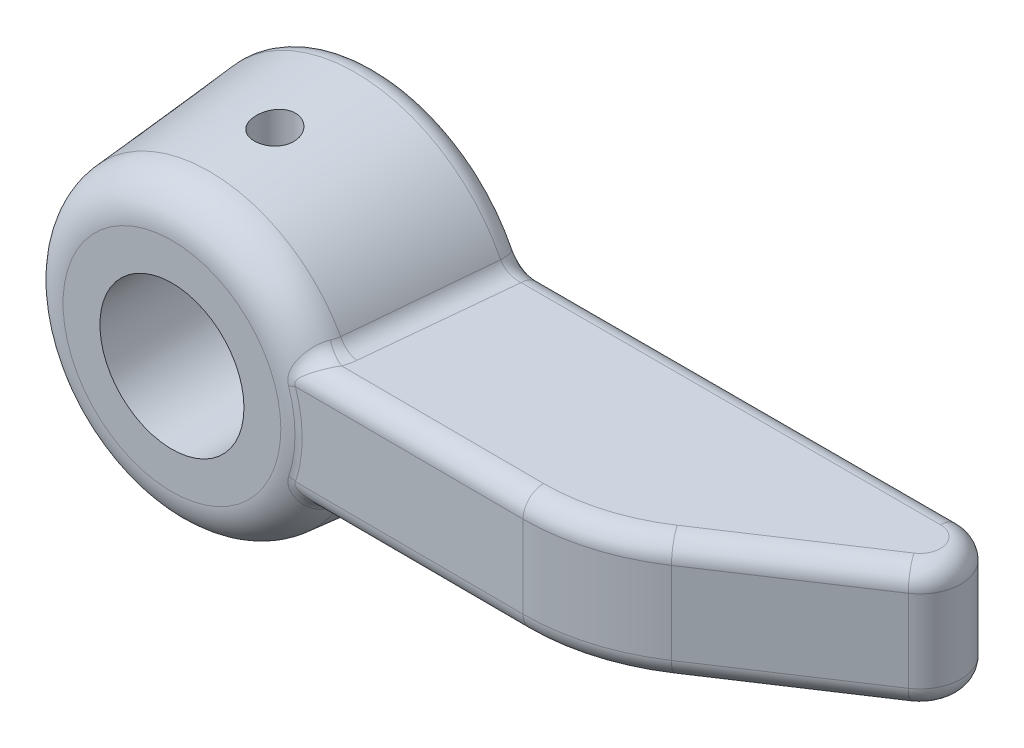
ISO-10303-21;
HEADER;
FILE_DESCRIPTION(('STEP AP214'),'2;1');
FILE_NAME('part.step','',(''),(''),'','','');
FILE_SCHEMA(('AUTOMOTIVE_DESIGN { 1 0 10303 214 1 1 1 1 }'));
ENDSEC;
DATA;
#1=APPLICATION_CONTEXT('core data for automotive mechanical design processes');
#2=APPLICATION_PROTOCOL_DEFINITION('international standard','automotive_design',2000,#1);
#3=PRODUCT_CONTEXT('',#1,'mechanical');
#4=PRODUCT('Part','Part','',(#3));
#5=PRODUCT_RELATED_PRODUCT_CATEGORY('part','',(#4));
#6=PRODUCT_DEFINITION_FORMATION('','',#4);
#7=PRODUCT_DEFINITION_CONTEXT('part definition',#1,'design');
#8=PRODUCT_DEFINITION('design','',#6,#7);
#9=PRODUCT_DEFINITION_SHAPE('','',#8);
#10=(LENGTH_UNIT() NAMED_UNIT(*) SI_UNIT(.MILLI.,.METRE.));
#11=(NAMED_UNIT(*) PLANE_ANGLE_UNIT() SI_UNIT($,.RADIAN.));
#12=(NAMED_UNIT(*) SI_UNIT($,.STERADIAN.) SOLID_ANGLE_UNIT());
#13=UNCERTAINTY_MEASURE_WITH_UNIT(LENGTH_MEASURE(1.E-05),#10,'distance_accuracy_value','');
#14=(GEOMETRIC_REPRESENTATION_CONTEXT(3) GLOBAL_UNCERTAINTY_ASSIGNED_CONTEXT((#13)) GLOBAL_UNIT_ASSIGNED_CONTEXT((#10,
#11,#12)) REPRESENTATION_CONTEXT('',''));
#15=CARTESIAN_POINT('',(0.,0.,0.));
#16=DIRECTION('',(0.,0.,1.));
#17=DIRECTION('',(1.,0.,0.));
#18=AXIS2_PLACEMENT_3D('',#15,#16,#17);
#19=CARTESIAN_POINT('',(0.,-8.00000000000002,5.));
#20=DIRECTION('',(0.,1.,0.));
#21=DIRECTION('',(0.,0.,1.));
#22=AXIS2_PLACEMENT_3D('',#19,#20,#21);
#23=CYLINDRICAL_SURFACE('',#22,1.);
#24=CARTESIAN_POINT('',(0.,-3.5,5.99999999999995));
#25=CARTESIAN_POINT('',(0.0549774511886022,-3.49999934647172,5.99999903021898));
#26=CARTESIAN_POINT('',(0.109964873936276,-3.49869208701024,5.99545110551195));
#27=CARTESIAN_POINT('',(0.218345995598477,-3.4936045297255,5.97741786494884));
#28=CARTESIAN_POINT('',(0.271739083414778,-3.48982329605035,5.96392916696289));
#29=CARTESIAN_POINT('',(0.375352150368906,-3.48020345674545,5.92849598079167));
#30=CARTESIAN_POINT('',(0.425576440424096,-3.474367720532,5.90656328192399));
#31=CARTESIAN_POINT('',(0.521634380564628,-3.46124989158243,5.85491100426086));
#32=CARTESIAN_POINT('',(0.567467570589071,-3.45396764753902,5.82519061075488));
#33=CARTESIAN_POINT('',(0.654647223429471,-3.43852367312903,5.75798249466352));
#34=CARTESIAN_POINT('',(0.69586186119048,-3.4303452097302,5.72032762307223));
#35=CARTESIAN_POINT('',(0.771485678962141,-3.41413367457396,5.63867612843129));
#36=CARTESIAN_POINT('',(0.805893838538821,-3.40610062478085,5.5946785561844));
#37=CARTESIAN_POINT('',(0.86759895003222,-3.39091507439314,5.50050320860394));
#38=CARTESIAN_POINT('',(0.894739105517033,-3.38378351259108,5.45021900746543));
#39=CARTESIAN_POINT('',(0.940125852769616,-3.37145671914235,5.34556399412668));
#40=CARTESIAN_POINT('',(0.958374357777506,-3.36626107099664,5.29119406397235));
#41=CARTESIAN_POINT('',(0.98499216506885,-3.35856804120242,5.18138261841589));
#42=CARTESIAN_POINT('',(0.993602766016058,-3.35600489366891,5.12600431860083));
#43=CARTESIAN_POINT('',(1.00145333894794,-3.35367104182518,5.01453442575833));
#44=CARTESIAN_POINT('',(1.00069534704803,-3.35389973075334,4.9584429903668));
#45=CARTESIAN_POINT('',(0.990020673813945,-3.35706517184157,4.84906569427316));
#46=CARTESIAN_POINT('',(0.980401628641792,-3.35991391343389,4.79574782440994));
#47=CARTESIAN_POINT('',(0.952756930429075,-3.36785674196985,4.69151639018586));
#48=CARTESIAN_POINT('',(0.934730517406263,-3.37295103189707,4.64060304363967));
#49=CARTESIAN_POINT('',(0.890553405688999,-3.38488431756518,4.5418768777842));
#50=CARTESIAN_POINT('',(0.864302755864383,-3.39174458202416,4.49411146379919));
#51=CARTESIAN_POINT('',(0.804491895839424,-3.40642608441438,4.40356171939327));
#52=CARTESIAN_POINT('',(0.77093005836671,-3.41424753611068,4.36077850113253));
#53=CARTESIAN_POINT('',(0.695951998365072,-3.43033125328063,4.27971381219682));
#54=CARTESIAN_POINT('',(0.654287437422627,-3.43859902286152,4.24166276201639));
#55=CARTESIAN_POINT('',(0.565066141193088,-3.45438123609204,4.17303699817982));
#56=CARTESIAN_POINT('',(0.517509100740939,-3.46189564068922,4.14246267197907));
#57=CARTESIAN_POINT('',(0.417461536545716,-3.47538264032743,4.08953563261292));
#58=CARTESIAN_POINT('',(0.364944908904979,-3.48134637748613,4.0672298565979));
#59=CARTESIAN_POINT('',(0.256696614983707,-3.49099625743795,4.03183305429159));
#60=CARTESIAN_POINT('',(0.200965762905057,-3.49468297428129,4.01873970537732));
#61=CARTESIAN_POINT('',(0.0898331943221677,-3.49927437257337,4.00251335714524));
#62=CARTESIAN_POINT('',(0.0344806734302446,-3.50026636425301,3.99906765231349));
#63=CARTESIAN_POINT('',(-0.0760132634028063,-3.49961042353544,4.00136363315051));
#64=CARTESIAN_POINT('',(-0.131154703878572,-3.49796280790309,4.00710421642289));
#65=CARTESIAN_POINT('',(-0.23850931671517,-3.4922696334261,4.02735522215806));
#66=CARTESIAN_POINT('',(-0.290759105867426,-3.48827306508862,4.0416865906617));
#67=CARTESIAN_POINT('',(-0.39210434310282,-3.4783399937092,4.07850025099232));
#68=CARTESIAN_POINT('',(-0.441199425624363,-3.47240326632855,4.10098348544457));
#69=CARTESIAN_POINT('',(-0.536020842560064,-3.45904980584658,4.15401166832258));
#70=CARTESIAN_POINT('',(-0.581651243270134,-3.45160381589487,4.18472059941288));
#71=CARTESIAN_POINT('',(-0.667219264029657,-3.43608973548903,4.25312625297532));
#72=CARTESIAN_POINT('',(-0.707155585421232,-3.42802150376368,4.29082456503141));
#73=CARTESIAN_POINT('',(-0.781553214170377,-3.41184309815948,4.37360467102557));
#74=CARTESIAN_POINT('',(-0.815792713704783,-3.40374018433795,4.41888763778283));
#75=CARTESIAN_POINT('',(-0.87619765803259,-3.38869447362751,4.51473129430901));
#76=CARTESIAN_POINT('',(-0.902363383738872,-3.38175163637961,4.56529180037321));
#77=CARTESIAN_POINT('',(-0.945687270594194,-3.36989325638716,4.67004560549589));
#78=CARTESIAN_POINT('',(-0.962893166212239,-3.36496700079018,4.72421788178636));
#79=CARTESIAN_POINT('',(-0.987897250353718,-3.35771228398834,4.83485496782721));
#80=CARTESIAN_POINT('',(-0.995698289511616,-3.35538303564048,4.89131907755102));
#81=CARTESIAN_POINT('',(-1.00149012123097,-3.35365851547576,5.00264801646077));
#82=CARTESIAN_POINT('',(-0.999840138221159,-3.35415580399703,5.05749275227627));
#83=CARTESIAN_POINT('',(-0.987623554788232,-3.35777298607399,5.16608736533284));
#84=CARTESIAN_POINT('',(-0.977057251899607,-3.36089279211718,5.21983727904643));
#85=CARTESIAN_POINT('',(-0.947529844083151,-3.36933488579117,5.3241891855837));
#86=CARTESIAN_POINT('',(-0.928655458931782,-3.37463438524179,5.3748176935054));
#87=CARTESIAN_POINT('',(-0.883114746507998,-3.38683651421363,5.47222936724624));
#88=CARTESIAN_POINT('',(-0.856447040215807,-3.3937394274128,5.51901185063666));
#89=CARTESIAN_POINT('',(-0.795032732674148,-3.40865834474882,5.60909176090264));
#90=CARTESIAN_POINT('',(-0.760046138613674,-3.41670381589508,5.65222069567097));
#91=CARTESIAN_POINT('',(-0.683429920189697,-3.43284922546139,5.7321119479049));
#92=CARTESIAN_POINT('',(-0.641798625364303,-3.44094917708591,5.76887265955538));
#93=CARTESIAN_POINT('',(-0.551787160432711,-3.45653979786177,5.83591859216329));
#94=CARTESIAN_POINT('',(-0.503261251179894,-3.46400950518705,5.86601349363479));
#95=CARTESIAN_POINT('',(-0.401625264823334,-3.47725697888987,5.91757289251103));
#96=CARTESIAN_POINT('',(-0.348517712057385,-3.48303566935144,5.9390421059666));
#97=CARTESIAN_POINT('',(-0.246458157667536,-3.49163672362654,5.97042377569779));
#98=CARTESIAN_POINT('',(-0.19788150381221,-3.49474842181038,5.98148676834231));
#99=CARTESIAN_POINT('',(-0.0995391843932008,-3.49893021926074,5.99627482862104));
#100=CARTESIAN_POINT('',(-0.0497736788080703,-3.50000059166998,6.00000087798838));
#101=CARTESIAN_POINT('',(0.,-3.5,5.99999999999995));
#102=B_SPLINE_CURVE_WITH_KNOTS('',3,(#24,#25,#26,#27,#28,#29,#30,#31,#32,#33,#34,#35,#36,#37,
#38,#39,#40,#41,#42,#43,#44,#45,#46,#47,#48,#49,#50,#51,#52,#53,#54,#55,#56,#57,#58,#59,#60,#61,
#62,#63,#64,#65,#66,#67,#68,#69,#70,#71,#72,#73,#74,#75,#76,#77,#78,#79,#80,#81,#82,#83,#84,#85,
#86,#87,#88,#89,#90,#91,#92,#93,#94,#95,#96,#97,#98,#99,#100,#101),.UNSPECIFIED.,.T.,.F.,(4,2,2,
2,2,2,2,2,2,2,2,2,2,2,2,2,2,2,2,2,2,2,2,2,2,2,2,2,2,2,2,2,2,2,2,2,2,2,4),(0.,0.16474965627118,
0.329561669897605,0.494144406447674,0.658744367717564,0.827239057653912,0.995758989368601,
1.16766537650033,1.3395347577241,1.50699754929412,1.67442394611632,1.83642392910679,
1.99843855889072,2.16250401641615,2.32660602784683,2.49689250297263,2.66718780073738,
2.83843550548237,3.00964002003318,3.17522728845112,3.34079468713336,3.50302570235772,
3.66527548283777,3.83103762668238,3.99683751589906,4.16806052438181,4.33927757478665,
4.50957286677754,4.67981652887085,4.84363340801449,5.00744482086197,5.16958548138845,
5.33175484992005,5.49933828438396,5.6669639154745,5.83888989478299,6.01072174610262,
6.15989734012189,6.30905297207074),.UNSPECIFIED.);
#103=CARTESIAN_POINT('',(0.,-3.5,5.99999999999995));
#104=VERTEX_POINT('',#103);
#105=EDGE_CURVE('E35',#104,#104,#102,.T.);
#106=ORIENTED_EDGE('',*,*,#105,.T.);
#107=EDGE_LOOP('',(#106));
#108=FACE_BOUND('',#107,.T.);
#109=CARTESIAN_POINT('',(-0.720539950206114,-7.5890937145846,4.30658657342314));
#110=CARTESIAN_POINT('',(-0.759782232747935,-7.58178402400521,4.34736720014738));
#111=CARTESIAN_POINT('',(-0.79555679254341,-7.5741972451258,4.39148691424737));
#112=CARTESIAN_POINT('',(-0.859163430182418,-7.55899810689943,4.48516941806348));
#113=CARTESIAN_POINT('',(-0.886986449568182,-7.55138572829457,4.53473832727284));
#114=CARTESIAN_POINT('',(-0.933867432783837,-7.53663542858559,4.63792187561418));
#115=CARTESIAN_POINT('',(-0.95292716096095,-7.52949741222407,4.69153569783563));
#116=CARTESIAN_POINT('',(-0.981702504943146,-7.51611483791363,4.80130746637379));
#117=CARTESIAN_POINT('',(-0.991420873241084,-7.50987001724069,4.85746465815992));
#118=CARTESIAN_POINT('',(-1.00115802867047,-7.49860981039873,4.97040331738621));
#119=CARTESIAN_POINT('',(-1.00123326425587,-7.49358744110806,5.0271792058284));
#120=CARTESIAN_POINT('',(-0.991764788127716,-7.48488712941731,5.14002953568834));
#121=CARTESIAN_POINT('',(-0.982221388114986,-7.4812091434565,5.19610399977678));
#122=CARTESIAN_POINT('',(-0.953936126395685,-7.47524679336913,5.3051889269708));
#123=CARTESIAN_POINT('',(-0.935313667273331,-7.47294517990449,5.35822943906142));
#124=CARTESIAN_POINT('',(-0.889438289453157,-7.46953506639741,5.46047703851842));
#125=CARTESIAN_POINT('',(-0.862185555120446,-7.46842654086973,5.50968420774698));
#126=CARTESIAN_POINT('',(-0.799935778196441,-7.46716685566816,5.60267936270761));
#127=CARTESIAN_POINT('',(-0.764967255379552,-7.46701222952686,5.64648640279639));
#128=CARTESIAN_POINT('',(-0.688215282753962,-7.46734532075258,5.72765351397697));
#129=CARTESIAN_POINT('',(-0.646431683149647,-7.46783305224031,5.76501344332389));
#130=CARTESIAN_POINT('',(-0.557034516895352,-7.46912336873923,5.8323810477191));
#131=CARTESIAN_POINT('',(-0.509397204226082,-7.46992726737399,5.86235718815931));
#132=CARTESIAN_POINT('',(-0.409775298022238,-7.47153669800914,5.91390909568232));
#133=CARTESIAN_POINT('',(-0.357790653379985,-7.47234223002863,5.93548476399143));
#134=CARTESIAN_POINT('',(-0.250800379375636,-7.47370610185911,5.96967060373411));
#135=CARTESIAN_POINT('',(-0.195787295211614,-7.47426379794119,5.9822574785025));
#136=CARTESIAN_POINT('',(-0.0844263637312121,-7.47497216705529,5.99801530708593));
#137=CARTESIAN_POINT('',(-0.0280785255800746,-7.47512284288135,6.00118632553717));
#138=CARTESIAN_POINT('',(0.0842986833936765,-7.47497663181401,5.99802334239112));
#139=CARTESIAN_POINT('',(0.140328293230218,-7.47468014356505,5.99169780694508));
#140=CARTESIAN_POINT('',(0.250529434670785,-7.47372079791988,5.96973795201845));
#141=CARTESIAN_POINT('',(0.304700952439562,-7.47305793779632,5.95410356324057));
#142=CARTESIAN_POINT('',(0.40965812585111,-7.47155675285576,5.91396793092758));
#143=CARTESIAN_POINT('',(0.460443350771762,-7.47071840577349,5.88946556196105));
#144=CARTESIAN_POINT('',(0.557185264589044,-7.46914334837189,5.83228703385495));
#145=CARTESIAN_POINT('',(0.603141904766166,-7.46840663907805,5.79961079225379));
#146=CARTESIAN_POINT('',(0.688957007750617,-7.46736151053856,5.7269803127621));
#147=CARTESIAN_POINT('',(0.728810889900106,-7.46705341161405,5.6870206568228));
#148=CARTESIAN_POINT('',(0.801242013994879,-7.46720042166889,5.60097705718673));
#149=CARTESIAN_POINT('',(0.833819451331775,-7.46765551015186,5.55489327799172));
#150=CARTESIAN_POINT('',(0.890679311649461,-7.46961800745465,5.45807466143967));
#151=CARTESIAN_POINT('',(0.914986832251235,-7.47112218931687,5.40735449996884));
#152=CARTESIAN_POINT('',(0.954759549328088,-7.47538258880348,5.30260920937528));
#153=CARTESIAN_POINT('',(0.970225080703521,-7.4781387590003,5.248584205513));
#154=CARTESIAN_POINT('',(0.991859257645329,-7.48497105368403,5.13900461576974));
#155=CARTESIAN_POINT('',(0.998063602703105,-7.48904203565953,5.08345674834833));
#156=CARTESIAN_POINT('',(1.00116154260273,-7.49844778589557,4.97221028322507));
#157=CARTESIAN_POINT('',(0.998054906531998,-7.5037825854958,4.91651168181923));
#158=CARTESIAN_POINT('',(0.982636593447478,-7.51554596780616,4.80624969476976));
#159=CARTESIAN_POINT('',(0.970280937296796,-7.5219796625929,4.75169301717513));
#160=CARTESIAN_POINT('',(0.936705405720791,-7.53559842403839,4.64547774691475));
#161=CARTESIAN_POINT('',(0.915484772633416,-7.54278355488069,4.59381940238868));
#162=CARTESIAN_POINT('',(0.864450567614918,-7.55758176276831,4.49413306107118));
#163=CARTESIAN_POINT('',(0.83452834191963,-7.56519920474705,4.44616131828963));
#164=CARTESIAN_POINT('',(0.767026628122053,-7.58027628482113,4.35591477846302));
#165=CARTESIAN_POINT('',(0.72944667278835,-7.5877359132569,4.31364032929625));
#166=CARTESIAN_POINT('',(0.647381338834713,-7.60202016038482,4.23572369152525));
#167=CARTESIAN_POINT('',(0.602854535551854,-7.60884054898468,4.20012430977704));
#168=CARTESIAN_POINT('',(0.508287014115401,-7.62128219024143,4.13693718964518));
#169=CARTESIAN_POINT('',(0.458246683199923,-7.62690352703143,4.10934888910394));
#170=CARTESIAN_POINT('',(0.354704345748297,-7.63644572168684,4.06332762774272));
#171=CARTESIAN_POINT('',(0.30125212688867,-7.64038652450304,4.04478688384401));
#172=CARTESIAN_POINT('',(0.191890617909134,-7.646349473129,4.01696384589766));
#173=CARTESIAN_POINT('',(0.135981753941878,-7.6483719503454,4.00767995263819));
#174=CARTESIAN_POINT('',(0.0245118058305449,-7.65031269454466,3.99876966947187));
#175=CARTESIAN_POINT('',(-0.0310332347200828,-7.65027291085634,3.99895074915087));
#176=CARTESIAN_POINT('',(-0.141302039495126,-7.64819634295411,4.00848794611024));
#177=CARTESIAN_POINT('',(-0.196025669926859,-7.64615923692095,4.01784554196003));
#178=CARTESIAN_POINT('',(-0.302764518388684,-7.6402669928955,4.04535079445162));
#179=CARTESIAN_POINT('',(-0.354793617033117,-7.63642247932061,4.06344709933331));
#180=CARTESIAN_POINT('',(-0.455035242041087,-7.62721412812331,4.10784373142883));
#181=CARTESIAN_POINT('',(-0.503251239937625,-7.62185169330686,4.13413648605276));
#182=CARTESIAN_POINT('',(-0.580112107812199,-7.61188562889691,4.18460756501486));
#183=CARTESIAN_POINT('',(-0.610114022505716,-7.60758076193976,4.20681161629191));
#184=CARTESIAN_POINT('',(-0.667423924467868,-7.59858845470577,4.25439119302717));
#185=CARTESIAN_POINT('',(-0.694731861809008,-7.59390100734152,4.27976677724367));
#186=CARTESIAN_POINT('',(-0.720539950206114,-7.5890937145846,4.30658657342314));
#187=B_SPLINE_CURVE_WITH_KNOTS('',3,(#109,#110,#111,#112,#113,#114,#115,#116,#117,#118,#119,
#120,#121,#122,#123,#124,#125,#126,#127,#128,#129,#130,#131,#132,#133,#134,#135,#136,#137,#138,
#139,#140,#141,#142,#143,#144,#145,#146,#147,#148,#149,#150,#151,#152,#153,#154,#155,#156,#157,
#158,#159,#160,#161,#162,#163,#164,#165,#166,#167,#168,#169,#170,#171,#172,#173,#174,#175,#176,
#177,#178,#179,#180,#181,#182,#183,#184,#185,#186),.UNSPECIFIED.,.T.,.F.,(4,2,2,2,2,2,2,2,2,2,2,
2,2,2,2,2,2,2,2,2,2,2,2,2,2,2,2,2,2,2,2,2,2,2,2,2,2,2,4),(0.,0.171059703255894,
0.342313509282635,0.513532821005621,0.684701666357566,0.854868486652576,1.02502979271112,
1.19301125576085,1.36098913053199,1.52835621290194,1.69572697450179,1.86380060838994,
2.03187621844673,2.20038587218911,2.36889436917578,2.53725273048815,2.70561234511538,
2.87399333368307,3.04237602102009,3.21088448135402,3.37938841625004,3.54737631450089,
3.71535784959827,3.88269017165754,4.05002664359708,4.2181638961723,4.38631552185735,
4.55666424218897,4.72702335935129,4.89844017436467,5.06984495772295,5.23915467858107,
5.40843514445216,5.57427358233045,5.74013874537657,5.90504087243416,6.06979109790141,
6.18228817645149,6.29478733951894),.UNSPECIFIED.);
#188=CARTESIAN_POINT('',(-0.720539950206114,-7.5890937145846,4.30658657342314));
#189=VERTEX_POINT('',#188);
#190=EDGE_CURVE('E465',#189,#189,#187,.T.);
#191=ORIENTED_EDGE('',*,*,#190,.F.);
#192=EDGE_LOOP('',(#191));
#193=FACE_BOUND('',#192,.T.);
#194=ADVANCED_FACE('F30',(#108,#193),#23,.F.);
#195=CARTESIAN_POINT('',(0.,0.,0.));
#196=DIRECTION('',(0.,0.,-1.));
#197=DIRECTION('',(1.,0.,0.));
#198=AXIS2_PLACEMENT_3D('',#195,#196,#197);
#199=CONICAL_SURFACE('',#198,8.,0.0872664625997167);
#200=ORIENTED_EDGE('',*,*,#190,.T.);
#201=EDGE_LOOP('',(#200));
#202=FACE_BOUND('',#201,.T.);
#203=CARTESIAN_POINT('',(-0.720539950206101,7.5890937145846,4.30658657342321));
#204=CARTESIAN_POINT('',(-0.68185408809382,7.59629897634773,4.26639013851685));
#205=CARTESIAN_POINT('',(-0.639752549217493,7.60324343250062,4.22938981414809));
#206=CARTESIAN_POINT('',(-0.549832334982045,7.61611083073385,4.16285155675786));
#207=CARTESIAN_POINT('',(-0.502008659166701,7.62203286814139,4.13332022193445));
#208=CARTESIAN_POINT('',(-0.401933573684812,7.63240669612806,4.08261463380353));
#209=CARTESIAN_POINT('',(-0.349680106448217,7.63685779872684,4.06144429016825));
#210=CARTESIAN_POINT('',(-0.24225771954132,7.64393272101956,4.0281605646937));
#211=CARTESIAN_POINT('',(-0.18708962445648,7.64655705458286,4.01604463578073));
#212=CARTESIAN_POINT('',(-0.0762695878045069,7.64974304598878,4.00137053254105));
#213=CARTESIAN_POINT('',(-0.0206368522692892,7.65033462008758,3.99867372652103));
#214=CARTESIAN_POINT('',(0.0902895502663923,7.64949138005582,4.00253951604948));
#215=CARTESIAN_POINT('',(0.145583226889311,7.64805662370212,4.00910184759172));
#216=CARTESIAN_POINT('',(0.253725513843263,7.64329839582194,4.03116531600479));
#217=CARTESIAN_POINT('',(0.306592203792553,7.63999278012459,4.04658196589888));
#218=CARTESIAN_POINT('',(0.408976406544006,7.63176011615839,4.08580951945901));
#219=CARTESIAN_POINT('',(0.458493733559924,7.62683297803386,4.10962088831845));
#220=CARTESIAN_POINT('',(0.553428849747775,7.61565521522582,4.16526661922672));
#221=CARTESIAN_POINT('',(0.598790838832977,7.60938953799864,4.19719308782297));
#222=CARTESIAN_POINT('',(0.683558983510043,7.59602277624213,4.26801737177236));
#223=CARTESIAN_POINT('',(0.722964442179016,7.58892159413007,4.30691600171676));
#224=CARTESIAN_POINT('',(0.795531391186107,7.57422300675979,4.39148051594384));
#225=CARTESIAN_POINT('',(0.828550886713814,7.56661848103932,4.43726708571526));
#226=CARTESIAN_POINT('',(0.886442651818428,7.55155605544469,4.53375421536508));
#227=CARTESIAN_POINT('',(0.911314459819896,7.54409816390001,4.5844550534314));
#228=CARTESIAN_POINT('',(0.952364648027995,7.5297367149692,4.68980369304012));
#229=CARTESIAN_POINT('',(0.968473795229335,7.52283792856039,4.74447916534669));
#230=CARTESIAN_POINT('',(0.991192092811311,7.51004755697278,4.85588399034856));
#231=CARTESIAN_POINT('',(0.997801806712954,7.50415591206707,4.91261322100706));
#232=CARTESIAN_POINT('',(1.00125440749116,7.49369241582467,5.0259494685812));
#233=CARTESIAN_POINT('',(0.998188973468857,7.48910862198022,5.08255257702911));
#234=CARTESIAN_POINT('',(0.98252582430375,7.48129970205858,5.19451941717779));
#235=CARTESIAN_POINT('',(0.969928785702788,7.47807447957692,5.24988323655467));
#236=CARTESIAN_POINT('',(0.935742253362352,7.47297572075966,5.35709150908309));
#237=CARTESIAN_POINT('',(0.914262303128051,7.47108645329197,5.4089701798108));
#238=CARTESIAN_POINT('',(0.862920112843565,7.46843068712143,5.50842976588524));
#239=CARTESIAN_POINT('',(0.833057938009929,7.46766417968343,5.5560107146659));
#240=CARTESIAN_POINT('',(0.76585948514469,7.46698972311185,5.64543137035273));
#241=CARTESIAN_POINT('',(0.728537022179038,7.46708020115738,5.68728145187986));
#242=CARTESIAN_POINT('',(0.647435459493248,7.46779670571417,5.76416600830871));
#243=CARTESIAN_POINT('',(0.603656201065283,7.46842274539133,5.79920031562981));
#244=CARTESIAN_POINT('',(0.510658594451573,7.46988504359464,5.86161352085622));
#245=CARTESIAN_POINT('',(0.461416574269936,7.47072223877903,5.888957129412));
#246=CARTESIAN_POINT('',(0.359045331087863,7.47230782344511,5.9350062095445));
#247=CARTESIAN_POINT('',(0.305916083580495,7.47305621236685,5.95371162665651));
#248=CARTESIAN_POINT('',(0.197169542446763,7.47424216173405,5.98198072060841));
#249=CARTESIAN_POINT('',(0.141547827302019,7.47467914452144,5.99152741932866));
#250=CARTESIAN_POINT('',(0.0294896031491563,7.47511954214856,6.00114570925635));
#251=CARTESIAN_POINT('',(-0.0269469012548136,7.47512295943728,6.00121735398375));
#252=CARTESIAN_POINT('',(-0.138971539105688,7.47469555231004,5.99188853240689));
#253=CARTESIAN_POINT('',(-0.19456047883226,7.47426517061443,5.98249772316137));
#254=CARTESIAN_POINT('',(-0.303372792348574,7.47308914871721,5.95452640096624));
#255=CARTESIAN_POINT('',(-0.356596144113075,7.47234350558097,5.93594580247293));
#256=CARTESIAN_POINT('',(-0.459195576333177,7.47075880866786,5.89011111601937));
#257=CARTESIAN_POINT('',(-0.50856983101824,7.46991971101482,5.86285294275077));
#258=CARTESIAN_POINT('',(-0.602047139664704,7.46844631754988,5.80043595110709));
#259=CARTESIAN_POINT('',(-0.646150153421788,7.46781202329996,5.76527707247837));
#260=CARTESIAN_POINT('',(-0.727848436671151,7.46708242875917,5.6880390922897));
#261=CARTESIAN_POINT('',(-0.765441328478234,7.46698732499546,5.64595747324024));
#262=CARTESIAN_POINT('',(-0.83302531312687,7.46766206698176,5.55608428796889));
#263=CARTESIAN_POINT('',(-0.863016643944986,7.46843188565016,5.50829290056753));
#264=CARTESIAN_POINT('',(-0.914446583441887,7.47109979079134,5.40856287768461));
#265=CARTESIAN_POINT('',(-0.935916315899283,7.4729937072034,5.35664018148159));
#266=CARTESIAN_POINT('',(-0.969862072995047,7.47807257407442,5.24999705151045));
#267=CARTESIAN_POINT('',(-0.982338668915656,7.48125744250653,5.19527679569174));
#268=CARTESIAN_POINT('',(-0.997955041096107,7.48894238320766,5.08478900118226));
#269=CARTESIAN_POINT('',(-1.00112399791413,7.49343829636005,5.02902528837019));
#270=CARTESIAN_POINT('',(-0.998170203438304,7.5036450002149,4.91784565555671));
#271=CARTESIAN_POINT('',(-0.992045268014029,7.50935607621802,4.8624298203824));
#272=CARTESIAN_POINT('',(-0.970654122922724,7.52179478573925,4.75310786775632));
#273=CARTESIAN_POINT('',(-0.955324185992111,7.52852925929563,4.69921504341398));
#274=CARTESIAN_POINT('',(-0.915944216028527,7.5426198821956,4.59484262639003));
#275=CARTESIAN_POINT('',(-0.891901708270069,7.54997549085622,4.54436013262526));
#276=CARTESIAN_POINT('',(-0.84384754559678,7.56272508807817,4.4619462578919));
#277=CARTESIAN_POINT('',(-0.821801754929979,7.56807711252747,4.42884463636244));
#278=CARTESIAN_POINT('',(-0.773928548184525,7.57869478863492,4.36548343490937));
#279=CARTESIAN_POINT('',(-0.748101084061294,7.58396043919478,4.33522389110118));
#280=CARTESIAN_POINT('',(-0.720539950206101,7.5890937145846,4.30658657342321));
#281=B_SPLINE_CURVE_WITH_KNOTS('',3,(#203,#204,#205,#206,#207,#208,#209,#210,#211,#212,#213,
#214,#215,#216,#217,#218,#219,#220,#221,#222,#223,#224,#225,#226,#227,#228,#229,#230,#231,#232,
#233,#234,#235,#236,#237,#238,#239,#240,#241,#242,#243,#244,#245,#246,#247,#248,#249,#250,#251,
#252,#253,#254,#255,#256,#257,#258,#259,#260,#261,#262,#263,#264,#265,#266,#267,#268,#269,#270,
#271,#272,#273,#274,#275,#276,#277,#278,#279,#280),.UNSPECIFIED.,.T.,.F.,(4,2,2,2,2,2,2,2,2,2,2,
2,2,2,2,2,2,2,2,2,2,2,2,2,2,2,2,2,2,2,2,2,2,2,2,2,2,2,4),(0.,0.168613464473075,
0.337375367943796,0.506216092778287,0.675009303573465,0.841307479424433,1.00760091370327,
1.17233334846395,1.33707491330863,1.50377701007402,1.67049859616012,1.84058343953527,
2.01067791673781,2.18209746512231,2.35350684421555,2.52329688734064,2.6930748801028,
2.86081882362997,3.02856146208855,3.19599630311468,3.36343526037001,3.53163043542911,
3.69982667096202,3.86833410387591,4.03684058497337,4.20517526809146,4.37351151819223,
4.54192713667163,4.71034403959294,4.87882232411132,5.04729533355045,5.21514723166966,
5.38298846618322,5.55030293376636,5.71765672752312,5.88618270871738,6.05456347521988,
6.17468795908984,6.29481396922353),.UNSPECIFIED.);
#282=CARTESIAN_POINT('',(-0.720539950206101,7.5890937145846,4.30658657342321));
#283=VERTEX_POINT('',#282);
#284=EDGE_CURVE('E463',#283,#283,#281,.T.);
#285=ORIENTED_EDGE('',*,*,#284,.T.);
#286=EDGE_LOOP('',(#285));
#287=FACE_BOUND('',#286,.T.);
#288=CARTESIAN_POINT('',(0.,0.,1.08715574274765));
#289=DIRECTION('',(0.,0.,1.));
#290=DIRECTION('',(1.,0.,0.));
#291=AXIS2_PLACEMENT_3D('',#288,#289,#290);
#292=CIRCLE('',#291,7.90488619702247);
#293=CARTESIAN_POINT('',(7.06174219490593,3.55232641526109,1.08715574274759));
#294=VERTEX_POINT('',#293);
#295=CARTESIAN_POINT('',(7.06174219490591,-3.55232641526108,1.08715574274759));
#296=VERTEX_POINT('',#295);
#297=EDGE_CURVE('E194',#294,#296,#292,.T.);
#298=ORIENTED_EDGE('',*,*,#297,.T.);
#299=CARTESIAN_POINT('',(7.82949854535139,-3.58524401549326,-6.98754565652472));
#300=CARTESIAN_POINT('',(8.09503185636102,-3.00000000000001,-6.96199470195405));
#301=CARTESIAN_POINT('',(8.73524759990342,-3.,-6.90038991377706));
#302=CARTESIAN_POINT('',(7.59061850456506,-3.57567970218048,-4.46016223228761));
#303=CARTESIAN_POINT('',(7.85989752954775,-3.,-4.44209608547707));
#304=CARTESIAN_POINT('',(8.49196466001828,-3.,-4.37300648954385));
#305=CARTESIAN_POINT('',(7.35057841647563,-3.56549269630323,-1.9329290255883));
#306=CARTESIAN_POINT('',(7.62308624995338,-3.,-1.9160296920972));
#307=CARTESIAN_POINT('',(8.24709803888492,-3.,-1.84577328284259));
#308=CARTESIAN_POINT('',(6.86726116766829,-3.5434785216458,3.12107267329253));
#309=CARTESIAN_POINT('',(7.14580528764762,-3.,3.13865035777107));
#310=CARTESIAN_POINT('',(7.75278621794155,-3.,3.20822841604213));
#311=CARTESIAN_POINT('',(6.62398402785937,-3.53165136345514,5.64784116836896));
#312=CARTESIAN_POINT('',(6.90561105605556,-3.00000000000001,5.6646205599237));
#313=CARTESIAN_POINT('',(7.50334104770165,-3.,5.73499691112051));
#314=CARTESIAN_POINT('',(6.13327173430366,-3.50596194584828,10.700791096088));
#315=CARTESIAN_POINT('',(6.42049525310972,-3.00000000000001,10.718725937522));
#316=CARTESIAN_POINT('',(6.99845687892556,-3.,10.7879468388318));
#317=CARTESIAN_POINT('',(5.88583656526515,-3.49209967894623,13.226972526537));
#318=CARTESIAN_POINT('',(6.17591808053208,-3.,13.2436775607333));
#319=CARTESIAN_POINT('',(6.7430178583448,-3.,13.314128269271));
#320=CARTESIAN_POINT('',(5.51040561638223,-3.4693399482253,17.0156040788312));
#321=CARTESIAN_POINT('',(5.8030471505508,-3.,17.0426882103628));
#322=CARTESIAN_POINT('',(6.35354431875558,-3.,17.1027598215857));
#323=CARTESIAN_POINT('',(5.38454852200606,-3.46142562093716,18.2783785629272));
#324=CARTESIAN_POINT('',(5.67830514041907,-3.,18.3054808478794));
#325=CARTESIAN_POINT('',(6.22266687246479,-3.,18.3655343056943));
#326=CARTESIAN_POINT('',(5.13111096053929,-3.4448430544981,20.803659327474));
#327=CARTESIAN_POINT('',(5.42677955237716,-3.,20.8314121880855));
#328=CARTESIAN_POINT('',(5.95833560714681,-3.,20.8908150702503));
#329=CARTESIAN_POINT('',(5.00353049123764,-3.43617481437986,22.0661656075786));
#330=CARTESIAN_POINT('',(5.30006239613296,-3.,22.0939912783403));
#331=CARTESIAN_POINT('',(5.8248817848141,-3.,22.1533213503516));
#332=CARTESIAN_POINT('',(4.87493971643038,-3.42708038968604,23.3285101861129));
#333=CARTESIAN_POINT('',(5.17178202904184,-3.00000000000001,23.3602557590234));
#334=CARTESIAN_POINT('',(5.68990413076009,-3.,23.4156659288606));
#335=(BOUNDED_SURFACE() B_SPLINE_SURFACE(3,2,((#299,#300,#301),(#302,#303,#304),(#305,#306,
#307),(#308,#309,#310),(#311,#312,#313),(#314,#315,#316),(#317,#318,#319),(#320,#321,#322),
(#323,#324,#325),(#326,#327,#328),(#329,#330,#331),(#332,#333,#334)),.UNSPECIFIED.,.F.,.F.,
.F.) B_SPLINE_SURFACE_WITH_KNOTS((4,2,2,2,2,4),(3,3),(0.,7.61719913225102,15.2343490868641,
22.8515270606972,26.6601405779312,30.4687589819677),(0.,1.),
.UNSPECIFIED.) GEOMETRIC_REPRESENTATION_ITEM() RATIONAL_B_SPLINE_SURFACE(((1.,0.841057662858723,
1.),(1.,0.843899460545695,1.),(1.,0.846914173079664,1.),(1.,0.85338838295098,1.),(1.,
0.856847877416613,1.),(1.,0.864310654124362,1.),(1.,0.868313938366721,1.),(1.,0.874834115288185,
1.),(1.,0.877093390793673,1.),(1.,0.88180721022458,1.),(1.,0.884261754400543,1.),(1.,
0.886825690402,1.))) REPRESENTATION_ITEM('') SURFACE());
#336=CARTESIAN_POINT('',(7.82949854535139,-3.58524401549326,-6.98754565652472));
#337=CARTESIAN_POINT('',(7.59061850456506,-3.57567970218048,-4.46016223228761));
#338=CARTESIAN_POINT('',(7.35057841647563,-3.56549269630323,-1.9329290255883));
#339=CARTESIAN_POINT('',(6.86726116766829,-3.5434785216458,3.12107267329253));
#340=CARTESIAN_POINT('',(6.62398402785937,-3.53165136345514,5.64784116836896));
#341=CARTESIAN_POINT('',(6.13327173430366,-3.50596194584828,10.700791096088));
#342=CARTESIAN_POINT('',(5.88583656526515,-3.49209967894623,13.226972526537));
#343=CARTESIAN_POINT('',(5.51040561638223,-3.4693399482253,17.0156040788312));
#344=CARTESIAN_POINT('',(5.38454852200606,-3.46142562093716,18.2783785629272));
#345=CARTESIAN_POINT('',(5.13111096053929,-3.4448430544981,20.803659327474));
#346=CARTESIAN_POINT('',(5.00353049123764,-3.43617481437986,22.0661656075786));
#347=CARTESIAN_POINT('',(4.87493971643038,-3.42708038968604,23.3285101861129));
#348=B_SPLINE_CURVE_WITH_KNOTS('',3,(#336,#337,#338,#339,#340,#341,#342,#343,#344,#345,#346,
#347),.UNSPECIFIED.,.F.,.F.,(4,2,2,2,2,4),(0.,7.61719913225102,15.2343490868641,
22.8515270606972,26.6601405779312,30.4687589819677),.UNSPECIFIED.);
#349=CARTESIAN_POINT('',(6.37862833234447,-3.5188066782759,8.17431148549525));
#350=VERTEX_POINT('',#349);
#351=EDGE_CURVE('E59',#296,#350,#348,.T.);
#352=ORIENTED_EDGE('',*,*,#351,.T.);
#353=CARTESIAN_POINT('',(0.,0.,8.17431148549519));
#354=DIRECTION('',(0.,0.,-1.));
#355=DIRECTION('',(-1.,0.,0.));
#356=AXIS2_PLACEMENT_3D('',#353,#354,#355);
#357=CIRCLE('',#356,7.2848404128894);
#358=CARTESIAN_POINT('',(6.37862833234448,3.51880667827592,8.1743114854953));
#359=VERTEX_POINT('',#358);
#360=EDGE_CURVE('E159',#350,#359,#357,.T.);
#361=ORIENTED_EDGE('',*,*,#360,.T.);
#362=CARTESIAN_POINT('',(6.14226530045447,3.50614424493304,10.601200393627));
#363=CARTESIAN_POINT('',(6.42828132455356,3.00000000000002,10.630013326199));
#364=CARTESIAN_POINT('',(7.00743023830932,3.00000000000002,10.6883561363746));
#365=CARTESIAN_POINT('',(6.18177469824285,3.50831022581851,10.1967356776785));
#366=CARTESIAN_POINT('',(6.46738865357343,3.00000000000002,10.225167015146));
#367=CARTESIAN_POINT('',(7.04817618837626,3.00000000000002,10.2838914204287));
#368=CARTESIAN_POINT('',(6.22122410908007,3.51044757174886,9.79226216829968));
#369=CARTESIAN_POINT('',(6.50640096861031,3.00000000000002,9.82061802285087));
#370=CARTESIAN_POINT('',(7.08883479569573,3.00000000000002,9.87941791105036));
#371=CARTESIAN_POINT('',(6.30000957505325,3.51466753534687,8.98329883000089));
#372=CARTESIAN_POINT('',(6.5843046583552,3.00000000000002,9.01149184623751));
#373=CARTESIAN_POINT('',(7.16998772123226,3.00000000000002,9.07045457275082));
#374=CARTESIAN_POINT('',(6.3393456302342,3.51675015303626,8.57880900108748));
#375=CARTESIAN_POINT('',(6.62319454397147,3.00000000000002,8.60692830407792));
#376=CARTESIAN_POINT('',(7.21048203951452,3.00000000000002,8.66596474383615));
#377=CARTESIAN_POINT('',(6.623986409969,3.53165164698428,5.6478372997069));
#378=CARTESIAN_POINT('',(6.90561550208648,3.00000000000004,5.66461084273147));
#379=CARTESIAN_POINT('',(7.50334470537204,3.00000000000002,5.73499304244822));
#380=CARTESIAN_POINT('',(6.86726307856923,3.54347869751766,3.12106324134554));
#381=CARTESIAN_POINT('',(7.14580823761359,3.00000000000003,3.1386379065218));
#382=CARTESIAN_POINT('',(7.75278878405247,3.00000000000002,3.20821898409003));
#383=CARTESIAN_POINT('',(7.35057841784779,3.56549260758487,-1.93293958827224));
#384=CARTESIAN_POINT('',(7.62308515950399,3.00000000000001,-1.91603707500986));
#385=CARTESIAN_POINT('',(8.24709742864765,3.00000000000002,-1.84578384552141));
#386=CARTESIAN_POINT('',(7.59061708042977,3.57567946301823,-4.46016836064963));
#387=CARTESIAN_POINT('',(7.85989391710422,3.,-4.44209574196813));
#388=CARTESIAN_POINT('',(8.49196198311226,3.00000000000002,-4.37301261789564));
#389=CARTESIAN_POINT('',(7.82949854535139,3.58524401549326,-6.98754565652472));
#390=CARTESIAN_POINT('',(8.09503185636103,3.00000000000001,-6.96199470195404));
#391=CARTESIAN_POINT('',(8.73524759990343,3.00000000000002,-6.90038991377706));
#392=(BOUNDED_SURFACE() B_SPLINE_SURFACE(3,2,((#362,#363,#364),(#365,#366,#367),(#368,#369,
#370),(#371,#372,#373),(#374,#375,#376),(#377,#378,#379),(#380,#381,#382),(#383,#384,#385),
(#386,#387,#388),(#389,#390,#391)),.UNSPECIFIED.,.F.,.F.,.F.) B_SPLINE_SURFACE_WITH_KNOTS((4,2,
2,2,4),(3,3),(0.,1.21953573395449,2.43907098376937,10.0562360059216,17.6734200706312),(0.,1.),
.UNSPECIFIED.) GEOMETRIC_REPRESENTATION_ITEM() RATIONAL_B_SPLINE_SURFACE(((1.,0.864249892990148,
1.),(1.,0.863623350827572,1.),(1.,0.863004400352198,1.),(1.,0.861781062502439,1.),(1.,
0.861176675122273,1.),(1.,0.856847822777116,1.),(1.,0.853388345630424,1.),(1.,0.846914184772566,
1.),(1.,0.843899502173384,1.),(1.,0.841057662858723,1.))) REPRESENTATION_ITEM('') SURFACE());
#393=CARTESIAN_POINT('',(6.14226530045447,3.50614424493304,10.601200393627));
#394=CARTESIAN_POINT('',(6.18177469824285,3.50831022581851,10.1967356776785));
#395=CARTESIAN_POINT('',(6.22122410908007,3.51044757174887,9.79226216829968));
#396=CARTESIAN_POINT('',(6.30000957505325,3.51466753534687,8.98329883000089));
#397=CARTESIAN_POINT('',(6.3393456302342,3.51675015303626,8.57880900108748));
#398=CARTESIAN_POINT('',(6.623986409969,3.53165164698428,5.6478372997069));
#399=CARTESIAN_POINT('',(6.86726307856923,3.54347869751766,3.12106324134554));
#400=CARTESIAN_POINT('',(7.35057841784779,3.56549260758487,-1.93293958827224));
#401=CARTESIAN_POINT('',(7.59061708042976,3.57567946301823,-4.46016836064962));
#402=CARTESIAN_POINT('',(7.82949854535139,3.58524401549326,-6.98754565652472));
#403=B_SPLINE_CURVE_WITH_KNOTS('',3,(#393,#394,#395,#396,#397,#398,#399,#400,#401,#402),
.UNSPECIFIED.,.F.,.F.,(4,2,2,2,4),(0.,1.21953573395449,2.43907098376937,10.0562360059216,
17.6734200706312),.UNSPECIFIED.);
#404=EDGE_CURVE('E163',#359,#294,#403,.T.);
#405=ORIENTED_EDGE('',*,*,#404,.T.);
#406=EDGE_LOOP('',(#298,#352,#361,#405));
#407=FACE_BOUND('',#406,.T.);
#408=ADVANCED_FACE('F161',(#202,#287,#407),#199,.T.);
#409=CARTESIAN_POINT('',(0.,0.,9.99999999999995));
#410=DIRECTION('',(0.,0.,1.));
#411=DIRECTION('',(1.,0.,0.));
#412=AXIS2_PLACEMENT_3D('',#409,#410,#411);
#413=PLANE('',#412);
#414=CARTESIAN_POINT('',(0.,0.,9.99999999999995));
#415=DIRECTION('',(0.,0.,1.));
#416=DIRECTION('',(1.,0.,0.));
#417=AXIS2_PLACEMENT_3D('',#414,#415,#416);
#418=CIRCLE('',#417,3.5);
#419=CARTESIAN_POINT('',(3.49999999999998,0.,9.99999999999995));
#420=VERTEX_POINT('',#419);
#421=EDGE_CURVE('E484',#420,#420,#418,.T.);
#422=ORIENTED_EDGE('',*,*,#421,.F.);
#423=EDGE_LOOP('',(#422));
#424=FACE_BOUND('',#423,.T.);
#425=CARTESIAN_POINT('',(0.,0.,9.99999999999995));
#426=DIRECTION('',(0.,0.,1.));
#427=DIRECTION('',(1.,0.,0.));
#428=AXIS2_PLACEMENT_3D('',#425,#426,#427);
#429=CIRCLE('',#428,5.29245101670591);
#430=CARTESIAN_POINT('',(5.2924510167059,0.,9.99999999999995));
#431=VERTEX_POINT('',#430);
#432=EDGE_CURVE('E166',#431,#431,#429,.T.);
#433=ORIENTED_EDGE('',*,*,#432,.T.);
#434=EDGE_LOOP('',(#433));
#435=FACE_BOUND('',#434,.T.);
#436=ADVANCED_FACE('F441',(#424,#435),#413,.T.);
#437=CARTESIAN_POINT('',(0.,0.,0.));
#438=DIRECTION('',(0.,0.,1.));
#439=DIRECTION('',(1.,0.,0.));
#440=AXIS2_PLACEMENT_3D('',#437,#438,#439);
#441=PLANE('',#440);
#442=CARTESIAN_POINT('',(0.,0.,0.));
#443=DIRECTION('',(0.,0.,1.));
#444=DIRECTION('',(1.,0.,0.));
#445=AXIS2_PLACEMENT_3D('',#442,#443,#444);
#446=CIRCLE('',#445,3.5);
#447=CARTESIAN_POINT('',(3.50000000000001,0.,0.));
#448=VERTEX_POINT('',#447);
#449=EDGE_CURVE('E480',#448,#448,#446,.T.);
#450=ORIENTED_EDGE('',*,*,#449,.T.);
#451=EDGE_LOOP('',(#450));
#452=FACE_BOUND('',#451,.T.);
#453=DIRECTION('',(-1.,0.,0.));
#454=VECTOR('',#453,1.);
#455=CARTESIAN_POINT('',(0.,-2.,0.));
#456=LINE('',#455,#454);
#457=CARTESIAN_POINT('',(28.3505049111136,-2.,0.));
#458=VERTEX_POINT('',#457);
#459=CARTESIAN_POINT('',(7.96874906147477,-2.,0.));
#460=VERTEX_POINT('',#459);
#461=EDGE_CURVE('E694',#458,#460,#456,.T.);
#462=ORIENTED_EDGE('',*,*,#461,.T.);
#463=CARTESIAN_POINT('',(8.30570120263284,-3.05678926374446,0.967643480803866));
#464=CARTESIAN_POINT('',(8.31606323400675,-3.02722748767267,0.));
#465=CARTESIAN_POINT('',(8.63631637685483,-2.11357925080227,0.));
#466=CARTESIAN_POINT('',(8.25167277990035,-3.03797967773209,0.972830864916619));
#467=CARTESIAN_POINT('',(8.25856936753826,-3.01236176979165,0.));
#468=CARTESIAN_POINT('',(8.52927508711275,-2.07595970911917,0.));
#469=CARTESIAN_POINT('',(8.19602972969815,-3.02378013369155,0.978173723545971));
#470=CARTESIAN_POINT('',(8.20034001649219,-3.00283418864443,0.));
#471=CARTESIAN_POINT('',(8.41903486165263,-2.04756038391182,0.));
#472=CARTESIAN_POINT('',(8.0831740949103,-3.00479571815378,0.989011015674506));
#473=CARTESIAN_POINT('',(8.08396586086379,-2.99389358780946,0.));
#474=CARTESIAN_POINT('',(8.19544501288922,-2.00959131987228,0.));
#475=CARTESIAN_POINT('',(8.02596281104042,-3.00000327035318,0.994505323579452));
#476=CARTESIAN_POINT('',(8.02580954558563,-2.99452563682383,0.));
#477=CARTESIAN_POINT('',(8.08209796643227,-2.0000064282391,0.));
#478=CARTESIAN_POINT('',(7.91151160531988,-2.99999672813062,1.00549754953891));
#479=CARTESIAN_POINT('',(7.91135033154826,-3.00550741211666,0.));
#480=CARTESIAN_POINT('',(7.85534753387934,-1.99999356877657,0.));
#481=CARTESIAN_POINT('',(7.85427168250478,-3.00478708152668,1.01099546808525));
#482=CARTESIAN_POINT('',(7.8550561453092,-3.01591563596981,0.));
#483=CARTESIAN_POINT('',(7.74194414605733,-2.00957449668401,0.));
#484=CARTESIAN_POINT('',(7.74142000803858,-3.023807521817,1.02183583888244));
#485=CARTESIAN_POINT('',(7.74593231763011,-3.04566294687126,0.));
#486=CARTESIAN_POINT('',(7.51836288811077,-2.04761471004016,0.));
#487=CARTESIAN_POINT('',(7.68580807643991,-3.03803656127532,1.02717830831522));
#488=CARTESIAN_POINT('',(7.69312753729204,-3.06504886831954,0.));
#489=CARTESIAN_POINT('',(7.40818466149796,-2.07607190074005,0.));
#490=CARTESIAN_POINT('',(7.57777622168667,-3.07554786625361,1.03755726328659));
#491=CARTESIAN_POINT('',(7.59230461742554,-3.11176014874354,0.));
#492=CARTESIAN_POINT('',(7.19415339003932,-2.151094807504,0.));
#493=CARTESIAN_POINT('',(7.52535683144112,-3.09883163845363,1.04259369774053));
#494=CARTESIAN_POINT('',(7.54432704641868,-3.13912318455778,0.));
#495=CARTESIAN_POINT('',(7.09030140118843,-2.19766353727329,0.));
#496=CARTESIAN_POINT('',(7.42522046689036,-3.1538038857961,1.05221559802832));
#497=CARTESIAN_POINT('',(7.45421204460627,-3.20062291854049,0.));
#498=CARTESIAN_POINT('',(6.89191202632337,-2.30760751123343,0.));
#499=CARTESIAN_POINT('',(7.37750335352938,-3.18549211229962,1.05680107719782));
#500=CARTESIAN_POINT('',(7.41212375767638,-3.23478036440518,0.));
#501=CARTESIAN_POINT('',(6.79737436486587,-2.37098225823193,0.));
#502=CARTESIAN_POINT('',(7.28824433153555,-3.25630925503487,1.06537884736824));
#503=CARTESIAN_POINT('',(7.33463368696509,-3.30856928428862,0.));
#504=CARTESIAN_POINT('',(6.62053646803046,-2.51261665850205,0.));
#505=CARTESIAN_POINT('',(7.24668919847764,-3.29542181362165,1.06937240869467));
#506=CARTESIAN_POINT('',(7.29927017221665,-3.34819265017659,0.));
#507=CARTESIAN_POINT('',(6.53821002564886,-2.59084358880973,0.));
#508=CARTESIAN_POINT('',(7.17082774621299,-3.38003248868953,1.07666366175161));
#509=CARTESIAN_POINT('',(7.23559803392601,-3.431759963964,0.));
#510=CARTESIAN_POINT('',(6.38791422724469,-2.7600650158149,0.));
#511=CARTESIAN_POINT('',(7.1365218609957,-3.42553098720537,1.0799613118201));
#512=CARTESIAN_POINT('',(7.20734096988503,-3.47569066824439,0.));
#513=CARTESIAN_POINT('',(6.31994573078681,-2.85106027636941,0.));
#514=CARTESIAN_POINT('',(7.07633428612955,-3.52137965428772,1.08574661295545));
#515=CARTESIAN_POINT('',(7.15830268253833,-3.56649391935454,0.));
#516=CARTESIAN_POINT('',(6.2007033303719,-3.04275718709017,0.));
#517=CARTESIAN_POINT('',(7.05041076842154,-3.57170405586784,1.08823828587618));
#518=CARTESIAN_POINT('',(7.13752765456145,-3.61332268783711,0.));
#519=CARTESIAN_POINT('',(6.14934653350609,-3.14340728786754,0.));
#520=CARTESIAN_POINT('',(7.00743246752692,-3.67599646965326,1.09236947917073));
#521=CARTESIAN_POINT('',(7.10335667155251,-3.7091660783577,0.));
#522=CARTESIAN_POINT('',(6.06420106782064,-3.35199376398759,0.));
#523=CARTESIAN_POINT('',(6.99038647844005,-3.72996803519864,1.09400815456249));
#524=CARTESIAN_POINT('',(7.09000090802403,-3.75814277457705,0.));
#525=CARTESIAN_POINT('',(6.03042981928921,-3.45993724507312,0.));
#526=CARTESIAN_POINT('',(6.97814650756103,-3.78501121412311,1.09518531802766));
#527=CARTESIAN_POINT('',(7.08039141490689,-3.80762670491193,-1.0993810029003E-13));
#528=CARTESIAN_POINT('',(6.0061753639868,-3.57002148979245,0.));
#529=(BOUNDED_SURFACE() B_SPLINE_SURFACE(3,2,((#463,#464,#465),(#466,#467,#468),(#469,#470,
#471),(#472,#473,#474),(#475,#476,#477),(#478,#479,#480),(#481,#482,#483),(#484,#485,#486),
(#487,#488,#489),(#490,#491,#492),(#493,#494,#495),(#496,#497,#498),(#499,#500,#501),(#502,#503,
#504),(#505,#506,#507),(#508,#509,#510),(#511,#512,#513),(#514,#515,#516),(#517,#518,#519),
(#520,#521,#522),(#523,#524,#525),(#526,#527,#528)),.UNSPECIFIED.,.F.,.F.,
.F.) B_SPLINE_SURFACE_WITH_KNOTS((4,2,2,2,2,2,2,2,2,2,4),(3,3),(0.,0.339923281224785,
0.679572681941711,1.01937976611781,1.35914914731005,1.69897508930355,2.03879097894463,
2.37786668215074,2.71696267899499,3.05433949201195,3.39204987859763),(0.,1.),
.UNSPECIFIED.) GEOMETRIC_REPRESENTATION_ITEM() RATIONAL_B_SPLINE_SURFACE(((1.,0.718455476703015,
1.),(1.,0.716650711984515,1.),(1.,0.714784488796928,1.),(1.,0.710983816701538,1.),(1.,
0.709049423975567,1.),(1.,0.705163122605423,1.),(1.,0.703211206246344,1.),(1.,0.699346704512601,
1.),(1.,0.697434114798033,1.),(1.,0.693703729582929,1.),(1.,0.691885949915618,1.),(1.,
0.688400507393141,1.),(1.,0.686732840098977,1.),(1.,0.683603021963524,1.),(1.,0.682140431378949,
1.),(1.,0.679463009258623,1.),(1.,0.67824819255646,1.),(1.,0.676112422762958,1.),(1.,
0.675190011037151,1.),(1.,0.673658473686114,1.),(1.,0.673049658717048,1.),(1.,0.672612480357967,1.))) REPRESENTATION_ITEM('') SURFACE());
#530=CARTESIAN_POINT('',(6.0061753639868,-3.57002148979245,0.));
#531=CARTESIAN_POINT('',(6.03042981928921,-3.45993724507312,0.));
#532=CARTESIAN_POINT('',(6.06420106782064,-3.35199376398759,0.));
#533=CARTESIAN_POINT('',(6.14934653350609,-3.14340728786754,0.));
#534=CARTESIAN_POINT('',(6.2007033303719,-3.04275718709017,0.));
#535=CARTESIAN_POINT('',(6.31994573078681,-2.85106027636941,0.));
#536=CARTESIAN_POINT('',(6.38791422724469,-2.7600650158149,0.));
#537=CARTESIAN_POINT('',(6.53821002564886,-2.59084358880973,0.));
#538=CARTESIAN_POINT('',(6.62053646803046,-2.51261665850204,0.));
#539=CARTESIAN_POINT('',(6.79737436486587,-2.37098225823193,0.));
#540=CARTESIAN_POINT('',(6.89191202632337,-2.30760751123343,0.));
#541=CARTESIAN_POINT('',(7.09030140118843,-2.19766353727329,0.));
#542=CARTESIAN_POINT('',(7.19415339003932,-2.151094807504,0.));
#543=CARTESIAN_POINT('',(7.40818466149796,-2.07607190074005,0.));
#544=CARTESIAN_POINT('',(7.51836288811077,-2.04761471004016,0.));
#545=CARTESIAN_POINT('',(7.74194414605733,-2.00957449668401,0.));
#546=CARTESIAN_POINT('',(7.85534753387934,-1.99999356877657,0.));
#547=CARTESIAN_POINT('',(8.08209796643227,-2.0000064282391,0.));
#548=CARTESIAN_POINT('',(8.19544501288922,-2.00959131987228,0.));
#549=CARTESIAN_POINT('',(8.41903486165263,-2.04756038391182,0.));
#550=CARTESIAN_POINT('',(8.52927508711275,-2.07595970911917,0.));
#551=CARTESIAN_POINT('',(8.63631637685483,-2.11357925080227,0.));
#552=B_SPLINE_CURVE_WITH_KNOTS('',3,(#530,#531,#532,#533,#534,#535,#536,#537,#538,#539,#540,
#541,#542,#543,#544,#545,#546,#547,#548,#549,#550,#551),.UNSPECIFIED.,.F.,.F.,(4,2,2,2,2,2,2,2,
2,2,4),(0.,0.33771038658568,0.675087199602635,1.01418319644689,1.35325889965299,
1.69307478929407,2.03290073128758,2.37267011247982,2.71247719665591,3.05212659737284,
3.39204987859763),.UNSPECIFIED.);
#553=CARTESIAN_POINT('',(6.17180273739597,-3.10465283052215,0.));
#554=VERTEX_POINT('',#553);
#555=EDGE_CURVE('E44',#460,#554,#552,.F.);
#556=ORIENTED_EDGE('',*,*,#555,.T.);
#557=CARTESIAN_POINT('',(0.,0.,0.));
#558=DIRECTION('',(0.,0.,1.));
#559=DIRECTION('',(1.,0.,0.));
#560=AXIS2_PLACEMENT_3D('',#557,#558,#559);
#561=CIRCLE('',#560,6.90869149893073);
#562=CARTESIAN_POINT('',(6.17180273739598,3.10465283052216,-1.11022302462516E-13));
#563=VERTEX_POINT('',#562);
#564=EDGE_CURVE('E179',#554,#563,#561,.F.);
#565=ORIENTED_EDGE('',*,*,#564,.T.);
#566=CARTESIAN_POINT('',(6.96283629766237,3.87150972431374,1.09665657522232));
#567=CARTESIAN_POINT('',(7.06843759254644,3.88525733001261,0.));
#568=CARTESIAN_POINT('',(5.97584229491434,3.74301883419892,0.));
#569=CARTESIAN_POINT('',(6.9700794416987,3.81602517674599,1.09595969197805));
#570=CARTESIAN_POINT('',(7.07411945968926,3.83565539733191,0.));
#571=CARTESIAN_POINT('',(5.99019796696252,3.63205162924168,0.));
#572=CARTESIAN_POINT('',(6.98213462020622,3.76117856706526,1.09480077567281));
#573=CARTESIAN_POINT('',(7.08348294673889,3.78634624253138,0.));
#574=CARTESIAN_POINT('',(6.01408149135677,3.52235797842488,0.));
#575=CARTESIAN_POINT('',(7.01529820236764,3.65429348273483,1.09161302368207));
#576=CARTESIAN_POINT('',(7.10958989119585,3.689293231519,0.));
#577=CARTESIAN_POINT('',(6.07978178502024,3.30858612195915,0.));
#578=CARTESIAN_POINT('',(7.03639819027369,3.60225244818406,1.08958499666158));
#579=CARTESIAN_POINT('',(7.12630108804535,3.64159161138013,0.));
#580=CARTESIAN_POINT('',(6.12158188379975,3.20450279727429,0.));
#581=CARTESIAN_POINT('',(7.087292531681,3.50201530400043,1.08469279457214));
#582=CARTESIAN_POINT('',(7.16721023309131,3.54830086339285,0.));
#583=CARTESIAN_POINT('',(6.22241282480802,3.00402898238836,0.));
#584=CARTESIAN_POINT('',(7.11715300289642,3.4538521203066,1.08182226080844));
#585=CARTESIAN_POINT('',(7.19142741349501,3.50276506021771,0.));
#586=CARTESIAN_POINT('',(6.28157470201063,2.90770436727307,0.));
#587=CARTESIAN_POINT('',(7.18461637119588,3.36318692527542,1.07533784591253));
#588=CARTESIAN_POINT('',(7.24711754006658,3.41531250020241,0.));
#589=CARTESIAN_POINT('',(6.41523234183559,2.72637372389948,0.));
#590=CARTESIAN_POINT('',(7.22221873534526,3.32068452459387,1.07172401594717));
#591=CARTESIAN_POINT('',(7.27854265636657,3.37341719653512,-1.14820991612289E-13));
#592=CARTESIAN_POINT('',(6.48972704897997,2.64136691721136,0.));
#593=CARTESIAN_POINT('',(7.30407975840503,3.24253553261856,1.06385673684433));
#594=CARTESIAN_POINT('',(7.34829675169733,3.29444760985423,-1.05509261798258E-13));
#595=CARTESIAN_POINT('',(6.65190799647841,2.48506888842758,0.));
#596=CARTESIAN_POINT('',(7.3483373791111,3.20688787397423,1.05960338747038));
#597=CARTESIAN_POINT('',(7.38657271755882,3.25737830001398,0.));
#598=CARTESIAN_POINT('',(6.73959217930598,2.41377553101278,0.));
#599=CARTESIAN_POINT('',(7.4422488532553,3.14342789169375,1.05057897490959));
#600=CARTESIAN_POINT('',(7.46942688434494,3.18928187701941,0.));
#601=CARTESIAN_POINT('',(6.92564887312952,2.28685600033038,0.));
#602=CARTESIAN_POINT('',(7.4919028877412,3.11561583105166,1.04580789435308));
#603=CARTESIAN_POINT('',(7.51395418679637,3.15824364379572,0.));
#604=CARTESIAN_POINT('',(7.02402174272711,2.2312303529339,0.));
#605=CARTESIAN_POINT('',(7.59537241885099,3.06851640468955,1.03586648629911));
#606=CARTESIAN_POINT('',(7.60859291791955,3.10333996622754,0.));
#607=CARTESIAN_POINT('',(7.22901388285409,2.13703120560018,0.));
#608=CARTESIAN_POINT('',(7.64920118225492,3.04925764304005,1.03069488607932));
#609=CARTESIAN_POINT('',(7.6586780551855,3.07947035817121,0.));
#610=CARTESIAN_POINT('',(7.33565944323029,2.09851492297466,0.));
#611=CARTESIAN_POINT('',(7.75935886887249,3.01992376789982,1.0201124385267));
#612=CARTESIAN_POINT('',(7.76312655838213,3.04014618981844,0.));
#613=CARTESIAN_POINT('',(7.55390331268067,2.03984789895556,0.));
#614=CARTESIAN_POINT('',(7.81568813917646,3.00984993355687,1.01470155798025));
#615=CARTESIAN_POINT('',(7.81745708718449,3.02465123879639,0.));
#616=CARTESIAN_POINT('',(7.66550230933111,2.01969971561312,0.));
#617=CARTESIAN_POINT('',(7.92943243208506,2.99916392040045,1.00377631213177));
#618=CARTESIAN_POINT('',(7.9291158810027,3.00298784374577,0.));
#619=CARTESIAN_POINT('',(7.89085188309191,1.99832737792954,0.));
#620=CARTESIAN_POINT('',(7.98685032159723,2.9985817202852,0.998261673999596));
#621=CARTESIAN_POINT('',(7.98643618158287,2.99679761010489,0.));
#622=CARTESIAN_POINT('',(8.00460814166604,1.99716318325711,0.));
#623=CARTESIAN_POINT('',(8.10102169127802,3.00692003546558,0.98729709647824));
#624=CARTESIAN_POINT('',(8.1021785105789,2.99441237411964,0.));
#625=CARTESIAN_POINT('',(8.2308045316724,2.01384032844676,0.));
#626=CARTESIAN_POINT('',(8.15777461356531,3.01584802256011,0.981847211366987));
#627=CARTESIAN_POINT('',(8.16060237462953,2.99817089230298,0.));
#628=CARTESIAN_POINT('',(8.34324355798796,2.03169661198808,0.));
#629=CARTESIAN_POINT('',(8.21335970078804,3.02951364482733,0.976509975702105));
#630=CARTESIAN_POINT('',(8.21886798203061,3.00724070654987,0.));
#631=CARTESIAN_POINT('',(8.45336882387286,2.05902790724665,0.));
#632=(BOUNDED_SURFACE() B_SPLINE_SURFACE(3,2,((#566,#567,#568),(#569,#570,#571),(#572,#573,
#574),(#575,#576,#577),(#578,#579,#580),(#581,#582,#583),(#584,#585,#586),(#587,#588,#589),
(#590,#591,#592),(#593,#594,#595),(#596,#597,#598),(#599,#600,#601),(#602,#603,#604),(#605,#606,
#607),(#608,#609,#610),(#611,#612,#613),(#614,#615,#616),(#617,#618,#619),(#620,#621,#622),
(#623,#624,#625),(#626,#627,#628),(#629,#630,#631)),.UNSPECIFIED.,.F.,.F.,
.F.) B_SPLINE_SURFACE_WITH_KNOTS((4,2,2,2,2,2,2,2,2,2,4),(3,3),(0.,0.335224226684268,
0.670137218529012,1.00764593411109,1.34513142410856,1.68256432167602,2.02000854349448,
2.35857290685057,2.69718441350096,3.03686519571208,3.37681304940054),(0.,1.),
.UNSPECIFIED.) GEOMETRIC_REPRESENTATION_ITEM() RATIONAL_B_SPLINE_SURFACE(((1.,0.672065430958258,
1.),(1.,0.672324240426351,1.),(1.,0.672755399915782,1.),(1.,0.67393914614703,1.),(1.,
0.674691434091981,1.),(1.,0.676501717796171,1.),(1.,0.677562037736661,1.),(1.,0.679950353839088,
1.),(1.,0.681278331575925,1.),(1.,0.684159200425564,1.),(1.,0.685712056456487,1.),(1.,
0.688994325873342,1.),(1.,0.690723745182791,1.),(1.,0.694312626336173,1.),(1.,0.696172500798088,
1.),(1.,0.699962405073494,1.),(1.,0.701892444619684,1.),(1.,0.70577304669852,1.),(1.,
0.707723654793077,1.),(1.,0.71158646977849,1.),(1.,0.713498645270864,1.),(1.,0.715363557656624,1.))) REPRESENTATION_ITEM('') SURFACE());
#633=CARTESIAN_POINT('',(8.45336882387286,2.05902790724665,0.));
#634=CARTESIAN_POINT('',(8.34324355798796,2.03169661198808,0.));
#635=CARTESIAN_POINT('',(8.2308045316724,2.01384032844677,0.));
#636=CARTESIAN_POINT('',(8.00460814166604,1.99716318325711,0.));
#637=CARTESIAN_POINT('',(7.89085188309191,1.99832737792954,0.));
#638=CARTESIAN_POINT('',(7.66550230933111,2.01969971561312,0.));
#639=CARTESIAN_POINT('',(7.55390331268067,2.03984789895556,0.));
#640=CARTESIAN_POINT('',(7.33565944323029,2.09851492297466,0.));
#641=CARTESIAN_POINT('',(7.22901388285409,2.13703120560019,0.));
#642=CARTESIAN_POINT('',(7.02402174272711,2.2312303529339,0.));
#643=CARTESIAN_POINT('',(6.92564887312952,2.28685600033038,0.));
#644=CARTESIAN_POINT('',(6.73959217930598,2.41377553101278,0.));
#645=CARTESIAN_POINT('',(6.65190799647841,2.48506888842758,0.));
#646=CARTESIAN_POINT('',(6.48972704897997,2.64136691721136,0.));
#647=CARTESIAN_POINT('',(6.41523234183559,2.72637372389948,0.));
#648=CARTESIAN_POINT('',(6.28157470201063,2.90770436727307,0.));
#649=CARTESIAN_POINT('',(6.22241282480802,3.00402898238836,0.));
#650=CARTESIAN_POINT('',(6.12158188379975,3.20450279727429,0.));
#651=CARTESIAN_POINT('',(6.07978178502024,3.30858612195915,0.));
#652=CARTESIAN_POINT('',(6.01408149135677,3.52235797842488,0.));
#653=CARTESIAN_POINT('',(5.99019796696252,3.63205162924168,0.));
#654=CARTESIAN_POINT('',(5.97584229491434,3.74301883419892,0.));
#655=B_SPLINE_CURVE_WITH_KNOTS('',3,(#633,#634,#635,#636,#637,#638,#639,#640,#641,#642,#643,
#644,#645,#646,#647,#648,#649,#650,#651,#652,#653,#654),.UNSPECIFIED.,.F.,.F.,(4,2,2,2,2,2,2,2,
2,2,4),(0.,0.339947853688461,0.679628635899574,1.01824014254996,1.35680450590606,
1.69424872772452,2.03168162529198,2.36916711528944,2.70667583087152,3.04158882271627,
3.37681304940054),.UNSPECIFIED.);
#656=CARTESIAN_POINT('',(7.96874906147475,2.00000000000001,0.));
#657=VERTEX_POINT('',#656);
#658=EDGE_CURVE('E586',#657,#563,#655,.T.);
#659=ORIENTED_EDGE('',*,*,#658,.F.);
#660=DIRECTION('',(-1.,0.,0.));
#661=VECTOR('',#660,1.);
#662=CARTESIAN_POINT('',(28.3505049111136,2.00000000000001,0.));
#663=LINE('',#662,#661);
#664=CARTESIAN_POINT('',(28.3505049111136,2.00000000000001,0.));
#665=VERTEX_POINT('',#664);
#666=EDGE_CURVE('E196',#657,#665,#663,.F.);
#667=ORIENTED_EDGE('',*,*,#666,.T.);
#668=DIRECTION('',(0.,-1.,0.));
#669=VECTOR('',#668,1.);
#670=CARTESIAN_POINT('',(28.3505049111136,3.00000000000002,0.));
#671=LINE('',#670,#669);
#672=EDGE_CURVE('E713',#665,#458,#671,.T.);
#673=ORIENTED_EDGE('',*,*,#672,.T.);
#674=EDGE_LOOP('',(#462,#556,#565,#659,#667,#673));
#675=FACE_BOUND('',#674,.T.);
#676=ADVANCED_FACE('F579',(#452,#675),#441,.F.);
#677=CARTESIAN_POINT('',(0.,0.,7.99999999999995));
#678=DIRECTION('',(0.,0.,1.));
#679=DIRECTION('',(1.,0.,0.));
#680=AXIS2_PLACEMENT_3D('',#677,#678,#679);
#681=TOROIDAL_SURFACE('',#680,5.29245101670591,2.);
#682=CARTESIAN_POINT('',(6.34728637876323,-3.52276230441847,7.63753639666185));
#683=CARTESIAN_POINT('',(6.62508101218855,-3.00000000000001,7.57898749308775));
#684=CARTESIAN_POINT('',(7.20716963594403,-3.,7.4563045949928));
#685=CARTESIAN_POINT('',(6.36755811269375,-3.52020488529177,7.72665912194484));
#686=CARTESIAN_POINT('',(6.64897762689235,-3.,7.6821989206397));
#687=CARTESIAN_POINT('',(7.23545530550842,-3.,7.58998868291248));
#688=CARTESIAN_POINT('',(6.38026398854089,-3.51860316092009,7.81721322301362));
#689=CARTESIAN_POINT('',(6.66394073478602,-3.,7.7874763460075));
#690=CARTESIAN_POINT('',(7.25318608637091,-3.,7.72581983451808));
#691=CARTESIAN_POINT('',(6.39036324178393,-3.51732980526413,7.9968394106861));
#692=CARTESIAN_POINT('',(6.67582152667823,-3.,7.99629153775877));
#693=CARTESIAN_POINT('',(7.2672790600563,-3.,7.99525911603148));
#694=CARTESIAN_POINT('',(6.38812269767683,-3.51761203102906,8.08589374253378));
#695=CARTESIAN_POINT('',(6.6731853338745,-3.00000000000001,8.09993607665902));
#696=CARTESIAN_POINT('',(7.26415211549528,-3.,8.12884061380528));
#697=CARTESIAN_POINT('',(6.36781520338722,-3.52016726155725,8.27501041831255));
#698=CARTESIAN_POINT('',(6.64925408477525,-3.00000000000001,8.3196797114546));
#699=CARTESIAN_POINT('',(7.23580594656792,-3.,8.41251562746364));
#700=CARTESIAN_POINT('',(6.34759319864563,-3.52271133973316,8.37488363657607));
#701=CARTESIAN_POINT('',(6.62538038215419,-3.,8.43566874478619));
#702=CARTESIAN_POINT('',(7.20757844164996,-3.,8.56232545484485));
#703=CARTESIAN_POINT('',(6.30337385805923,-3.52834730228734,8.52249259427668));
#704=CARTESIAN_POINT('',(6.57340331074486,-3.,8.60628045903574));
#705=CARTESIAN_POINT('',(7.14596801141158,-3.,8.78373889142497));
#706=CARTESIAN_POINT('',(6.28596906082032,-3.53057445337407,8.57201318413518));
#707=CARTESIAN_POINT('',(6.5529353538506,-3.,8.66345892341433));
#708=CARTESIAN_POINT('',(7.12173193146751,-3.,8.85801977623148));
#709=CARTESIAN_POINT('',(6.24657843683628,-3.53565233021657,8.66946410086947));
#710=CARTESIAN_POINT('',(6.50669039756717,-3.,8.77568669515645));
#711=CARTESIAN_POINT('',(7.06694089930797,-3.,9.00419615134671));
#712=CARTESIAN_POINT('',(6.22459362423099,-3.53850291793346,8.71739477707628));
#713=CARTESIAN_POINT('',(6.48089539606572,-3.,8.83075698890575));
#714=CARTESIAN_POINT('',(7.03638734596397,-3.,9.07609216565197));
#715=CARTESIAN_POINT('',(6.20040146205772,-3.54166570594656,8.7643899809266));
#716=CARTESIAN_POINT('',(6.45258681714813,-3.00000000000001,8.88450857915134));
#717=CARTESIAN_POINT('',(7.00280825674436,-3.,9.14658497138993));
#718=(BOUNDED_SURFACE() B_SPLINE_SURFACE(3,2,((#682,#683,#684),(#685,#686,#687),(#688,#689,
#690),(#691,#692,#693),(#694,#695,#696),(#697,#698,#699),(#700,#701,#702),(#703,#704,#705),
(#706,#707,#708),(#709,#710,#711),(#712,#713,#714),(#715,#716,#717)),.UNSPECIFIED.,.F.,.F.,
.F.) B_SPLINE_SURFACE_WITH_KNOTS((4,2,2,2,2,4),(3,3),(0.,0.409363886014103,0.808738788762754,
1.26358670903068,1.4977404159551,1.73184232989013),(0.,1.),
.UNSPECIFIED.) GEOMETRIC_REPRESENTATION_ITEM() RATIONAL_B_SPLINE_SURFACE(((1.,0.85942937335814,
1.),(1.,0.860172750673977,1.),(1.,0.860638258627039,1.),(1.,0.861008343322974,1.),(1.,
0.860926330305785,1.),(1.,0.860183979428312,1.),(1.,0.859444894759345,1.),(1.,0.857803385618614,
1.),(1.,0.857154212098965,1.),(1.,0.855671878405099,1.),(1.,0.854838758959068,1.),(1.,
0.853912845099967,1.))) REPRESENTATION_ITEM('') SURFACE());
#719=CARTESIAN_POINT('',(6.34728637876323,-3.52276230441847,7.63753639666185));
#720=CARTESIAN_POINT('',(6.36755811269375,-3.52020488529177,7.72665912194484));
#721=CARTESIAN_POINT('',(6.38026398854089,-3.51860316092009,7.81721322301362));
#722=CARTESIAN_POINT('',(6.39036324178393,-3.51732980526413,7.99683941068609));
#723=CARTESIAN_POINT('',(6.38812269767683,-3.51761203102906,8.08589374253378));
#724=CARTESIAN_POINT('',(6.36781520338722,-3.52016726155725,8.27501041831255));
#725=CARTESIAN_POINT('',(6.34759319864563,-3.52271133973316,8.37488363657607));
#726=CARTESIAN_POINT('',(6.30337385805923,-3.52834730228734,8.52249259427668));
#727=CARTESIAN_POINT('',(6.28596906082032,-3.53057445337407,8.57201318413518));
#728=CARTESIAN_POINT('',(6.24657843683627,-3.53565233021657,8.66946410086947));
#729=CARTESIAN_POINT('',(6.22459362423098,-3.53850291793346,8.71739477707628));
#730=CARTESIAN_POINT('',(6.20040146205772,-3.54166570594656,8.7643899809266));
#731=B_SPLINE_CURVE_WITH_KNOTS('',3,(#719,#720,#721,#722,#723,#724,#725,#726,#727,#728,#729,
#730),.UNSPECIFIED.,.F.,.F.,(4,2,2,2,2,4),(0.,0.409363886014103,0.808738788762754,
1.26358670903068,1.4977404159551,1.73184232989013),.UNSPECIFIED.);
#732=CARTESIAN_POINT('',(6.28288549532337,-3.53097593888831,8.57799585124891));
#733=VERTEX_POINT('',#732);
#734=EDGE_CURVE('E51',#350,#733,#731,.T.);
#735=ORIENTED_EDGE('',*,*,#734,.T.);
#736=CARTESIAN_POINT('',(6.43736028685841,-3.41702055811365,8.13264430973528));
#737=CARTESIAN_POINT('',(6.69702424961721,-2.89166647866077,8.38778195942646));
#738=CARTESIAN_POINT('',(7.31729733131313,-2.94242046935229,8.53339390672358));
#739=CARTESIAN_POINT('',(6.4254508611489,-3.43433406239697,8.1688122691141));
#740=CARTESIAN_POINT('',(6.68536666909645,-2.90415784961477,8.40989572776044));
#741=CARTESIAN_POINT('',(7.30310069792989,-2.95205839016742,8.56049051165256));
#742=CARTESIAN_POINT('',(6.4133223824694,-3.4496877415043,8.2054286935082));
#743=CARTESIAN_POINT('',(6.67359594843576,-2.91580374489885,8.43235606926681));
#744=CARTESIAN_POINT('',(7.28833124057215,-2.96049097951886,8.58792227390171));
#745=CARTESIAN_POINT('',(6.388582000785,-3.47647442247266,8.27926215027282));
#746=CARTESIAN_POINT('',(6.64974148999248,-2.93738142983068,8.47801587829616));
#747=CARTESIAN_POINT('',(7.25756493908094,-2.97493117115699,8.64323369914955));
#748=CARTESIAN_POINT('',(6.37597025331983,-3.48790867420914,8.31647898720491));
#749=CARTESIAN_POINT('',(6.63766717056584,-2.94730955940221,8.50119697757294));
#750=CARTESIAN_POINT('',(7.2415684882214,-2.9809395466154,8.67111321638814));
#751=CARTESIAN_POINT('',(6.3374242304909,-3.51627652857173,8.42834932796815));
#752=CARTESIAN_POINT('',(6.60098249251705,-2.97441748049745,8.57165254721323));
#753=CARTESIAN_POINT('',(7.1917231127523,-2.99528011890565,8.75491277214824));
#754=CARTESIAN_POINT('',(6.31069331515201,-3.52740090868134,8.50348968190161));
#755=CARTESIAN_POINT('',(6.57578461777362,-2.98907898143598,8.62008033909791));
#756=CARTESIAN_POINT('',(7.15591620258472,-2.99999791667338,8.81119386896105));
#757=CARTESIAN_POINT('',(6.25299933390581,-3.53481816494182,8.6580705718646));
#758=CARTESIAN_POINT('',(6.521170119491,-3.01163490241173,8.72373206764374));
#759=CARTESIAN_POINT('',(7.07610725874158,-3.00000223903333,8.92696414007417));
#760=CARTESIAN_POINT('',(6.2218692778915,-3.52994040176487,8.73741276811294));
#761=CARTESIAN_POINT('',(6.49166840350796,-3.01899047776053,8.77903584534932));
#762=CARTESIAN_POINT('',(7.03169274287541,-2.99455752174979,8.9863786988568));
#763=CARTESIAN_POINT('',(6.15729424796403,-3.50395202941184,8.89206929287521));
#764=CARTESIAN_POINT('',(6.4292573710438,-3.02357216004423,8.89240235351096));
#765=CARTESIAN_POINT('',(6.93702367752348,-2.97356261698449,9.10217471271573));
#766=CARTESIAN_POINT('',(6.1238482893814,-3.48283447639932,8.96738188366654));
#767=CARTESIAN_POINT('',(6.39646122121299,-3.02090567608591,8.95029777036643));
#768=CARTESIAN_POINT('',(6.88676663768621,-2.95800810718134,9.15855485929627));
#769=CARTESIAN_POINT('',(6.0552193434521,-3.42600047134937,9.11157319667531));
#770=CARTESIAN_POINT('',(6.32718535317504,-3.00420644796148,9.06676889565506));
#771=CARTESIAN_POINT('',(6.78137080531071,-2.91794246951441,9.26647953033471));
#772=CARTESIAN_POINT('',(6.02004350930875,-3.39034031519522,9.18047548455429));
#773=CARTESIAN_POINT('',(6.29082424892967,-2.99038017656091,9.12523876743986));
#774=CARTESIAN_POINT('',(6.72625147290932,-2.8934659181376,9.31804176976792));
#775=CARTESIAN_POINT('',(5.94848048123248,-3.30596881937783,9.31069557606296));
#776=CARTESIAN_POINT('',(6.21443173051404,-2.95073198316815,9.24067477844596));
#777=CARTESIAN_POINT('',(6.61202548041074,-2.83670210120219,9.41546952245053));
#778=CARTESIAN_POINT('',(5.91209239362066,-3.25724765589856,9.37200761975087));
#779=CARTESIAN_POINT('',(6.17446997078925,-2.92507981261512,9.2976290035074));
#780=CARTESIAN_POINT('',(6.55291584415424,-2.80440895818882,9.46133070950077));
#781=CARTESIAN_POINT('',(5.83611070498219,-3.1436811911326,9.49054382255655));
#782=CARTESIAN_POINT('',(6.08835399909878,-2.8591570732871,9.41176218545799));
#783=CARTESIAN_POINT('',(6.42732396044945,-2.73023171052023,9.54997177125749));
#784=CARTESIAN_POINT('',(5.7964932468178,-3.07785873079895,9.54705014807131));
#785=CARTESIAN_POINT('',(6.04194269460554,-2.81803444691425,9.46875237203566));
#786=CARTESIAN_POINT('',(6.36062996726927,-2.68778751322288,9.59221282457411));
#787=CARTESIAN_POINT('',(5.73842119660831,-2.96953240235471,9.62352715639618));
#788=CARTESIAN_POINT('',(5.97139870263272,-2.74577193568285,9.54851664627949));
#789=CARTESIAN_POINT('',(6.26072444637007,-2.6190319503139,9.64936277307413));
#790=CARTESIAN_POINT('',(5.71928974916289,-2.93182534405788,9.64763884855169));
#791=CARTESIAN_POINT('',(5.94784312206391,-2.72007153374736,9.57404659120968));
#792=CARTESIAN_POINT('',(6.22744556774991,-2.59526552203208,9.66737731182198));
#793=CARTESIAN_POINT('',(5.68190546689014,-2.85310144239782,9.69304783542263));
#794=CARTESIAN_POINT('',(5.90103098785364,-2.66521847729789,9.62280060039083));
#795=CARTESIAN_POINT('',(6.16152998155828,-2.54605849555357,9.70129691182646));
#796=CARTESIAN_POINT('',(5.66365225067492,-2.81208605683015,9.7143463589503));
#797=CARTESIAN_POINT('',(5.87776182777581,-2.63607726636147,9.64605154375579));
#798=CARTESIAN_POINT('',(6.12889299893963,-2.52061863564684,9.7172028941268));
#799=CARTESIAN_POINT('',(5.62719860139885,-2.72290163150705,9.75571105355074));
#800=CARTESIAN_POINT('',(5.83041220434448,-2.57165136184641,9.69172983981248));
#801=CARTESIAN_POINT('',(6.06247969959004,-2.46582314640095,9.74808821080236));
#802=CARTESIAN_POINT('',(5.60913144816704,-2.67442108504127,9.77552334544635));
#803=CARTESIAN_POINT('',(5.80639086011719,-2.53604212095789,9.71397107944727));
#804=CARTESIAN_POINT('',(6.02883803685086,-2.4363181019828,9.76287741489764));
#805=CARTESIAN_POINT('',(5.57618387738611,-2.57257894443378,9.81157695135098));
#806=CARTESIAN_POINT('',(5.76133434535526,-2.46027495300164,9.75481966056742));
#807=CARTESIAN_POINT('',(5.96530030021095,-2.3751022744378,9.78978537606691));
#808=CARTESIAN_POINT('',(5.56130254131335,-2.51921876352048,9.82781929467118));
#809=CARTESIAN_POINT('',(5.74026167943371,-2.42010962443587,9.7734663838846));
#810=CARTESIAN_POINT('',(5.93540314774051,-2.34339213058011,9.80190490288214));
#811=CARTESIAN_POINT('',(5.54074611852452,-2.42221759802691,9.85240439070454));
#812=CARTESIAN_POINT('',(5.7093788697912,-2.34651835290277,9.80178982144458));
#813=CARTESIAN_POINT('',(5.89044478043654,-2.28664083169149,9.82025014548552));
#814=CARTESIAN_POINT('',(5.53366158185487,-2.38000290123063,9.86168770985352));
#815=CARTESIAN_POINT('',(5.69805752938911,-2.31434595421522,9.81252420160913));
#816=CARTESIAN_POINT('',(5.87357013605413,-2.26219876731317,9.82717751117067));
#817=CARTESIAN_POINT('',(5.52429682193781,-2.29214789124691,9.87793935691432));
#818=CARTESIAN_POINT('',(5.68084142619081,-2.24724000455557,9.83121047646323));
#819=CARTESIAN_POINT('',(5.84631284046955,-2.21200140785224,9.83930952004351));
#820=CARTESIAN_POINT('',(5.52200341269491,-2.2465173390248,9.88491399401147));
#821=CARTESIAN_POINT('',(5.67491145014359,-2.21229309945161,9.83918449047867));
#822=CARTESIAN_POINT('',(5.83591242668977,-2.18624991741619,9.84451885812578));
#823=CARTESIAN_POINT('',(5.52402005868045,-2.16394251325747,9.89481358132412));
#824=CARTESIAN_POINT('',(5.67160518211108,-2.1490931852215,9.85018952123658));
#825=CARTESIAN_POINT('',(5.82621320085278,-2.14033523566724,9.85192338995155));
#826=CARTESIAN_POINT('',(5.52683924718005,-2.12763591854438,9.89831325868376));
#827=CARTESIAN_POINT('',(5.67247148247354,-2.12130802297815,9.85395955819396));
#828=CARTESIAN_POINT('',(5.82480710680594,-2.12036245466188,9.85454523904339));
#829=CARTESIAN_POINT('',(5.53697150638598,-2.05433691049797,9.90368748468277));
#830=CARTESIAN_POINT('',(5.67962273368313,-2.06532999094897,9.8593475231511));
#831=CARTESIAN_POINT('',(5.82860870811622,-2.08048712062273,9.85858387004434));
#832=CARTESIAN_POINT('',(5.54427203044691,-2.01734669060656,9.90556653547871));
#833=CARTESIAN_POINT('',(5.68589322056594,-2.03711749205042,9.86097427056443));
#834=CARTESIAN_POINT('',(5.83379798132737,-2.06058452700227,9.86000399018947));
#835=CARTESIAN_POINT('',(5.56308617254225,-1.9440452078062,9.90775254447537));
#836=CARTESIAN_POINT('',(5.70364368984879,-1.98138537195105,9.86209269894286));
#837=CARTESIAN_POINT('',(5.85066504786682,-2.021536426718,9.86167867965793));
#838=CARTESIAN_POINT('',(5.57458133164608,-1.90773169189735,9.90806630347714));
#839=CARTESIAN_POINT('',(5.71510988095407,-1.95384167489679,9.86159324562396));
#840=CARTESIAN_POINT('',(5.86231452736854,-2.00238800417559,9.8619382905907));
#841=CARTESIAN_POINT('',(5.60095714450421,-1.83627799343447,9.90733871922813));
#842=CARTESIAN_POINT('',(5.74228943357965,-1.89984156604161,9.85870810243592));
#843=CARTESIAN_POINT('',(5.89101477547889,-1.96500521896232,9.86145243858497));
#844=CARTESIAN_POINT('',(5.61586426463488,-1.80114958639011,9.90628646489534));
#845=CARTESIAN_POINT('',(5.75805077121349,-1.87337779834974,9.85630406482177));
#846=CARTESIAN_POINT('',(5.90810820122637,-1.94677943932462,9.86069888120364));
#847=CARTESIAN_POINT('',(5.64728941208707,-1.73408281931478,9.90311230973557));
#848=CARTESIAN_POINT('',(5.79178422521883,-1.82305367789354,9.85003179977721));
#849=CARTESIAN_POINT('',(5.94538506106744,-1.91217782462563,9.85839596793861));
#850=CARTESIAN_POINT('',(5.66371728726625,-1.70207282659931,9.9010356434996));
#851=CARTESIAN_POINT('',(5.80965609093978,-1.79911749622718,9.84622243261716));
#852=CARTESIAN_POINT('',(5.9654145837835,-1.89575690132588,9.85688021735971));
#853=CARTESIAN_POINT('',(5.69796416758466,-1.63955972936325,9.89599445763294));
#854=CARTESIAN_POINT('',(5.84720720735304,-1.75255784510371,9.83734730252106));
#855=CARTESIAN_POINT('',(6.0079876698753,-1.86379970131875,9.85318806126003));
#856=CARTESIAN_POINT('',(5.7157859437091,-1.60905983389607,9.89302813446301));
#857=CARTESIAN_POINT('',(5.86690349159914,-1.72992873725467,9.83227390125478));
#858=CARTESIAN_POINT('',(6.03053628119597,-1.84826529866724,9.85101031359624));
#859=CARTESIAN_POINT('',(5.75180331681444,-1.55021900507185,9.88640644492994));
#860=CARTESIAN_POINT('',(5.90687953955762,-1.68646193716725,9.82117791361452));
#861=CARTESIAN_POINT('',(6.07670924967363,-1.81835284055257,9.84614027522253));
#862=CARTESIAN_POINT('',(5.7699769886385,-1.52184248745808,9.88277110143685));
#863=CARTESIAN_POINT('',(5.92714337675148,-1.66558535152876,9.81517798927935));
#864=CARTESIAN_POINT('',(6.10029012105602,-1.80395517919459,9.84346291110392));
#865=CARTESIAN_POINT('',(5.80675456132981,-1.46634618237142,9.87483797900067));
#866=CARTESIAN_POINT('',(5.96824141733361,-1.62494601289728,9.80225618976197));
#867=CARTESIAN_POINT('',(6.14846995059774,-1.77581888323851,9.83761347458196));
#868=CARTESIAN_POINT('',(5.82535599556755,-1.43922104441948,9.87054344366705));
#869=CARTESIAN_POINT('',(5.98908273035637,-1.60517344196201,9.79533331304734));
#870=CARTESIAN_POINT('',(6.17306351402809,-1.76207743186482,9.83444382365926));
#871=CARTESIAN_POINT('',(5.84407189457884,-1.41256132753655,9.86593866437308));
#872=CARTESIAN_POINT('',(6.01002322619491,-1.58587396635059,9.78799397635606));
#873=CARTESIAN_POINT('',(6.19798840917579,-1.74856518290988,9.83104217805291));
#874=(BOUNDED_SURFACE() B_SPLINE_SURFACE(3,2,((#736,#737,#738),(#739,#740,#741),(#742,#743,
#744),(#745,#746,#747),(#748,#749,#750),(#751,#752,#753),(#754,#755,#756),(#757,#758,#759),
(#760,#761,#762),(#763,#764,#765),(#766,#767,#768),(#769,#770,#771),(#772,#773,#774),(#775,#776,
#777),(#778,#779,#780),(#781,#782,#783),(#784,#785,#786),(#787,#788,#789),(#790,#791,#792),
(#793,#794,#795),(#796,#797,#798),(#799,#800,#801),(#802,#803,#804),(#805,#806,#807),(#808,#809,
#810),(#811,#812,#813),(#814,#815,#816),(#817,#818,#819),(#820,#821,#822),(#823,#824,#825),
(#826,#827,#828),(#829,#830,#831),(#832,#833,#834),(#835,#836,#837),(#838,#839,#840),(#841,#842,
#843),(#844,#845,#846),(#847,#848,#849),(#850,#851,#852),(#853,#854,#855),(#856,#857,#858),
(#859,#860,#861),(#862,#863,#864),(#865,#866,#867),(#868,#869,#870),(#871,#872,#873)),
.UNSPECIFIED.,.F.,.F.,.F.) B_SPLINE_SURFACE_WITH_KNOTS((4,2,2,2,2,2,2,2,2,2,2,2,2,2,2,2,2,2,2,2,
2,2,4),(3,3),(0.,0.177866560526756,0.355676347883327,0.710003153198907,1.09081215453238,
1.47178407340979,1.85129500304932,2.2310921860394,2.64122955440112,2.8462935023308,
3.05126757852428,3.27346285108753,3.49559397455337,3.65592439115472,3.81581296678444,
3.93621696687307,4.0562853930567,4.17583169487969,4.29633877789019,4.41194571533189,
4.52778861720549,4.64060552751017,4.75288412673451),(0.,1.),
.UNSPECIFIED.) GEOMETRIC_REPRESENTATION_ITEM() RATIONAL_B_SPLINE_SURFACE(((1.,0.842594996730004,
1.),(1.,0.843188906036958,1.),(1.,0.843931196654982,1.),(1.,0.845722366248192,1.),(1.,
0.846771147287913,1.),(1.,0.850383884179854,1.),(1.,0.853418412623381,1.),(1.,0.860925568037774,
1.),(1.,0.865488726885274,1.),(1.,0.875682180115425,1.),(1.,0.881312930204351,1.),(1.,
0.893232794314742,1.),(1.,0.899519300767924,1.),(1.,0.912359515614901,1.),(1.,0.918913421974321,
1.),(1.,0.932404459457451,1.),(1.,0.939330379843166,1.),(1.,0.949228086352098,1.),(1.,
0.952445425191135,1.),(1.,0.958659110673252,1.),(1.,0.961655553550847,1.),(1.,0.967602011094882,
1.),(1.,0.970526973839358,1.),(1.,0.975937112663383,1.),(1.,0.978422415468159,1.),(1.,
0.982178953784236,1.),(1.,0.983595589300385,1.),(1.,0.986006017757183,1.),(1.,0.987000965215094,
1.),(1.,0.988250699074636,1.),(1.,0.988627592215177,1.),(1.,0.989004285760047,1.),(1.,
0.989005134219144,1.),(1.,0.988618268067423,1.),(1.,0.988232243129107,1.),(1.,0.987102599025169,
1.),(1.,0.98635613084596,1.),(1.,0.984592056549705,1.),(1.,0.983586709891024,1.),(1.,
0.981328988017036,1.),(1.,0.980076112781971,1.),(1.,0.977388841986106,1.),(1.,0.975960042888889,
1.),(1.,0.972920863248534,1.),(1.,0.971311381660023,1.),(1.,0.969616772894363,1.))) REPRESENTATION_ITEM('') SURFACE());
#875=CARTESIAN_POINT('',(5.84407189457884,-1.41256132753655,9.86593866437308));
#876=CARTESIAN_POINT('',(5.82535599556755,-1.43922104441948,9.87054344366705));
#877=CARTESIAN_POINT('',(5.80675456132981,-1.46634618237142,9.87483797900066));
#878=CARTESIAN_POINT('',(5.76997698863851,-1.52184248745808,9.88277110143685));
#879=CARTESIAN_POINT('',(5.75180331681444,-1.55021900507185,9.88640644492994));
#880=CARTESIAN_POINT('',(5.7157859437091,-1.60905983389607,9.89302813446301));
#881=CARTESIAN_POINT('',(5.69796416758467,-1.63955972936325,9.89599445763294));
#882=CARTESIAN_POINT('',(5.66371728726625,-1.70207282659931,9.9010356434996));
#883=CARTESIAN_POINT('',(5.64728941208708,-1.73408281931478,9.90311230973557));
#884=CARTESIAN_POINT('',(5.61586426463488,-1.80114958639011,9.90628646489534));
#885=CARTESIAN_POINT('',(5.60095714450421,-1.83627799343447,9.90733871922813));
#886=CARTESIAN_POINT('',(5.57458133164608,-1.90773169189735,9.90806630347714));
#887=CARTESIAN_POINT('',(5.56308617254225,-1.9440452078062,9.90775254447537));
#888=CARTESIAN_POINT('',(5.54427203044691,-2.01734669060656,9.90556653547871));
#889=CARTESIAN_POINT('',(5.53697150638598,-2.05433691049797,9.90368748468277));
#890=CARTESIAN_POINT('',(5.52683924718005,-2.12763591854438,9.89831325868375));
#891=CARTESIAN_POINT('',(5.52402005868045,-2.16394251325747,9.89481358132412));
#892=CARTESIAN_POINT('',(5.52200341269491,-2.2465173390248,9.88491399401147));
#893=CARTESIAN_POINT('',(5.52429682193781,-2.29214789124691,9.87793935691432));
#894=CARTESIAN_POINT('',(5.53366158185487,-2.38000290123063,9.86168770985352));
#895=CARTESIAN_POINT('',(5.54074611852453,-2.42221759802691,9.85240439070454));
#896=CARTESIAN_POINT('',(5.56130254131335,-2.51921876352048,9.82781929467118));
#897=CARTESIAN_POINT('',(5.57618387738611,-2.57257894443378,9.81157695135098));
#898=CARTESIAN_POINT('',(5.60913144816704,-2.67442108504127,9.77552334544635));
#899=CARTESIAN_POINT('',(5.62719860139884,-2.72290163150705,9.75571105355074));
#900=CARTESIAN_POINT('',(5.66365225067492,-2.81208605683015,9.7143463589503));
#901=CARTESIAN_POINT('',(5.68190546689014,-2.85310144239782,9.69304783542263));
#902=CARTESIAN_POINT('',(5.71928974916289,-2.93182534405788,9.64763884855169));
#903=CARTESIAN_POINT('',(5.73842119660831,-2.96953240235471,9.62352715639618));
#904=CARTESIAN_POINT('',(5.7964932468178,-3.07785873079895,9.54705014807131));
#905=CARTESIAN_POINT('',(5.83611070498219,-3.1436811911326,9.49054382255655));
#906=CARTESIAN_POINT('',(5.91209239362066,-3.25724765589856,9.37200761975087));
#907=CARTESIAN_POINT('',(5.94848048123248,-3.30596881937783,9.31069557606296));
#908=CARTESIAN_POINT('',(6.02004350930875,-3.39034031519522,9.18047548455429));
#909=CARTESIAN_POINT('',(6.0552193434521,-3.42600047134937,9.11157319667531));
#910=CARTESIAN_POINT('',(6.1238482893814,-3.48283447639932,8.96738188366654));
#911=CARTESIAN_POINT('',(6.15729424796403,-3.50395202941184,8.89206929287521));
#912=CARTESIAN_POINT('',(6.2218692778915,-3.52994040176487,8.73741276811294));
#913=CARTESIAN_POINT('',(6.25299933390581,-3.53481816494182,8.6580705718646));
#914=CARTESIAN_POINT('',(6.31069331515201,-3.52740090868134,8.50348968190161));
#915=CARTESIAN_POINT('',(6.3374242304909,-3.51627652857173,8.42834932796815));
#916=CARTESIAN_POINT('',(6.37597025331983,-3.48790867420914,8.31647898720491));
#917=CARTESIAN_POINT('',(6.388582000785,-3.47647442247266,8.27926215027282));
#918=CARTESIAN_POINT('',(6.4133223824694,-3.4496877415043,8.20542869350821));
#919=CARTESIAN_POINT('',(6.4254508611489,-3.43433406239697,8.1688122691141));
#920=CARTESIAN_POINT('',(6.43736028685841,-3.41702055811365,8.13264430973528));
#921=B_SPLINE_CURVE_WITH_KNOTS('',3,(#875,#876,#877,#878,#879,#880,#881,#882,#883,#884,#885,
#886,#887,#888,#889,#890,#891,#892,#893,#894,#895,#896,#897,#898,#899,#900,#901,#902,#903,#904,
#905,#906,#907,#908,#909,#910,#911,#912,#913,#914,#915,#916,#917,#918,#919,#920),.UNSPECIFIED.,
.F.,.F.,(4,2,2,2,2,2,2,2,2,2,2,2,2,2,2,2,2,2,2,2,2,2,4),(0.,0.11227859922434,0.225095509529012,
0.340938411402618,0.456545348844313,0.577052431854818,0.696598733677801,0.816667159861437,
0.937071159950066,1.09695973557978,1.25729015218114,1.47942127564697,1.70161654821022,
1.9065906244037,2.11165457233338,2.5217919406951,2.90158912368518,3.28110005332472,
3.66207197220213,4.0428809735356,4.39720777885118,4.57501756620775,4.75288412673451),.UNSPECIFIED.);
#922=CARTESIAN_POINT('',(5.57677208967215,-1.90309407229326,9.90784704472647));
#923=VERTEX_POINT('',#922);
#924=EDGE_CURVE('E11',#733,#923,#921,.F.);
#925=ORIENTED_EDGE('',*,*,#924,.T.);
#926=CARTESIAN_POINT('',(3.69831997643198,-4.60942775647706,9.90237228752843));
#927=CARTESIAN_POINT('',(3.79456838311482,-4.72672282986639,9.85314570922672));
#928=CARTESIAN_POINT('',(3.89562502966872,-4.85014293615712,9.85356712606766));
#929=CARTESIAN_POINT('',(3.82810511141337,-4.50382082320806,9.90275103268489));
#930=CARTESIAN_POINT('',(3.92749929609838,-4.61824468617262,9.85370004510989));
#931=CARTESIAN_POINT('',(4.03186088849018,-4.73861275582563,9.85413524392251));
#932=CARTESIAN_POINT('',(3.95341847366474,-4.39269634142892,9.90311662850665));
#933=CARTESIAN_POINT('',(4.05583959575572,-4.5041229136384,9.85423523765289));
#934=CARTESIAN_POINT('',(4.16336684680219,-4.62131854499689,9.85468363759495));
#935=CARTESIAN_POINT('',(4.19425425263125,-4.16025227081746,9.90381909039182));
#936=CARTESIAN_POINT('',(4.30246363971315,-4.26546469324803,9.85526368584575));
#937=CARTESIAN_POINT('',(4.41604457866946,-4.37608902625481,9.85573733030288));
#938=CARTESIAN_POINT('',(4.30977696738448,-4.03893299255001,9.90415595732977));
#939=CARTESIAN_POINT('',(4.42074923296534,-4.14092862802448,9.85575694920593));
#940=CARTESIAN_POINT('',(4.5372166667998,-4.24815404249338,9.85624263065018));
#941=CARTESIAN_POINT('',(4.53023001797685,-3.7868893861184,9.90479866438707));
#942=CARTESIAN_POINT('',(4.64644998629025,-3.88225339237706,9.85669814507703));
#943=CARTESIAN_POINT('',(4.76840048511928,-3.98247729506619,9.85720669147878));
#944=CARTESIAN_POINT('',(4.63515669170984,-3.65616183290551,9.90510449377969));
#945=CARTESIAN_POINT('',(4.75386292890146,-3.74811072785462,9.85714606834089));
#946=CARTESIAN_POINT('',(4.87840835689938,-3.84473216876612,9.85766543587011));
#947=CARTESIAN_POINT('',(4.83359536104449,-3.38632990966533,9.90568277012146));
#948=CARTESIAN_POINT('',(4.95698339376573,-3.47127669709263,9.85799310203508));
#949=CARTESIAN_POINT('',(5.08641618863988,-3.56051604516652,9.858532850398));
#950=CARTESIAN_POINT('',(4.92710771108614,-3.24722579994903,9.90595521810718));
#951=CARTESIAN_POINT('',(5.05269276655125,-3.32858513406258,9.85839222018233));
#952=CARTESIAN_POINT('',(5.18441652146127,-3.41404531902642,9.85894152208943));
#953=CARTESIAN_POINT('',(5.18966393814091,-2.81847928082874,9.9067200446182));
#954=CARTESIAN_POINT('',(5.32138609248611,-2.88885727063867,9.85951269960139));
#955=CARTESIAN_POINT('',(5.45952692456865,-2.96272941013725,9.86008876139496));
#956=CARTESIAN_POINT('',(5.34067882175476,-2.51745784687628,9.90715976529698));
#957=CARTESIAN_POINT('',(5.47590924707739,-2.5801953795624,9.86015707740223));
#958=CARTESIAN_POINT('',(5.6176958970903,-2.64603864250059,9.86074834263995));
#959=CARTESIAN_POINT('',(5.58955724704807,-1.89470987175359,9.90788429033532));
#960=CARTESIAN_POINT('',(5.73053542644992,-1.94177398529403,9.86121889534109));
#961=CARTESIAN_POINT('',(5.87830988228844,-1.99114459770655,9.86183513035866));
#962=CARTESIAN_POINT('',(5.68750448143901,-1.57301683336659,9.90816933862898));
#963=CARTESIAN_POINT('',(5.83073278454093,-1.61203955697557,9.86163672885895));
#964=CARTESIAN_POINT('',(5.98084263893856,-1.65297613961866,9.86226270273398));
#965=CARTESIAN_POINT('',(5.80156671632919,-1.04083941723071,9.90850125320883));
#966=CARTESIAN_POINT('',(5.94740707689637,-1.06662108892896,9.86212327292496));
#967=CARTESIAN_POINT('',(6.1002333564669,-1.09366736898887,9.86276057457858));
#968=CARTESIAN_POINT('',(5.83459302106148,-0.83385962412,9.90859734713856));
#969=CARTESIAN_POINT('',(5.98118799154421,-0.854505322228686,9.86226414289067));
#970=CARTESIAN_POINT('',(6.13479864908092,-0.876164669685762,9.86290471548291));
#971=CARTESIAN_POINT('',(5.87865754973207,-0.417563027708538,9.90872555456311));
#972=CARTESIAN_POINT('',(6.02625818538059,-0.427895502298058,9.86245209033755));
#973=CARTESIAN_POINT('',(6.18091526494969,-0.438733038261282,9.86309702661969));
#974=CARTESIAN_POINT('',(5.88969577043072,-0.208246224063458,9.9087576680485));
#975=CARTESIAN_POINT('',(6.03754810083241,-0.213398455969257,9.86249917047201));
#976=CARTESIAN_POINT('',(6.19246658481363,-0.21880410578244,9.86314519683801));
#977=CARTESIAN_POINT('',(5.88957223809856,0.336297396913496,9.9087573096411));
#978=CARTESIAN_POINT('',(6.03742176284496,0.344617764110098,9.86249864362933));
#979=CARTESIAN_POINT('',(6.19233767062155,0.353347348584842,9.86314465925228));
#980=CARTESIAN_POINT('',(5.86109893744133,0.671653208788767,9.90867447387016));
#981=CARTESIAN_POINT('',(6.00829906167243,0.688276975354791,9.86237719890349));
#982=CARTESIAN_POINT('',(6.16254139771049,0.705705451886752,9.86302040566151));
#983=CARTESIAN_POINT('',(5.74791789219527,1.33330106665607,9.90834514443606));
#984=CARTESIAN_POINT('',(5.89253080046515,1.36635057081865,9.86189443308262));
#985=CARTESIAN_POINT('',(6.04408052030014,1.40101879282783,9.86252641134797));
#986=CARTESIAN_POINT('',(5.66312079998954,1.65957785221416,9.90809839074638));
#987=CARTESIAN_POINT('',(5.8057896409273,1.70076132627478,9.86153271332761));
#988=CARTESIAN_POINT('',(5.95532238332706,1.74395818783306,9.86215628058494));
#989=CARTESIAN_POINT('',(5.49581067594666,2.13431595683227,9.9076113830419));
#990=CARTESIAN_POINT('',(5.63462864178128,2.18739702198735,9.86081895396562));
#991=CARTESIAN_POINT('',(5.78014428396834,2.24311124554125,9.86142576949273));
#992=CARTESIAN_POINT('',(5.43334584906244,2.29013207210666,9.90742954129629));
#993=CARTESIAN_POINT('',(5.57072121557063,2.3471350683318,9.86055245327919));
#994=CARTESIAN_POINT('',(5.71473530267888,2.40697003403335,9.86115300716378));
#995=CARTESIAN_POINT('',(5.2954620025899,2.59595035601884,9.9070280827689));
#996=CARTESIAN_POINT('',(5.42964343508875,2.66068200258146,9.85996414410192));
#997=CARTESIAN_POINT('',(5.57032939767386,2.72864302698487,9.86055081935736));
#998=CARTESIAN_POINT('',(5.22004257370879,2.74595234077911,9.90680846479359));
#999=CARTESIAN_POINT('',(5.35247148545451,2.81449174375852,9.85964232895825));
#1000=CARTESIAN_POINT('',(5.49133204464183,2.88645704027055,9.86022139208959));
#1001=CARTESIAN_POINT('',(5.05683052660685,3.0389527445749,9.90633311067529));
#1002=CARTESIAN_POINT('',(5.18545351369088,3.11496632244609,9.85894584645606));
#1003=CARTESIAN_POINT('',(5.32034560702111,3.19479758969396,9.85950836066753));
#1004=CARTESIAN_POINT('',(4.96904222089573,3.18195358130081,9.90607738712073));
#1005=CARTESIAN_POINT('',(5.09561057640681,3.26163445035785,9.85857119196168));
#1006=CARTESIAN_POINT('',(5.22836105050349,3.3453266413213,9.85912477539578));
#1007=CARTESIAN_POINT('',(4.78172190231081,3.46001118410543,9.90553161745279));
#1008=CARTESIAN_POINT('',(4.90388864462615,3.54686405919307,9.85777169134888));
#1009=CARTESIAN_POINT('',(5.0320460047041,3.63811243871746,9.85830612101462));
#1010=CARTESIAN_POINT('',(4.68218953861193,3.59506771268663,9.90524157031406));
#1011=CARTESIAN_POINT('',(4.8020078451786,3.68542587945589,9.85734683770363));
#1012=CARTESIAN_POINT('',(4.92771514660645,3.78036893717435,9.85787105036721));
#1013=CARTESIAN_POINT('',(4.5771124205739,3.72564961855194,9.90493529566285));
#1014=CARTESIAN_POINT('',(4.69444412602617,3.819415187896,9.85689828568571));
#1015=CARTESIAN_POINT('',(4.81754715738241,3.91796286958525,9.8574116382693));
#1016=(BOUNDED_SURFACE() B_SPLINE_SURFACE(3,2,((#926,#927,#928),(#929,#930,#931),(#932,#933,
#934),(#935,#936,#937),(#938,#939,#940),(#941,#942,#943),(#944,#945,#946),(#947,#948,#949),
(#950,#951,#952),(#953,#954,#955),(#956,#957,#958),(#959,#960,#961),(#962,#963,#964),(#965,#966,
#967),(#968,#969,#970),(#971,#972,#973),(#974,#975,#976),(#977,#978,#979),(#980,#981,#982),
(#983,#984,#985),(#986,#987,#988),(#989,#990,#991),(#992,#993,#994),(#995,#996,#997),(#998,#999,
#1000),(#1001,#1002,#1003),(#1004,#1005,#1006),(#1007,#1008,#1009),(#1010,#1011,#1012),(#1013,
#1014,#1015)),.UNSPECIFIED.,.F.,.F.,.F.) B_SPLINE_SURFACE_WITH_KNOTS((4,2,2,2,2,2,2,2,2,2,2,2,2,
2,4),(3,3),(0.,0.528028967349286,1.05604185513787,1.58423660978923,2.11241495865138,
3.16899977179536,4.22391336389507,4.88347986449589,5.54304646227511,6.59868425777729,
7.65600064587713,8.18477466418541,8.71356539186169,9.24217220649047,9.77079481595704),(0.,1.),
.UNSPECIFIED.) GEOMETRIC_REPRESENTATION_ITEM() RATIONAL_B_SPLINE_SURFACE(((1.,0.987515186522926,
1.),(1.,0.9875563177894,1.),(1.,0.987596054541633,1.),(1.,0.98767246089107,1.),(1.,
0.987709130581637,1.),(1.,0.987779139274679,1.),(1.,0.987812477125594,1.),(1.,0.987875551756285,
1.),(1.,0.98790528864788,1.),(1.,0.987988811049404,1.),(1.,0.988036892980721,1.),(1.,
0.988116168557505,1.),(1.,0.988147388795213,1.),(1.,0.988183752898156,1.),(1.,0.988194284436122,
1.),(1.,0.988208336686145,1.),(1.,0.988211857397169,1.),(1.,0.988211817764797,1.),(1.,
0.988202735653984,1.),(1.,0.988166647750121,1.),(1.,0.988139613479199,1.),(1.,0.988086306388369,
1.),(1.,0.988066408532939,1.),(1.,0.988022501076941,1.),(1.,0.98799849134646,1.),(1.,
0.987946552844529,1.),(1.,0.987918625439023,1.),(1.,0.987859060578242,1.),(1.,0.987827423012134,
1.),(1.,0.987794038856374,1.))) REPRESENTATION_ITEM('') SURFACE());
#1017=CARTESIAN_POINT('',(3.69831997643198,-4.60942775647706,9.90237228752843));
#1018=CARTESIAN_POINT('',(3.82810511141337,-4.50382082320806,9.90275103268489));
#1019=CARTESIAN_POINT('',(3.95341847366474,-4.39269634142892,9.90311662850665));
#1020=CARTESIAN_POINT('',(4.19425425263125,-4.16025227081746,9.90381909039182));
#1021=CARTESIAN_POINT('',(4.30977696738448,-4.03893299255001,9.90415595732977));
#1022=CARTESIAN_POINT('',(4.53023001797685,-3.7868893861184,9.90479866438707));
#1023=CARTESIAN_POINT('',(4.63515669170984,-3.65616183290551,9.90510449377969));
#1024=CARTESIAN_POINT('',(4.83359536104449,-3.38632990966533,9.90568277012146));
#1025=CARTESIAN_POINT('',(4.92710771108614,-3.24722579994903,9.90595521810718));
#1026=CARTESIAN_POINT('',(5.18966393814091,-2.81847928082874,9.90672004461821));
#1027=CARTESIAN_POINT('',(5.34067882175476,-2.51745784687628,9.90715976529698));
#1028=CARTESIAN_POINT('',(5.58955724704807,-1.89470987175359,9.90788429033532));
#1029=CARTESIAN_POINT('',(5.68750448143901,-1.57301683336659,9.90816933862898));
#1030=CARTESIAN_POINT('',(5.80156671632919,-1.04083941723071,9.90850125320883));
#1031=CARTESIAN_POINT('',(5.83459302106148,-0.83385962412,9.90859734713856));
#1032=CARTESIAN_POINT('',(5.87865754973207,-0.417563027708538,9.90872555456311));
#1033=CARTESIAN_POINT('',(5.88969577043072,-0.208246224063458,9.9087576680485));
#1034=CARTESIAN_POINT('',(5.88957223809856,0.336297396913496,9.9087573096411));
#1035=CARTESIAN_POINT('',(5.86109893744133,0.671653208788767,9.90867447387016));
#1036=CARTESIAN_POINT('',(5.74791789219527,1.33330106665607,9.90834514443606));
#1037=CARTESIAN_POINT('',(5.66312079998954,1.65957785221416,9.90809839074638));
#1038=CARTESIAN_POINT('',(5.49581067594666,2.13431595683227,9.9076113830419));
#1039=CARTESIAN_POINT('',(5.43334584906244,2.29013207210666,9.90742954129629));
#1040=CARTESIAN_POINT('',(5.2954620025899,2.59595035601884,9.9070280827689));
#1041=CARTESIAN_POINT('',(5.22004257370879,2.74595234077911,9.90680846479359));
#1042=CARTESIAN_POINT('',(5.05683052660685,3.0389527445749,9.90633311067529));
#1043=CARTESIAN_POINT('',(4.96904222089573,3.18195358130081,9.90607738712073));
#1044=CARTESIAN_POINT('',(4.78172190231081,3.46001118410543,9.90553161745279));
#1045=CARTESIAN_POINT('',(4.68218953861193,3.59506771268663,9.90524157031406));
#1046=CARTESIAN_POINT('',(4.5771124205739,3.72564961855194,9.90493529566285));
#1047=B_SPLINE_CURVE_WITH_KNOTS('',3,(#1017,#1018,#1019,#1020,#1021,#1022,#1023,#1024,#1025,
#1026,#1027,#1028,#1029,#1030,#1031,#1032,#1033,#1034,#1035,#1036,#1037,#1038,#1039,#1040,#1041,
#1042,#1043,#1044,#1045,#1046),.UNSPECIFIED.,.F.,.F.,(4,2,2,2,2,2,2,2,2,2,2,2,2,2,4),(0.,
0.528028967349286,1.05604185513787,1.58423660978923,2.11241495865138,3.16899977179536,
4.22391336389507,4.88347986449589,5.54304646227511,6.59868425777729,7.65600064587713,
8.18477466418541,8.71356539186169,9.24217220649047,9.77079481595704),.UNSPECIFIED.);
#1048=CARTESIAN_POINT('',(5.5767720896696,1.90309407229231,9.90784704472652));
#1049=VERTEX_POINT('',#1048);
#1050=EDGE_CURVE('E178',#923,#1049,#1047,.T.);
#1051=ORIENTED_EDGE('',*,*,#1050,.T.);
#1052=CARTESIAN_POINT('',(6.3385835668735,0.792855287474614,9.67326654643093));
#1053=CARTESIAN_POINT('',(6.55419497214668,1.16537869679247,9.50292019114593));
#1054=CARTESIAN_POINT('',(6.88553900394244,1.43042096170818,9.68797039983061));
#1055=CARTESIAN_POINT('',(6.31462564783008,0.820553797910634,9.68658003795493));
#1056=CARTESIAN_POINT('',(6.52909357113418,1.18210237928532,9.52130379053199));
#1057=CARTESIAN_POINT('',(6.85121028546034,1.44493510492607,9.69788402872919));
#1058=CARTESIAN_POINT('',(6.29046799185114,0.848709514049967,9.69931394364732));
#1059=CARTESIAN_POINT('',(6.50339708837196,1.19957773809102,9.5392058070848));
#1060=CARTESIAN_POINT('',(6.81670874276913,1.45963938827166,9.70736260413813));
#1061=CARTESIAN_POINT('',(6.24180376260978,0.905949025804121,9.72365502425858));
#1062=CARTESIAN_POINT('',(6.45118074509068,1.23582830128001,9.57379632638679));
#1063=CARTESIAN_POINT('',(6.74746769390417,1.4894322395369,9.72547420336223));
#1064=CARTESIAN_POINT('',(6.2172971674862,0.935032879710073,9.73526212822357));
#1065=CARTESIAN_POINT('',(6.42465494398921,1.25460189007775,9.5905026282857));
#1066=CARTESIAN_POINT('',(6.71272817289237,1.50452083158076,9.73410717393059));
#1067=CARTESIAN_POINT('',(6.14284419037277,1.024279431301,9.76865938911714));
#1068=CARTESIAN_POINT('',(6.34381246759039,1.31295073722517,9.63885224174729));
#1069=CARTESIAN_POINT('',(6.6076287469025,1.55067014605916,9.75893620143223));
#1070=CARTESIAN_POINT('',(6.09244300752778,1.08588702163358,9.78876181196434));
#1071=CARTESIAN_POINT('',(6.28807427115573,1.35466374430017,9.66882719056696));
#1072=CARTESIAN_POINT('',(6.53707491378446,1.58232600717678,9.77386604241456));
#1073=CARTESIAN_POINT('',(6.01376647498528,1.18507448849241,9.81665715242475));
#1074=CARTESIAN_POINT('',(6.20025504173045,1.42356183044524,9.71116432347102));
#1075=CARTESIAN_POINT('',(6.42816841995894,1.63301622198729,9.79456065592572));
#1076=CARTESIAN_POINT('',(5.98562214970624,1.22115183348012,9.82594791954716));
#1077=CARTESIAN_POINT('',(6.16879031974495,1.44885634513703,9.72539561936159));
#1078=CARTESIAN_POINT('',(6.38945271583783,1.6514010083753,9.80144806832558));
#1079=CARTESIAN_POINT('',(5.92943837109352,1.29487268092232,9.84319986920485));
#1080=CARTESIAN_POINT('',(6.10587494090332,1.50106665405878,9.75207014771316));
#1081=CARTESIAN_POINT('',(6.3127506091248,1.68888783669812,9.81422721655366));
#1082=CARTESIAN_POINT('',(5.90139889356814,1.33251579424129,9.85116137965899));
#1083=CARTESIAN_POINT('',(6.07440207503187,1.52799036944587,9.7645342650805));
#1084=CARTESIAN_POINT('',(6.27476402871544,1.70798970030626,9.82011919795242));
#1085=CARTESIAN_POINT('',(5.84589533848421,1.40952336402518,9.86569404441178));
#1086=CARTESIAN_POINT('',(6.01214466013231,1.58352309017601,9.78752363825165));
#1087=CARTESIAN_POINT('',(6.20029242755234,1.7470300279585,9.83086351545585));
#1088=CARTESIAN_POINT('',(5.81842921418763,1.44887914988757,9.87227139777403));
#1089=CARTESIAN_POINT('',(5.98133227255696,1.61213411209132,9.79807589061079));
#1090=CARTESIAN_POINT('',(6.16380132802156,1.76696426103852,9.83572048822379));
#1091=CARTESIAN_POINT('',(5.76453696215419,1.52991609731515,9.88398763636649));
#1092=CARTESIAN_POINT('',(5.92109451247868,1.67144732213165,9.8171368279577));
#1093=CARTESIAN_POINT('',(6.0931301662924,1.80804737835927,9.84436039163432));
#1094=CARTESIAN_POINT('',(5.73810964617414,1.57159446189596,9.88912820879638));
#1095=CARTESIAN_POINT('',(5.89163713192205,1.70216117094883,9.82566485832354));
#1096=CARTESIAN_POINT('',(6.0589474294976,1.82919480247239,9.84814458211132));
#1097=CARTESIAN_POINT('',(5.69947583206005,1.63725140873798,9.89570042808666));
#1098=CARTESIAN_POINT('',(5.8488906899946,1.7508682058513,9.83686349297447));
#1099=CARTESIAN_POINT('',(6.00995234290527,1.86263330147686,9.85297163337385));
#1100=CARTESIAN_POINT('',(5.6865126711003,1.66016229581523,9.89773011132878));
#1101=CARTESIAN_POINT('',(5.83461867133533,1.76790199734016,9.84038298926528));
#1102=CARTESIAN_POINT('',(5.99369437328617,1.87432311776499,9.85446001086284));
#1103=CARTESIAN_POINT('',(5.6613895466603,1.706847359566,9.90129089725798));
#1104=CARTESIAN_POINT('',(5.80713201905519,1.80270863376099,9.84671349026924));
#1105=CARTESIAN_POINT('',(5.96262182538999,1.89821299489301,9.85706583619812));
#1106=CARTESIAN_POINT('',(5.64922974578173,1.73062170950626,9.90282189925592));
#1107=CARTESIAN_POINT('',(5.79391199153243,1.82048529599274,9.84952641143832));
#1108=CARTESIAN_POINT('',(5.9478075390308,1.91041315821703,9.85818320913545));
#1109=CARTESIAN_POINT('',(5.6147386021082,1.80262147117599,9.90653014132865));
#1110=CARTESIAN_POINT('',(5.75679010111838,1.87443169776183,9.85668913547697));
#1111=CARTESIAN_POINT('',(5.90660769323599,1.94750998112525,9.86087851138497));
#1112=CARTESIAN_POINT('',(5.59395432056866,1.85223984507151,9.90789851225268));
#1113=CARTESIAN_POINT('',(5.73485417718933,1.91184581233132,9.85991051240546));
#1114=CARTESIAN_POINT('',(5.88290131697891,1.9732657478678,9.86185537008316));
#1115=CARTESIAN_POINT('',(5.56414963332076,1.94045274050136,9.90780923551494));
#1116=CARTESIAN_POINT('',(5.70468911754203,1.97864567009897,9.86208440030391));
#1117=CARTESIAN_POINT('',(5.85169750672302,2.0196395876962,9.8617233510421));
#1118=CARTESIAN_POINT('',(5.55347109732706,1.97847836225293,9.90700518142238));
#1119=CARTESIAN_POINT('',(5.69435311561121,2.00754382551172,9.86194610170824));
#1120=CARTESIAN_POINT('',(5.84156811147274,2.03980723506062,9.86109918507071));
#1121=CARTESIAN_POINT('',(5.53684877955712,2.05466787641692,9.90368058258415));
#1122=CARTESIAN_POINT('',(5.6794940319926,2.06556848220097,9.85935412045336));
#1123=CARTESIAN_POINT('',(5.82846963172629,2.08066329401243,9.85857840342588));
#1124=CARTESIAN_POINT('',(5.53090857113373,2.09283185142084,9.90115874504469));
#1125=CARTESIAN_POINT('',(5.67496821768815,2.0947196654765,9.85689792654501));
#1126=CARTESIAN_POINT('',(5.82550594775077,2.10135208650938,9.85668082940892));
#1127=CARTESIAN_POINT('',(5.52370928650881,2.16762605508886,9.89444547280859));
#1128=CARTESIAN_POINT('',(5.67148029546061,2.15189857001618,9.84980049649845));
#1129=CARTESIAN_POINT('',(5.82631353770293,2.14236267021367,9.85164751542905));
#1130=CARTESIAN_POINT('',(5.52241735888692,2.20426523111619,9.89026598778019));
#1131=CARTESIAN_POINT('',(5.67248131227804,2.17995416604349,9.84517067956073));
#1132=CARTESIAN_POINT('',(5.83003726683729,2.16268602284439,9.84852063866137));
#1133=CARTESIAN_POINT('',(5.52357330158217,2.27567422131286,9.88038492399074));
#1134=CARTESIAN_POINT('',(5.67881584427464,2.23460045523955,9.83401128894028));
#1135=CARTESIAN_POINT('',(5.8427100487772,2.202718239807,9.84113619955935));
#1136=CARTESIAN_POINT('',(5.52602918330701,2.31043986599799,9.87468010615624));
#1137=CARTESIAN_POINT('',(5.68416653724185,2.26120292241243,9.82747158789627));
#1138=CARTESIAN_POINT('',(5.85167026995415,2.22242569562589,9.83687623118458));
#1139=CARTESIAN_POINT('',(5.53367683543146,2.37755522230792,9.86198267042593));
#1140=CARTESIAN_POINT('',(5.69789845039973,2.31245033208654,9.812862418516));
#1141=CARTESIAN_POINT('',(5.87321415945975,2.26083473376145,9.8273979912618));
#1142=CARTESIAN_POINT('',(5.53883923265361,2.40992669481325,9.85500439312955));
#1143=CARTESIAN_POINT('',(5.70625618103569,2.33712298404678,9.80480320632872));
#1144=CARTESIAN_POINT('',(5.8857582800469,2.27954478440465,9.82219039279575));
#1145=CARTESIAN_POINT('',(5.55112731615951,2.47282836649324,9.83982915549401));
#1146=CARTESIAN_POINT('',(5.72507857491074,2.38489643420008,9.78731501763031));
#1147=CARTESIAN_POINT('',(5.91340360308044,2.31620439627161,9.81086650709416));
#1148=CARTESIAN_POINT('',(5.558254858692,2.50335679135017,9.83163104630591));
#1149=CARTESIAN_POINT('',(5.73555391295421,2.40800136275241,9.77787807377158));
#1150=CARTESIAN_POINT('',(5.9285072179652,2.33415321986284,9.80474936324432));
#1151=CARTESIAN_POINT('',(5.58175358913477,2.59263365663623,9.80527759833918));
#1152=CARTESIAN_POINT('',(5.76917806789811,2.47532110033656,9.74765335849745));
#1153=CARTESIAN_POINT('',(5.97649107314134,2.38702570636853,9.7850841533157));
#1154=CARTESIAN_POINT('',(5.60021388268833,2.64889725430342,9.78539779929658));
#1155=CARTESIAN_POINT('',(5.79443399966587,2.51723999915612,9.72503467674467));
#1156=CARTESIAN_POINT('',(6.01197743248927,2.42087370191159,9.77024816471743));
#1157=CARTESIAN_POINT('',(5.63734204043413,2.74891973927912,9.74430501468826));
#1158=CARTESIAN_POINT('',(5.84371175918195,2.59057519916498,9.67908134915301));
#1159=CARTESIAN_POINT('',(6.08116010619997,2.48173070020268,9.7395725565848));
#1160=CARTESIAN_POINT('',(5.65566332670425,2.79335004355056,9.72361119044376));
#1161=CARTESIAN_POINT('',(5.86750630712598,2.62267720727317,9.6561792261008));
#1162=CARTESIAN_POINT('',(6.11447807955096,2.50905369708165,9.72412152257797));
#1163=CARTESIAN_POINT('',(5.69355793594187,2.87854513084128,9.67913141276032));
#1164=CARTESIAN_POINT('',(5.91575535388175,2.68313396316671,9.60775734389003));
#1165=CARTESIAN_POINT('',(6.18223240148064,2.56189276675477,9.69090266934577));
#1166=CARTESIAN_POINT('',(5.71313196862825,2.91930780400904,9.65534369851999));
#1167=CARTESIAN_POINT('',(5.94022806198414,2.71147896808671,9.58220539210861));
#1168=CARTESIAN_POINT('',(6.21666937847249,2.58740779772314,9.67313353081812));
#1169=CARTESIAN_POINT('',(5.77278380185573,3.03628773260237,9.57951027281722));
#1170=CARTESIAN_POINT('',(6.01373345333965,2.79121060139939,9.50196572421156));
#1171=CARTESIAN_POINT('',(6.32031628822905,2.66118090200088,9.6164740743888));
#1172=CARTESIAN_POINT('',(5.81383970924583,3.10731647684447,9.52294418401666));
#1173=CARTESIAN_POINT('',(6.06246025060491,2.83672952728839,9.44403427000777));
#1174=CARTESIAN_POINT('',(6.38995068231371,2.70674040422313,9.5741943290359));
#1175=CARTESIAN_POINT('',(5.89642151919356,3.23567900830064,9.39788925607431));
#1176=CARTESIAN_POINT('',(6.15719611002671,2.91345800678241,9.32180725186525));
#1177=CARTESIAN_POINT('',(6.52735217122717,2.79016322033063,9.48068880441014));
#1178=CARTESIAN_POINT('',(5.9379464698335,3.29281958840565,9.32925285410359));
#1179=CARTESIAN_POINT('',(6.20312432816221,2.94424287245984,9.25732316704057));
#1180=CARTESIAN_POINT('',(6.59508247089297,2.82791697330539,9.42935227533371));
#1181=CARTESIAN_POINT('',(6.01947685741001,3.39030805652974,9.18203841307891));
#1182=CARTESIAN_POINT('',(6.29042684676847,2.99072374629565,9.12622808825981));
#1183=CARTESIAN_POINT('',(6.72545943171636,2.89339062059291,9.31921232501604));
#1184=CARTESIAN_POINT('',(6.05948330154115,3.43066725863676,9.10346711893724));
#1185=CARTESIAN_POINT('',(6.3317001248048,3.00616714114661,9.05962803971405));
#1186=CARTESIAN_POINT('',(6.78810949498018,2.92111727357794,9.26041396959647));
#1187=CARTESIAN_POINT('',(6.1354311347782,3.49105588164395,8.94201422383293));
#1188=CARTESIAN_POINT('',(6.40800883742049,3.02261699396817,8.93032693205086));
#1189=CARTESIAN_POINT('',(6.90432490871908,2.96394284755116,9.13956555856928));
#1190=CARTESIAN_POINT('',(6.17147204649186,3.51185329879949,8.85944289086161));
#1191=CARTESIAN_POINT('',(6.44311599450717,3.02398530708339,8.86768083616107));
#1192=CARTESIAN_POINT('',(6.95815795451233,2.97951430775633,9.0777487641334));
#1193=CARTESIAN_POINT('',(6.24074853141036,3.53398636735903,8.69003851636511));
#1194=CARTESIAN_POINT('',(6.50971202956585,3.01530579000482,8.74550609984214));
#1195=CARTESIAN_POINT('',(7.05880503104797,2.99852446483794,8.95090423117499));
#1196=CARTESIAN_POINT('',(6.2739862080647,3.53533674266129,8.60320874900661));
#1197=CARTESIAN_POINT('',(6.54105641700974,3.00513822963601,8.68620150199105));
#1198=CARTESIAN_POINT('',(7.10562434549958,3.00197233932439,8.88587895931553));
#1199=CARTESIAN_POINT('',(6.33438034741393,3.51809305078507,8.43731260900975));
#1200=CARTESIAN_POINT('',(6.59818291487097,2.97642075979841,8.57713499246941));
#1201=CARTESIAN_POINT('',(7.18773572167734,2.99615714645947,8.76162697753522));
#1202=CARTESIAN_POINT('',(6.36181328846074,3.50145212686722,8.35832480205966));
#1203=CARTESIAN_POINT('',(6.62412302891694,2.95876005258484,8.52716473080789));
#1204=CARTESIAN_POINT('',(7.223709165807,2.98811370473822,8.7024606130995));
#1205=CARTESIAN_POINT('',(6.40131177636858,3.46351817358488,8.24144896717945));
#1206=CARTESIAN_POINT('',(6.66198881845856,2.92667208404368,8.45455057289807));
#1207=CARTESIAN_POINT('',(7.27351258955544,2.96800524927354,8.61490681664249));
#1208=CARTESIAN_POINT('',(6.41422816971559,3.44866648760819,8.20267825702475));
#1209=CARTESIAN_POINT('',(6.67446819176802,2.91499860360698,8.4306765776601));
#1210=CARTESIAN_POINT('',(7.2894500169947,2.95993641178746,8.58586176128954));
#1211=CARTESIAN_POINT('',(6.43956136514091,3.41463858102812,8.12605066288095));
#1212=CARTESIAN_POINT('',(6.69915469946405,2.88973593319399,8.38369792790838));
#1213=CARTESIAN_POINT('',(7.32003360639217,2.9411358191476,8.52845433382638));
#1214=CARTESIAN_POINT('',(6.45197798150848,3.39546077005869,8.08819412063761));
#1215=CARTESIAN_POINT('',(6.71135162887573,2.87615263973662,8.36061321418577));
#1216=CARTESIAN_POINT('',(7.33467929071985,2.93040308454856,8.50009221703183));
#1217=CARTESIAN_POINT('',(6.46417702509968,3.37413455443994,8.05096847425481));
#1218=CARTESIAN_POINT('',(6.72345175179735,2.86160752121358,8.33790420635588));
#1219=CARTESIAN_POINT('',(7.34873811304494,2.91835708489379,8.47220205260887));
#1220=(BOUNDED_SURFACE() B_SPLINE_SURFACE(3,2,((#1052,#1053,#1054),(#1055,#1056,#1057),(#1058,
#1059,#1060),(#1061,#1062,#1063),(#1064,#1065,#1066),(#1067,#1068,#1069),(#1070,#1071,#1072),
(#1073,#1074,#1075),(#1076,#1077,#1078),(#1079,#1080,#1081),(#1082,#1083,#1084),(#1085,#1086,
#1087),(#1088,#1089,#1090),(#1091,#1092,#1093),(#1094,#1095,#1096),(#1097,#1098,#1099),(#1100,
#1101,#1102),(#1103,#1104,#1105),(#1106,#1107,#1108),(#1109,#1110,#1111),(#1112,#1113,#1114),
(#1115,#1116,#1117),(#1118,#1119,#1120),(#1121,#1122,#1123),(#1124,#1125,#1126),(#1127,#1128,
#1129),(#1130,#1131,#1132),(#1133,#1134,#1135),(#1136,#1137,#1138),(#1139,#1140,#1141),(#1142,
#1143,#1144),(#1145,#1146,#1147),(#1148,#1149,#1150),(#1151,#1152,#1153),(#1154,#1155,#1156),
(#1157,#1158,#1159),(#1160,#1161,#1162),(#1163,#1164,#1165),(#1166,#1167,#1168),(#1169,#1170,
#1171),(#1172,#1173,#1174),(#1175,#1176,#1177),(#1178,#1179,#1180),(#1181,#1182,#1183),(#1184,
#1185,#1186),(#1187,#1188,#1189),(#1190,#1191,#1192),(#1193,#1194,#1195),(#1196,#1197,#1198),
(#1199,#1200,#1201),(#1202,#1203,#1204),(#1205,#1206,#1207),(#1208,#1209,#1210),(#1211,#1212,
#1213),(#1214,#1215,#1216),(#1217,#1218,#1219)),.UNSPECIFIED.,.F.,.F.,
.F.) B_SPLINE_SURFACE_WITH_KNOTS((4,2,2,2,2,2,2,2,2,2,2,2,2,2,2,2,2,2,2,2,2,2,2,2,2,2,2,4),(3,
3),(0.,0.147639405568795,0.295288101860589,0.593521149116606,0.759088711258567,
0.924615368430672,1.08938413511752,1.25395859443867,1.33982670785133,1.42571214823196,
1.59472883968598,1.71889233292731,1.84314937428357,1.96652649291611,2.09016771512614,
2.21249404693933,2.33493632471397,2.58047551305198,2.79372327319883,3.00709293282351,
3.43327715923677,3.8650885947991,4.29660842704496,4.7103771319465,5.12383254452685,
5.49652651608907,5.68366139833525,5.8708651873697),(0.,1.),
.UNSPECIFIED.) GEOMETRIC_REPRESENTATION_ITEM() RATIONAL_B_SPLINE_SURFACE(((1.,0.907487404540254,
1.),(1.,0.911379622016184,1.),(1.,0.91516783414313,1.),(1.,0.922524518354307,1.),(1.,
0.926092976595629,1.),(1.,0.936519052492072,1.),(1.,0.943019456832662,1.),(1.,0.952312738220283,
1.),(1.,0.955468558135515,1.),(1.,0.96143879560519,1.),(1.,0.964253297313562,1.),(1.,
0.969504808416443,1.),(1.,0.971943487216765,1.),(1.,0.976420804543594,1.),(1.,0.97845991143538,
1.),(1.,0.981213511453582,1.),(1.,0.982095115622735,1.),(1.,0.983720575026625,1.),(1.,
0.984464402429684,1.),(1.,0.986445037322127,1.),(1.,0.987462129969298,1.),(1.,0.988589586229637,
1.),(1.,0.988868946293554,1.),(1.,0.989009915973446,1.),(1.,0.98887121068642,1.),(1.,
0.988213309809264,1.),(1.,0.987696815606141,1.),(1.,0.986353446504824,1.),(1.,0.985525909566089,
1.),(1.,0.983635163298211,1.),(1.,0.982574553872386,1.),(1.,0.980258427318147,1.),(1.,
0.979002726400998,1.),(1.,0.974988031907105,1.),(1.,0.971986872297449,1.),(1.,0.965947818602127,
1.),(1.,0.962966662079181,1.),(1.,0.956732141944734,1.),(1.,0.953478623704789,1.),(1.,
0.943420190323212,1.),(1.,0.936309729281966,1.),(1.,0.921727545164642,1.),(1.,0.914252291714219,
1.),(1.,0.899618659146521,1.),(1.,0.892460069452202,1.),(1.,0.87933961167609,1.),(1.,
0.873340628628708,1.),(1.,0.862674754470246,1.),(1.,0.858006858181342,1.),(1.,0.850699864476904,
1.),(1.,0.84790612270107,1.),(1.,0.84474972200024,1.),(1.,0.843869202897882,1.),(1.,
0.842435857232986,1.),(1.,0.841883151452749,1.),(1.,0.84148393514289,1.))) REPRESENTATION_ITEM('') SURFACE());
#1221=CARTESIAN_POINT('',(6.46417702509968,3.37413455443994,8.05096847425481));
#1222=CARTESIAN_POINT('',(6.45197798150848,3.39546077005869,8.08819412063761));
#1223=CARTESIAN_POINT('',(6.43956136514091,3.41463858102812,8.12605066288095));
#1224=CARTESIAN_POINT('',(6.4142281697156,3.44866648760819,8.20267825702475));
#1225=CARTESIAN_POINT('',(6.40131177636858,3.46351817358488,8.24144896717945));
#1226=CARTESIAN_POINT('',(6.36181328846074,3.50145212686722,8.35832480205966));
#1227=CARTESIAN_POINT('',(6.33438034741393,3.51809305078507,8.43731260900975));
#1228=CARTESIAN_POINT('',(6.2739862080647,3.53533674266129,8.60320874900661));
#1229=CARTESIAN_POINT('',(6.24074853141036,3.53398636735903,8.69003851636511));
#1230=CARTESIAN_POINT('',(6.17147204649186,3.51185329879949,8.85944289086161));
#1231=CARTESIAN_POINT('',(6.1354311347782,3.49105588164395,8.94201422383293));
#1232=CARTESIAN_POINT('',(6.05948330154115,3.43066725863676,9.10346711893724));
#1233=CARTESIAN_POINT('',(6.01947685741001,3.39030805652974,9.18203841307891));
#1234=CARTESIAN_POINT('',(5.9379464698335,3.29281958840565,9.32925285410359));
#1235=CARTESIAN_POINT('',(5.89642151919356,3.23567900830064,9.39788925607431));
#1236=CARTESIAN_POINT('',(5.81383970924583,3.10731647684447,9.52294418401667));
#1237=CARTESIAN_POINT('',(5.77278380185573,3.03628773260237,9.57951027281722));
#1238=CARTESIAN_POINT('',(5.71313196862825,2.91930780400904,9.65534369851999));
#1239=CARTESIAN_POINT('',(5.69355793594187,2.87854513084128,9.67913141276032));
#1240=CARTESIAN_POINT('',(5.65566332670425,2.79335004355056,9.72361119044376));
#1241=CARTESIAN_POINT('',(5.63734204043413,2.74891973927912,9.74430501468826));
#1242=CARTESIAN_POINT('',(5.60021388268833,2.64889725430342,9.78539779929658));
#1243=CARTESIAN_POINT('',(5.58175358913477,2.59263365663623,9.80527759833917));
#1244=CARTESIAN_POINT('',(5.558254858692,2.50335679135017,9.83163104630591));
#1245=CARTESIAN_POINT('',(5.55112731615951,2.47282836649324,9.83982915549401));
#1246=CARTESIAN_POINT('',(5.53883923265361,2.40992669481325,9.85500439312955));
#1247=CARTESIAN_POINT('',(5.53367683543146,2.37755522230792,9.86198267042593));
#1248=CARTESIAN_POINT('',(5.52602918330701,2.31043986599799,9.87468010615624));
#1249=CARTESIAN_POINT('',(5.52357330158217,2.27567422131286,9.88038492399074));
#1250=CARTESIAN_POINT('',(5.52241735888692,2.20426523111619,9.89026598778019));
#1251=CARTESIAN_POINT('',(5.52370928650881,2.16762605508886,9.89444547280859));
#1252=CARTESIAN_POINT('',(5.53090857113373,2.09283185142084,9.90115874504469));
#1253=CARTESIAN_POINT('',(5.53684877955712,2.05466787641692,9.90368058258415));
#1254=CARTESIAN_POINT('',(5.55347109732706,1.97847836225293,9.90700518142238));
#1255=CARTESIAN_POINT('',(5.56414963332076,1.94045274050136,9.90780923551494));
#1256=CARTESIAN_POINT('',(5.59395432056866,1.8522398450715,9.90789851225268));
#1257=CARTESIAN_POINT('',(5.6147386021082,1.80262147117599,9.90653014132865));
#1258=CARTESIAN_POINT('',(5.64922974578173,1.73062170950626,9.90282189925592));
#1259=CARTESIAN_POINT('',(5.6613895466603,1.706847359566,9.90129089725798));
#1260=CARTESIAN_POINT('',(5.6865126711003,1.66016229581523,9.89773011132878));
#1261=CARTESIAN_POINT('',(5.69947583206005,1.63725140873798,9.89570042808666));
#1262=CARTESIAN_POINT('',(5.73810964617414,1.57159446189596,9.88912820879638));
#1263=CARTESIAN_POINT('',(5.76453696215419,1.52991609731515,9.88398763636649));
#1264=CARTESIAN_POINT('',(5.81842921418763,1.44887914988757,9.87227139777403));
#1265=CARTESIAN_POINT('',(5.84589533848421,1.40952336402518,9.86569404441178));
#1266=CARTESIAN_POINT('',(5.90139889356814,1.33251579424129,9.85116137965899));
#1267=CARTESIAN_POINT('',(5.92943837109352,1.29487268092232,9.84319986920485));
#1268=CARTESIAN_POINT('',(5.98562214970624,1.22115183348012,9.82594791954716));
#1269=CARTESIAN_POINT('',(6.01376647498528,1.18507448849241,9.81665715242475));
#1270=CARTESIAN_POINT('',(6.09244300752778,1.08588702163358,9.78876181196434));
#1271=CARTESIAN_POINT('',(6.14284419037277,1.024279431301,9.76865938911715));
#1272=CARTESIAN_POINT('',(6.2172971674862,0.935032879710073,9.73526212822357));
#1273=CARTESIAN_POINT('',(6.24180376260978,0.905949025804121,9.72365502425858));
#1274=CARTESIAN_POINT('',(6.29046799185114,0.848709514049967,9.69931394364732));
#1275=CARTESIAN_POINT('',(6.31462564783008,0.820553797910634,9.68658003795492));
#1276=CARTESIAN_POINT('',(6.3385835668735,0.792855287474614,9.67326654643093));
#1277=B_SPLINE_CURVE_WITH_KNOTS('',3,(#1221,#1222,#1223,#1224,#1225,#1226,#1227,#1228,#1229,
#1230,#1231,#1232,#1233,#1234,#1235,#1236,#1237,#1238,#1239,#1240,#1241,#1242,#1243,#1244,#1245,
#1246,#1247,#1248,#1249,#1250,#1251,#1252,#1253,#1254,#1255,#1256,#1257,#1258,#1259,#1260,#1261,
#1262,#1263,#1264,#1265,#1266,#1267,#1268,#1269,#1270,#1271,#1272,#1273,#1274,#1275,#1276),
.UNSPECIFIED.,.F.,.F.,(4,2,2,2,2,2,2,2,2,2,2,2,2,2,2,2,2,2,2,2,2,2,2,2,2,2,2,4),(0.,
0.187203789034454,0.374338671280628,0.747032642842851,1.1604880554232,1.57425676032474,
2.0057765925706,2.43758802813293,2.86377225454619,3.07714191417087,3.29038967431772,
3.53592886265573,3.65837114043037,3.78069747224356,3.90433869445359,4.02771581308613,
4.15197285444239,4.27613634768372,4.44515303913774,4.53103847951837,4.61690659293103,
4.78148105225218,4.94624981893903,5.11177647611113,5.27734403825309,5.57557708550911,
5.7232257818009,5.8708651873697),.UNSPECIFIED.);
#1278=CARTESIAN_POINT('',(6.28288549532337,3.53097593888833,8.57799585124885));
#1279=VERTEX_POINT('',#1278);
#1280=EDGE_CURVE('E174',#1049,#1279,#1277,.F.);
#1281=ORIENTED_EDGE('',*,*,#1280,.T.);
#1282=CARTESIAN_POINT('',(6.05620312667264,3.56081767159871,8.99834712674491));
#1283=CARTESIAN_POINT('',(6.28414525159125,3.00000000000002,9.15067543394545));
#1284=CARTESIAN_POINT('',(6.80316004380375,3.00000000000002,9.49752069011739));
#1285=CARTESIAN_POINT('',(6.09109112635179,3.55611268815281,8.95030221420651));
#1286=CARTESIAN_POINT('',(6.32472675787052,3.00000000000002,9.09652770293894));
#1287=CARTESIAN_POINT('',(6.85134392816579,3.00000000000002,9.42545332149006));
#1288=CARTESIAN_POINT('',(6.1235167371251,3.55179086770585,8.90076678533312));
#1289=CARTESIAN_POINT('',(6.36259685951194,3.00000000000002,9.04028667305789));
#1290=CARTESIAN_POINT('',(6.89621344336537,3.00000000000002,9.35115017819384));
#1291=CARTESIAN_POINT('',(6.18316623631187,3.54391072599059,8.79906734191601));
#1292=CARTESIAN_POINT('',(6.4323378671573,3.00000000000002,8.92433962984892));
#1293=CARTESIAN_POINT('',(6.97887170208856,3.00000000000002,9.19860101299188));
#1294=CARTESIAN_POINT('',(6.21038435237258,3.54035325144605,8.74690049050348));
#1295=CARTESIAN_POINT('',(6.46423741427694,3.00000000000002,8.86460762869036));
#1296=CARTESIAN_POINT('',(7.01665258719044,3.00000000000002,9.12035073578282));
#1297=CARTESIAN_POINT('',(6.25909073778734,3.53403179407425,8.64077508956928));
#1298=CARTESIAN_POINT('',(6.52135817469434,3.00000000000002,8.74271814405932));
#1299=CARTESIAN_POINT('',(7.0843328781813,3.00000000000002,8.96116263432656));
#1300=CARTESIAN_POINT('',(6.28061818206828,3.53126237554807,8.58683182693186));
#1301=CARTESIAN_POINT('',(6.54665338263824,3.00000000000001,8.68055579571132));
#1302=CARTESIAN_POINT('',(7.11428615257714,3.00000000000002,8.88024774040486));
#1303=CARTESIAN_POINT('',(6.31793404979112,3.52648665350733,8.47731822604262));
#1304=CARTESIAN_POINT('',(6.59051478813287,3.00000000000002,8.55409303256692));
#1305=CARTESIAN_POINT('',(7.16624683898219,3.00000000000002,8.71597733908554));
#1306=CARTESIAN_POINT('',(6.33372801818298,3.52447961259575,8.42174951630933));
#1307=CARTESIAN_POINT('',(6.60910969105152,3.00000000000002,8.48976557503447));
#1308=CARTESIAN_POINT('',(7.1882619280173,3.00000000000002,8.63262427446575));
#1309=CARTESIAN_POINT('',(6.35379449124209,3.52193797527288,8.33402685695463));
#1310=CARTESIAN_POINT('',(6.63274072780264,3.00000000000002,8.38806348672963));
#1311=CARTESIAN_POINT('',(7.21624546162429,3.00000000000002,8.50104028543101));
#1312=CARTESIAN_POINT('',(6.36008489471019,3.52114330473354,8.30226160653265));
#1313=CARTESIAN_POINT('',(6.64015074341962,3.00000000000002,8.35121143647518));
#1314=CARTESIAN_POINT('',(7.22502093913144,3.00000000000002,8.4533924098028));
#1315=CARTESIAN_POINT('',(6.37077794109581,3.51979455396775,8.23847075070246));
#1316=CARTESIAN_POINT('',(6.65274859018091,3.00000000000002,8.27716622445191));
#1317=CARTESIAN_POINT('',(7.23994164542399,3.00000000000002,8.35770612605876));
#1318=CARTESIAN_POINT('',(6.37518091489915,3.51924043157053,8.20644519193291));
#1319=CARTESIAN_POINT('',(6.65793884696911,3.00000000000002,8.23996726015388));
#1320=CARTESIAN_POINT('',(7.24608733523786,3.00000000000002,8.30966778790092));
#1321=CARTESIAN_POINT('',(6.38926501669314,3.51746837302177,8.07516593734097));
#1322=CARTESIAN_POINT('',(6.6745305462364,3.00000000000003,8.08748052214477));
#1323=CARTESIAN_POINT('',(7.26574668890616,3.00000000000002,8.11274890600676));
#1324=CARTESIAN_POINT('',(6.39080505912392,3.51727594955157,7.97499085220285));
#1325=CARTESIAN_POINT('',(6.67635041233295,3.00000000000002,7.97086065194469));
#1326=CARTESIAN_POINT('',(7.26789845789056,3.00000000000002,7.96248627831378));
#1327=CARTESIAN_POINT('',(6.37938712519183,3.51871127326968,7.82547640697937));
#1328=CARTESIAN_POINT('',(6.66289635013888,3.00000000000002,7.79710920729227));
#1329=CARTESIAN_POINT('',(7.25195868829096,3.00000000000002,7.73821461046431));
#1330=CARTESIAN_POINT('',(6.3732429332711,3.51948334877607,7.77557334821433));
#1331=CARTESIAN_POINT('',(6.65564957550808,3.00000000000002,7.73912094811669));
#1332=CARTESIAN_POINT('',(7.24338075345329,3.00000000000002,7.66336002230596));
#1333=CARTESIAN_POINT('',(6.35639967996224,3.52160843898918,7.67646333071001));
#1334=CARTESIAN_POINT('',(6.63580797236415,3.00000000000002,7.62408381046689));
#1335=CARTESIAN_POINT('',(7.21987920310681,3.00000000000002,7.51469499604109));
#1336=CARTESIAN_POINT('',(6.34570311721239,3.52296113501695,7.6272560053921));
#1337=CARTESIAN_POINT('',(6.62320832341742,3.00000000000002,7.56701241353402));
#1338=CARTESIAN_POINT('',(7.20495906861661,3.00000000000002,7.44088400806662));
#1339=CARTESIAN_POINT('',(6.33276811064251,3.52460386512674,7.57852519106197));
#1340=CARTESIAN_POINT('',(6.6079918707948,3.00000000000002,7.51062224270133));
#1341=CARTESIAN_POINT('',(7.18692749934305,3.00000000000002,7.36778778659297));
#1342=(BOUNDED_SURFACE() B_SPLINE_SURFACE(3,2,((#1282,#1283,#1284),(#1285,#1286,#1287),(#1288,
#1289,#1290),(#1291,#1292,#1293),(#1294,#1295,#1296),(#1297,#1298,#1299),(#1300,#1301,#1302),
(#1303,#1304,#1305),(#1306,#1307,#1308),(#1309,#1310,#1311),(#1312,#1313,#1314),(#1315,#1316,
#1317),(#1318,#1319,#1320),(#1321,#1322,#1323),(#1324,#1325,#1326),(#1327,#1328,#1329),(#1330,
#1331,#1332),(#1333,#1334,#1335),(#1336,#1337,#1338),(#1339,#1340,#1341)),.UNSPECIFIED.,.F.,.F.,
.F.) B_SPLINE_SURFACE_WITH_KNOTS((4,2,2,2,2,2,2,2,2,4),(3,3),(0.,0.260009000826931,
0.520304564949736,0.778758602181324,1.03696201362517,1.18223772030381,1.32748794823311,
1.77564395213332,2.00145783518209,2.22714793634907),(0.,1.),
.UNSPECIFIED.) GEOMETRIC_REPRESENTATION_ITEM() RATIONAL_B_SPLINE_SURFACE(((1.,0.848287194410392,
1.),(1.,0.849673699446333,1.),(1.,0.850944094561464,1.),(1.,0.853256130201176,1.),(1.,
0.854297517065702,1.),(1.,0.856145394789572,1.),(1.,0.85695349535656,1.),(1.,0.858345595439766,
1.),(1.,0.858929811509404,1.),(1.,0.859669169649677,1.),(1.,0.859900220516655,1.),(1.,
0.860292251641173,1.),(1.,0.860453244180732,1.),(1.,0.860968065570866,1.),(1.,0.861023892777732,
1.),(1.,0.860606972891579,1.),(1.,0.860382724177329,1.),(1.,0.859765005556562,1.),(1.,
0.859371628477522,1.),(1.,0.858893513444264,1.))) REPRESENTATION_ITEM('') SURFACE());
#1343=CARTESIAN_POINT('',(6.05620312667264,3.56081767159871,8.99834712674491));
#1344=CARTESIAN_POINT('',(6.09109112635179,3.55611268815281,8.95030221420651));
#1345=CARTESIAN_POINT('',(6.1235167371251,3.55179086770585,8.90076678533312));
#1346=CARTESIAN_POINT('',(6.18316623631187,3.54391072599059,8.79906734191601));
#1347=CARTESIAN_POINT('',(6.21038435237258,3.54035325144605,8.74690049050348));
#1348=CARTESIAN_POINT('',(6.25909073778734,3.53403179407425,8.64077508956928));
#1349=CARTESIAN_POINT('',(6.28061818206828,3.53126237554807,8.58683182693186));
#1350=CARTESIAN_POINT('',(6.31793404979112,3.52648665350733,8.47731822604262));
#1351=CARTESIAN_POINT('',(6.33372801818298,3.52447961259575,8.42174951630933));
#1352=CARTESIAN_POINT('',(6.35379449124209,3.52193797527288,8.33402685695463));
#1353=CARTESIAN_POINT('',(6.36008489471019,3.52114330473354,8.30226160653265));
#1354=CARTESIAN_POINT('',(6.37077794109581,3.51979455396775,8.23847075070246));
#1355=CARTESIAN_POINT('',(6.37518091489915,3.51924043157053,8.20644519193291));
#1356=CARTESIAN_POINT('',(6.38926501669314,3.51746837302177,8.07516593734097));
#1357=CARTESIAN_POINT('',(6.39080505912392,3.51727594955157,7.97499085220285));
#1358=CARTESIAN_POINT('',(6.37938712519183,3.51871127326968,7.82547640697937));
#1359=CARTESIAN_POINT('',(6.3732429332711,3.51948334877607,7.77557334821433));
#1360=CARTESIAN_POINT('',(6.35639967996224,3.52160843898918,7.67646333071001));
#1361=CARTESIAN_POINT('',(6.34570311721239,3.52296113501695,7.6272560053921));
#1362=CARTESIAN_POINT('',(6.33276811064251,3.52460386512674,7.57852519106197));
#1363=B_SPLINE_CURVE_WITH_KNOTS('',3,(#1343,#1344,#1345,#1346,#1347,#1348,#1349,#1350,#1351,
#1352,#1353,#1354,#1355,#1356,#1357,#1358,#1359,#1360,#1361,#1362),.UNSPECIFIED.,.F.,.F.,(4,2,2,
2,2,2,2,2,2,4),(0.,0.260009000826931,0.520304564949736,0.778758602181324,1.03696201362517,
1.18223772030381,1.32748794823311,1.77564395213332,2.00145783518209,2.22714793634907),.UNSPECIFIED.);
#1364=EDGE_CURVE('E169',#1279,#359,#1363,.T.);
#1365=ORIENTED_EDGE('',*,*,#1364,.T.);
#1366=ORIENTED_EDGE('',*,*,#360,.F.);
#1367=EDGE_LOOP('',(#735,#925,#1051,#1281,#1365,#1366));
#1368=FACE_BOUND('',#1367,.T.);
#1369=ORIENTED_EDGE('',*,*,#432,.F.);
#1370=EDGE_LOOP('',(#1369));
#1371=FACE_BOUND('',#1370,.T.);
#1372=ADVANCED_FACE('F171',(#1368,#1371),#681,.T.);
#1373=CARTESIAN_POINT('',(28.3505049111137,3.00000000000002,2.));
#1374=DIRECTION('',(0.,1.,0.));
#1375=DIRECTION('',(0.,0.,1.));
#1376=AXIS2_PLACEMENT_3D('',#1373,#1374,#1375);
#1377=PLANE('',#1376);
#1378=CARTESIAN_POINT('',(28.3505049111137,3.00000000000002,2.));
#1379=DIRECTION('',(0.,1.,0.));
#1380=DIRECTION('',(0.,0.,1.));
#1381=AXIS2_PLACEMENT_3D('',#1378,#1379,#1380);
#1382=CIRCLE('',#1381,0.999999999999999);
#1383=CARTESIAN_POINT('',(28.9021495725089,3.00000000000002,2.83407923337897));
#1384=VERTEX_POINT('',#1383);
#1385=CARTESIAN_POINT('',(28.3505049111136,3.00000000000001,0.999999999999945));
#1386=VERTEX_POINT('',#1385);
#1387=EDGE_CURVE('E630',#1384,#1386,#1382,.T.);
#1388=ORIENTED_EDGE('',*,*,#1387,.T.);
#1389=DIRECTION('',(-1.,0.,0.));
#1390=VECTOR('',#1389,1.);
#1391=CARTESIAN_POINT('',(7.41619848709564,3.00000000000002,0.999999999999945));
#1392=LINE('',#1391,#1390);
#1393=CARTESIAN_POINT('',(7.96874906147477,3.00000000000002,0.999999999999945));
#1394=VERTEX_POINT('',#1393);
#1395=EDGE_CURVE('E632',#1386,#1394,#1392,.T.);
#1396=ORIENTED_EDGE('',*,*,#1395,.T.);
#1397=CARTESIAN_POINT('',(8.73524759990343,3.00000000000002,-6.90038991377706));
#1398=CARTESIAN_POINT('',(8.49196198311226,3.00000000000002,-4.37301261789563));
#1399=CARTESIAN_POINT('',(8.24709742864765,3.00000000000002,-1.84578384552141));
#1400=CARTESIAN_POINT('',(7.75278878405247,3.00000000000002,3.20821898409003));
#1401=CARTESIAN_POINT('',(7.50334470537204,3.00000000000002,5.73499304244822));
#1402=CARTESIAN_POINT('',(7.21048203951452,3.00000000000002,8.66596474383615));
#1403=CARTESIAN_POINT('',(7.16998772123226,3.00000000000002,9.07045457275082));
#1404=CARTESIAN_POINT('',(7.08883479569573,3.00000000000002,9.87941791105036));
#1405=CARTESIAN_POINT('',(7.04817618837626,3.00000000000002,10.2838914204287));
#1406=CARTESIAN_POINT('',(7.00743023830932,3.00000000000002,10.6883561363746));
#1407=B_SPLINE_CURVE_WITH_KNOTS('',3,(#1397,#1398,#1399,#1400,#1401,#1402,#1403,#1404,#1405,
#1406),.UNSPECIFIED.,.F.,.F.,(4,2,2,2,4),(0.,7.61718406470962,15.2343490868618,16.4538843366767,
17.6734200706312),.UNSPECIFIED.);
#1408=CARTESIAN_POINT('',(7.25089942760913,3.00000000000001,8.26146722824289));
#1409=VERTEX_POINT('',#1408);
#1410=EDGE_CURVE('E613',#1394,#1409,#1407,.T.);
#1411=ORIENTED_EDGE('',*,*,#1410,.T.);
#1412=CARTESIAN_POINT('',(7.18692749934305,3.00000000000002,7.36778778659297));
#1413=CARTESIAN_POINT('',(7.20495906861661,3.00000000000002,7.44088400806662));
#1414=CARTESIAN_POINT('',(7.21987920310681,3.00000000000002,7.51469499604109));
#1415=CARTESIAN_POINT('',(7.24338075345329,3.00000000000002,7.66336002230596));
#1416=CARTESIAN_POINT('',(7.25195868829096,3.00000000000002,7.73821461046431));
#1417=CARTESIAN_POINT('',(7.26789845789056,3.00000000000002,7.96248627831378));
#1418=CARTESIAN_POINT('',(7.26574668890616,3.00000000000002,8.11274890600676));
#1419=CARTESIAN_POINT('',(7.24608733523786,3.00000000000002,8.30966778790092));
#1420=CARTESIAN_POINT('',(7.23994164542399,3.00000000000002,8.35770612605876));
#1421=CARTESIAN_POINT('',(7.22502093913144,3.00000000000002,8.4533924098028));
#1422=CARTESIAN_POINT('',(7.21624546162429,3.00000000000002,8.50104028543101));
#1423=CARTESIAN_POINT('',(7.1882619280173,3.00000000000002,8.63262427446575));
#1424=CARTESIAN_POINT('',(7.16624683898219,3.00000000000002,8.71597733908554));
#1425=CARTESIAN_POINT('',(7.11428615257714,3.00000000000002,8.88024774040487));
#1426=CARTESIAN_POINT('',(7.0843328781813,3.00000000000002,8.96116263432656));
#1427=CARTESIAN_POINT('',(7.01665258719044,3.00000000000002,9.12035073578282));
#1428=CARTESIAN_POINT('',(6.97887170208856,3.00000000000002,9.19860101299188));
#1429=CARTESIAN_POINT('',(6.89621344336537,3.00000000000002,9.35115017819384));
#1430=CARTESIAN_POINT('',(6.85134392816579,3.00000000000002,9.42545332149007));
#1431=CARTESIAN_POINT('',(6.80316004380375,3.00000000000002,9.49752069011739));
#1432=B_SPLINE_CURVE_WITH_KNOTS('',3,(#1412,#1413,#1414,#1415,#1416,#1417,#1418,#1419,#1420,
#1421,#1422,#1423,#1424,#1425,#1426,#1427,#1428,#1429,#1430,#1431),.UNSPECIFIED.,.F.,.F.,(4,2,2,
2,2,2,2,2,2,4),(0.,0.225690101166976,0.451503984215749,0.899659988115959,1.04491021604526,
1.1901859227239,1.44838933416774,1.70684337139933,1.96713893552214,2.22714793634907),.UNSPECIFIED.);
#1433=CARTESIAN_POINT('',(7.11744923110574,3.00000000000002,8.86699377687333));
#1434=VERTEX_POINT('',#1433);
#1435=EDGE_CURVE('E185',#1409,#1434,#1432,.T.);
#1436=ORIENTED_EDGE('',*,*,#1435,.T.);
#1437=DIRECTION('',(0.999991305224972,0.,0.00417006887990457));
#1438=VECTOR('',#1437,1.);
#1439=CARTESIAN_POINT('',(16.9736983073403,3.00000000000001,8.90809537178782));
#1440=LINE('',#1439,#1438);
#1441=CARTESIAN_POINT('',(16.9736983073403,3.00000000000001,8.90809537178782));
#1442=VERTEX_POINT('',#1441);
#1443=EDGE_CURVE('E623',#1434,#1442,#1440,.T.);
#1444=ORIENTED_EDGE('',*,*,#1443,.T.);
#1445=CARTESIAN_POINT('',(17.0112289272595,3.00000000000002,-0.0918263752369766));
#1446=DIRECTION('',(0.,1.,0.));
#1447=DIRECTION('',(0.,0.,1.));
#1448=AXIS2_PLACEMENT_3D('',#1445,#1446,#1447);
#1449=CIRCLE('',#1448,9.);
#1450=CARTESIAN_POINT('',(21.9760308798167,3.00000000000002,7.4148867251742));
#1451=VERTEX_POINT('',#1450);
#1452=EDGE_CURVE('E626',#1442,#1451,#1449,.T.);
#1453=ORIENTED_EDGE('',*,*,#1452,.T.);
#1454=DIRECTION('',(0.834079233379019,0.,-0.551644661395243));
#1455=VECTOR('',#1454,1.);
#1456=CARTESIAN_POINT('',(28.9021495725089,3.00000000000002,2.83407923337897));
#1457=LINE('',#1456,#1455);
#1458=EDGE_CURVE('E628',#1451,#1384,#1457,.T.);
#1459=ORIENTED_EDGE('',*,*,#1458,.T.);
#1460=EDGE_LOOP('',(#1388,#1396,#1411,#1436,#1444,#1453,#1459));
#1461=FACE_BOUND('',#1460,.T.);
#1462=ADVANCED_FACE('F228',(#1461),#1377,.T.);
#1463=CARTESIAN_POINT('',(28.3505049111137,-3.00000000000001,1.99999999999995));
#1464=DIRECTION('',(0.,1.,0.));
#1465=DIRECTION('',(0.,0.,1.));
#1466=AXIS2_PLACEMENT_3D('',#1463,#1464,#1465);
#1467=PLANE('',#1466);
#1468=CARTESIAN_POINT('',(17.0112289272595,-3.00000000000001,-0.0918263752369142));
#1469=DIRECTION('',(0.,1.,0.));
#1470=DIRECTION('',(0.,0.,1.));
#1471=AXIS2_PLACEMENT_3D('',#1468,#1469,#1470);
#1472=CIRCLE('',#1471,9.);
#1473=CARTESIAN_POINT('',(21.9760308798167,-3.00000000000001,7.41488672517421));
#1474=VERTEX_POINT('',#1473);
#1475=CARTESIAN_POINT('',(16.9736983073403,-3.00000000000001,8.90809537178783));
#1476=VERTEX_POINT('',#1475);
#1477=EDGE_CURVE('E682',#1474,#1476,#1472,.F.);
#1478=ORIENTED_EDGE('',*,*,#1477,.T.);
#1479=DIRECTION('',(0.999991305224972,0.,0.00417006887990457));
#1480=VECTOR('',#1479,1.);
#1481=CARTESIAN_POINT('',(28.3215000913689,-3.00000000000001,8.95541689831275));
#1482=LINE('',#1481,#1480);
#1483=CARTESIAN_POINT('',(7.11744923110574,-3.,8.86699377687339));
#1484=VERTEX_POINT('',#1483);
#1485=EDGE_CURVE('E527',#1476,#1484,#1482,.F.);
#1486=ORIENTED_EDGE('',*,*,#1485,.T.);
#1487=CARTESIAN_POINT('',(7.00280825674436,-3.,9.14658497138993));
#1488=CARTESIAN_POINT('',(7.03638734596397,-3.,9.07609216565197));
#1489=CARTESIAN_POINT('',(7.06694089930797,-3.,9.00419615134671));
#1490=CARTESIAN_POINT('',(7.1217319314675,-3.,8.85801977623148));
#1491=CARTESIAN_POINT('',(7.14596801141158,-3.,8.78373889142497));
#1492=CARTESIAN_POINT('',(7.20757844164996,-3.,8.56232545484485));
#1493=CARTESIAN_POINT('',(7.23580594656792,-3.,8.41251562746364));
#1494=CARTESIAN_POINT('',(7.26415211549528,-3.,8.12884061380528));
#1495=CARTESIAN_POINT('',(7.2672790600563,-3.,7.99525911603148));
#1496=CARTESIAN_POINT('',(7.25318608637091,-3.,7.72581983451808));
#1497=CARTESIAN_POINT('',(7.23545530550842,-3.,7.58998868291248));
#1498=CARTESIAN_POINT('',(7.20716963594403,-3.,7.4563045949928));
#1499=B_SPLINE_CURVE_WITH_KNOTS('',3,(#1487,#1488,#1489,#1490,#1491,#1492,#1493,#1494,#1495,
#1496,#1497,#1498),.UNSPECIFIED.,.F.,.F.,(4,2,2,2,2,4),(0.,0.234101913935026,0.468255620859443,
0.923103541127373,1.32247844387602,1.73184232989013),.UNSPECIFIED.);
#1500=CARTESIAN_POINT('',(7.25089942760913,-3.00000000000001,8.26146722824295));
#1501=VERTEX_POINT('',#1500);
#1502=EDGE_CURVE('E542',#1484,#1501,#1499,.T.);
#1503=ORIENTED_EDGE('',*,*,#1502,.T.);
#1504=CARTESIAN_POINT('',(5.68990413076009,-3.,23.4156659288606));
#1505=CARTESIAN_POINT('',(5.8248817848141,-3.,22.1533213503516));
#1506=CARTESIAN_POINT('',(5.95833560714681,-3.,20.8908150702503));
#1507=CARTESIAN_POINT('',(6.22266687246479,-3.,18.3655343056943));
#1508=CARTESIAN_POINT('',(6.35354431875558,-3.,17.1027598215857));
#1509=CARTESIAN_POINT('',(6.7430178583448,-3.,13.314128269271));
#1510=CARTESIAN_POINT('',(6.99845687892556,-3.,10.7879468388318));
#1511=CARTESIAN_POINT('',(7.50334104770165,-3.,5.73499691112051));
#1512=CARTESIAN_POINT('',(7.75278621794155,-3.,3.20822841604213));
#1513=CARTESIAN_POINT('',(8.24709803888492,-3.,-1.84577328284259));
#1514=CARTESIAN_POINT('',(8.49196466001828,-3.,-4.37300648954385));
#1515=CARTESIAN_POINT('',(8.73524759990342,-3.,-6.90038991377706));
#1516=B_SPLINE_CURVE_WITH_KNOTS('',3,(#1504,#1505,#1506,#1507,#1508,#1509,#1510,#1511,#1512,
#1513,#1514,#1515),.UNSPECIFIED.,.F.,.F.,(4,2,2,2,2,4),(0.,3.80861840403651,7.61723192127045,
15.2344098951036,22.8515598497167,30.4687589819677),.UNSPECIFIED.);
#1517=CARTESIAN_POINT('',(7.96874906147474,-3.,0.999999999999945));
#1518=VERTEX_POINT('',#1517);
#1519=EDGE_CURVE('E353',#1501,#1518,#1516,.T.);
#1520=ORIENTED_EDGE('',*,*,#1519,.T.);
#1521=DIRECTION('',(-1.,0.,0.));
#1522=VECTOR('',#1521,1.);
#1523=CARTESIAN_POINT('',(28.3505049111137,-3.00000000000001,0.999999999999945));
#1524=LINE('',#1523,#1522);
#1525=CARTESIAN_POINT('',(28.3505049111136,-3.00000000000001,0.999999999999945));
#1526=VERTEX_POINT('',#1525);
#1527=EDGE_CURVE('E546',#1518,#1526,#1524,.F.);
#1528=ORIENTED_EDGE('',*,*,#1527,.T.);
#1529=CARTESIAN_POINT('',(28.3505049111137,-3.00000000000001,1.99999999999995));
#1530=DIRECTION('',(0.,1.,0.));
#1531=DIRECTION('',(0.,0.,1.));
#1532=AXIS2_PLACEMENT_3D('',#1529,#1530,#1531);
#1533=CIRCLE('',#1532,0.999999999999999);
#1534=CARTESIAN_POINT('',(28.902149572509,-3.,2.83407923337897));
#1535=VERTEX_POINT('',#1534);
#1536=EDGE_CURVE('E547',#1526,#1535,#1533,.F.);
#1537=ORIENTED_EDGE('',*,*,#1536,.T.);
#1538=DIRECTION('',(0.834079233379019,0.,-0.551644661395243));
#1539=VECTOR('',#1538,1.);
#1540=CARTESIAN_POINT('',(28.902149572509,-3.,2.83407923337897));
#1541=LINE('',#1540,#1539);
#1542=EDGE_CURVE('E685',#1535,#1474,#1541,.F.);
#1543=ORIENTED_EDGE('',*,*,#1542,.T.);
#1544=EDGE_LOOP('',(#1478,#1486,#1503,#1520,#1528,#1537,#1543));
#1545=FACE_BOUND('',#1544,.T.);
#1546=ADVANCED_FACE('F346',(#1545),#1467,.F.);
#1547=CARTESIAN_POINT('',(16.9695282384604,3.00000000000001,9.90808667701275));
#1548=DIRECTION('',(0.00417006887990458,0.,-0.999991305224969));
#1549=DIRECTION('',(-0.999991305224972,0.,-0.00417006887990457));
#1550=AXIS2_PLACEMENT_3D('',#1547,#1548,#1549);
#1551=PLANE('',#1550);
#1552=CARTESIAN_POINT('',(4.81754715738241,3.91796286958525,9.8574116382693));
#1553=CARTESIAN_POINT('',(4.92771514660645,3.78036893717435,9.85787105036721));
#1554=CARTESIAN_POINT('',(5.0320460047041,3.63811243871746,9.85830612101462));
#1555=CARTESIAN_POINT('',(5.22836105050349,3.3453266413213,9.85912477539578));
#1556=CARTESIAN_POINT('',(5.32034560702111,3.19479758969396,9.85950836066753));
#1557=CARTESIAN_POINT('',(5.49133204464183,2.88645704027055,9.86022139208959));
#1558=CARTESIAN_POINT('',(5.57032939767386,2.72864302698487,9.86055081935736));
#1559=CARTESIAN_POINT('',(5.71473530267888,2.40697003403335,9.86115300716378));
#1560=CARTESIAN_POINT('',(5.78014428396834,2.24311124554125,9.86142576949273));
#1561=CARTESIAN_POINT('',(5.95532238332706,1.74395818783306,9.86215628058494));
#1562=CARTESIAN_POINT('',(6.04408052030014,1.40101879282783,9.86252641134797));
#1563=CARTESIAN_POINT('',(6.16254139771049,0.705705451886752,9.86302040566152));
#1564=CARTESIAN_POINT('',(6.19233767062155,0.353347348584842,9.86314465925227));
#1565=CARTESIAN_POINT('',(6.19246658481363,-0.21880410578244,9.86314519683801));
#1566=CARTESIAN_POINT('',(6.18091526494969,-0.438733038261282,9.86309702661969));
#1567=CARTESIAN_POINT('',(6.13479864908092,-0.876164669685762,9.86290471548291));
#1568=CARTESIAN_POINT('',(6.1002333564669,-1.09366736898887,9.86276057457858));
#1569=CARTESIAN_POINT('',(5.98084263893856,-1.65297613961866,9.86226270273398));
#1570=CARTESIAN_POINT('',(5.87830988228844,-1.99114459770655,9.86183513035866));
#1571=CARTESIAN_POINT('',(5.6176958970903,-2.64603864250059,9.86074834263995));
#1572=CARTESIAN_POINT('',(5.45952692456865,-2.96272941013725,9.86008876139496));
#1573=CARTESIAN_POINT('',(5.18441652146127,-3.41404531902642,9.85894152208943));
#1574=CARTESIAN_POINT('',(5.08641618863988,-3.56051604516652,9.858532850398));
#1575=CARTESIAN_POINT('',(4.87840835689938,-3.84473216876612,9.85766543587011));
#1576=CARTESIAN_POINT('',(4.76840048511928,-3.98247729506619,9.85720669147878));
#1577=CARTESIAN_POINT('',(4.5372166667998,-4.24815404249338,9.85624263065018));
#1578=CARTESIAN_POINT('',(4.41604457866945,-4.37608902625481,9.85573733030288));
#1579=CARTESIAN_POINT('',(4.16336684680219,-4.62131854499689,9.85468363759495));
#1580=CARTESIAN_POINT('',(4.03186088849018,-4.73861275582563,9.85413524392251));
#1581=CARTESIAN_POINT('',(3.89562502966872,-4.85014293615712,9.85356712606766));
#1582=B_SPLINE_CURVE_WITH_KNOTS('',3,(#1552,#1553,#1554,#1555,#1556,#1557,#1558,#1559,#1560,
#1561,#1562,#1563,#1564,#1565,#1566,#1567,#1568,#1569,#1570,#1571,#1572,#1573,#1574,#1575,#1576,
#1577,#1578,#1579,#1580,#1581),.UNSPECIFIED.,.F.,.F.,(4,2,2,2,2,2,2,2,2,2,2,2,2,2,4),(0.,
0.528622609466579,1.05722942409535,1.58602015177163,2.11479417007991,3.17211055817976,
4.22774835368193,4.88731495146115,5.54688145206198,6.60179504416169,7.65837985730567,
8.18655820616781,8.71475296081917,9.24276584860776,9.77079481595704),.UNSPECIFIED.);
#1583=CARTESIAN_POINT('',(5.86491249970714,2.00000000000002,9.86177926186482));
#1584=VERTEX_POINT('',#1583);
#1585=CARTESIAN_POINT('',(5.86491249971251,-2.00000000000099,9.86177926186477));
#1586=VERTEX_POINT('',#1585);
#1587=EDGE_CURVE('E607',#1584,#1586,#1582,.T.);
#1588=ORIENTED_EDGE('',*,*,#1587,.T.);
#1589=DIRECTION('',(0.999991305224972,0.,0.00417006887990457));
#1590=VECTOR('',#1589,1.);
#1591=CARTESIAN_POINT('',(16.9695282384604,-2.,9.90808667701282));
#1592=LINE('',#1591,#1590);
#1593=CARTESIAN_POINT('',(16.9695282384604,-2.,9.90808667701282));
#1594=VERTEX_POINT('',#1593);
#1595=EDGE_CURVE('E524',#1586,#1594,#1592,.T.);
#1596=ORIENTED_EDGE('',*,*,#1595,.T.);
#1597=DIRECTION('',(0.,-1.,0.));
#1598=VECTOR('',#1597,1.);
#1599=CARTESIAN_POINT('',(16.9695282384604,3.00000000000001,9.90808667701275));
#1600=LINE('',#1599,#1598);
#1601=CARTESIAN_POINT('',(16.9695282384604,2.00000000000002,9.90808667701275));
#1602=VERTEX_POINT('',#1601);
#1603=EDGE_CURVE('E654',#1602,#1594,#1600,.T.);
#1604=ORIENTED_EDGE('',*,*,#1603,.F.);
#1605=DIRECTION('',(0.999991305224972,0.,0.00417006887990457));
#1606=VECTOR('',#1605,1.);
#1607=CARTESIAN_POINT('',(5.2304861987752,2.00000000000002,9.85913363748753));
#1608=LINE('',#1607,#1606);
#1609=EDGE_CURVE('E614',#1602,#1584,#1608,.F.);
#1610=ORIENTED_EDGE('',*,*,#1609,.T.);
#1611=EDGE_LOOP('',(#1588,#1596,#1604,#1610));
#1612=FACE_BOUND('',#1611,.T.);
#1613=ADVANCED_FACE('F331',(#1612),#1551,.F.);
#1614=CARTESIAN_POINT('',(17.0112289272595,3.00000000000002,-0.0918263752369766));
#1615=DIRECTION('',(0.,-1.,0.));
#1616=DIRECTION('',(0.,0.,-1.));
#1617=AXIS2_PLACEMENT_3D('',#1614,#1615,#1616);
#1618=CYLINDRICAL_SURFACE('',#1617,10.);
#1619=ORIENTED_EDGE('',*,*,#1603,.T.);
#1620=CARTESIAN_POINT('',(17.0112289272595,-2.,-0.0918263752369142));
#1621=DIRECTION('',(0.,1.,0.));
#1622=DIRECTION('',(0.,0.,1.));
#1623=AXIS2_PLACEMENT_3D('',#1620,#1621,#1622);
#1624=CIRCLE('',#1623,10.);
#1625=CARTESIAN_POINT('',(22.5276755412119,-2.,8.24896595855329));
#1626=VERTEX_POINT('',#1625);
#1627=EDGE_CURVE('E681',#1594,#1626,#1624,.T.);
#1628=ORIENTED_EDGE('',*,*,#1627,.T.);
#1629=DIRECTION('',(0.,-1.,0.));
#1630=VECTOR('',#1629,1.);
#1631=CARTESIAN_POINT('',(22.5276755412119,3.00000000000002,8.24896595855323));
#1632=LINE('',#1631,#1630);
#1633=CARTESIAN_POINT('',(22.5276755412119,2.00000000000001,8.24896595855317));
#1634=VERTEX_POINT('',#1633);
#1635=EDGE_CURVE('E716',#1634,#1626,#1632,.T.);
#1636=ORIENTED_EDGE('',*,*,#1635,.F.);
#1637=CARTESIAN_POINT('',(17.0112289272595,2.00000000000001,-0.0918263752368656));
#1638=DIRECTION('',(0.,1.,0.));
#1639=DIRECTION('',(0.,0.,1.));
#1640=AXIS2_PLACEMENT_3D('',#1637,#1638,#1639);
#1641=CIRCLE('',#1640,10.);
#1642=EDGE_CURVE('E639',#1634,#1602,#1641,.F.);
#1643=ORIENTED_EDGE('',*,*,#1642,.T.);
#1644=EDGE_LOOP('',(#1619,#1628,#1636,#1643));
#1645=FACE_BOUND('',#1644,.T.);
#1646=ADVANCED_FACE('F742',(#1645),#1618,.T.);
#1647=CARTESIAN_POINT('',(29.4537942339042,3.00000000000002,3.66815846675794));
#1648=DIRECTION('',(-0.551644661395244,0.,-0.834079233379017));
#1649=DIRECTION('',(-0.834079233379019,0.,0.551644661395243));
#1650=AXIS2_PLACEMENT_3D('',#1647,#1648,#1649);
#1651=PLANE('',#1650);
#1652=ORIENTED_EDGE('',*,*,#1635,.T.);
#1653=DIRECTION('',(0.834079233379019,0.,-0.551644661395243));
#1654=VECTOR('',#1653,1.);
#1655=CARTESIAN_POINT('',(29.4537942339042,-2.,3.668158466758));
#1656=LINE('',#1655,#1654);
#1657=CARTESIAN_POINT('',(29.4537942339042,-2.,3.668158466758));
#1658=VERTEX_POINT('',#1657);
#1659=EDGE_CURVE('E686',#1626,#1658,#1656,.T.);
#1660=ORIENTED_EDGE('',*,*,#1659,.T.);
#1661=DIRECTION('',(0.,-1.,0.));
#1662=VECTOR('',#1661,1.);
#1663=CARTESIAN_POINT('',(29.4537942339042,3.00000000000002,3.66815846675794));
#1664=LINE('',#1663,#1662);
#1665=CARTESIAN_POINT('',(29.4537942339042,2.00000000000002,3.668158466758));
#1666=VERTEX_POINT('',#1665);
#1667=EDGE_CURVE('E715',#1666,#1658,#1664,.T.);
#1668=ORIENTED_EDGE('',*,*,#1667,.F.);
#1669=DIRECTION('',(0.834079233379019,0.,-0.551644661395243));
#1670=VECTOR('',#1669,1.);
#1671=CARTESIAN_POINT('',(22.5276755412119,2.00000000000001,8.24896595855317));
#1672=LINE('',#1671,#1670);
#1673=EDGE_CURVE('E637',#1666,#1634,#1672,.F.);
#1674=ORIENTED_EDGE('',*,*,#1673,.T.);
#1675=EDGE_LOOP('',(#1652,#1660,#1668,#1674));
#1676=FACE_BOUND('',#1675,.T.);
#1677=ADVANCED_FACE('F740',(#1676),#1651,.F.);
#1678=CARTESIAN_POINT('',(28.3505049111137,3.00000000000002,2.));
#1679=DIRECTION('',(0.,-1.,0.));
#1680=DIRECTION('',(0.,0.,-1.));
#1681=AXIS2_PLACEMENT_3D('',#1678,#1679,#1680);
#1682=CYLINDRICAL_SURFACE('',#1681,2.);
#1683=ORIENTED_EDGE('',*,*,#1667,.T.);
#1684=CARTESIAN_POINT('',(28.3505049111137,-2.,2.));
#1685=DIRECTION('',(0.,1.,0.));
#1686=DIRECTION('',(0.,0.,1.));
#1687=AXIS2_PLACEMENT_3D('',#1684,#1685,#1686);
#1688=CIRCLE('',#1687,2.);
#1689=EDGE_CURVE('E692',#1658,#458,#1688,.T.);
#1690=ORIENTED_EDGE('',*,*,#1689,.T.);
#1691=ORIENTED_EDGE('',*,*,#672,.F.);
#1692=CARTESIAN_POINT('',(28.3505049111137,2.00000000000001,2.));
#1693=DIRECTION('',(0.,1.,0.));
#1694=DIRECTION('',(0.,0.,1.));
#1695=AXIS2_PLACEMENT_3D('',#1692,#1693,#1694);
#1696=CIRCLE('',#1695,2.);
#1697=EDGE_CURVE('E635',#665,#1666,#1696,.F.);
#1698=ORIENTED_EDGE('',*,*,#1697,.T.);
#1699=EDGE_LOOP('',(#1683,#1690,#1691,#1698));
#1700=FACE_BOUND('',#1699,.T.);
#1701=ADVANCED_FACE('F344',(#1700),#1682,.T.);
#1702=CARTESIAN_POINT('',(17.0112289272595,2.00000000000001,-0.0918263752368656));
#1703=DIRECTION('',(0.,1.,0.));
#1704=DIRECTION('',(0.,0.,1.));
#1705=AXIS2_PLACEMENT_3D('',#1702,#1703,#1704);
#1706=TOROIDAL_SURFACE('',#1705,9.,1.);
#1707=CARTESIAN_POINT('',(21.9760308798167,2.00000000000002,7.41488672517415));
#1708=DIRECTION('',(0.834079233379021,0.,-0.551644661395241));
#1709=DIRECTION('',(-0.551644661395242,0.,-0.834079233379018));
#1710=AXIS2_PLACEMENT_3D('',#1707,#1708,#1709);
#1711=CIRCLE('',#1710,1.);
#1712=EDGE_CURVE('E316',#1451,#1634,#1711,.T.);
#1713=ORIENTED_EDGE('',*,*,#1712,.F.);
#1714=ORIENTED_EDGE('',*,*,#1452,.F.);
#1715=CARTESIAN_POINT('',(16.9736983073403,2.00000000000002,8.90809537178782));
#1716=DIRECTION('',(-0.999991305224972,0.,-0.00417006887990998));
#1717=DIRECTION('',(-0.00417006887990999,0.,0.999991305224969));
#1718=AXIS2_PLACEMENT_3D('',#1715,#1716,#1717);
#1719=CIRCLE('',#1718,1.);
#1720=EDGE_CURVE('E339',#1602,#1442,#1719,.T.);
#1721=ORIENTED_EDGE('',*,*,#1720,.F.);
#1722=ORIENTED_EDGE('',*,*,#1642,.F.);
#1723=EDGE_LOOP('',(#1713,#1714,#1721,#1722));
#1724=FACE_BOUND('',#1723,.T.);
#1725=ADVANCED_FACE('F292',(#1724),#1706,.T.);
#1726=CARTESIAN_POINT('',(28.3215000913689,2.00000000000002,8.95541689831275));
#1727=DIRECTION('',(-0.999991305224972,0.,-0.00417006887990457));
#1728=DIRECTION('',(-0.00417006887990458,0.,0.999991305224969));
#1729=AXIS2_PLACEMENT_3D('',#1726,#1727,#1728);
#1730=CYLINDRICAL_SURFACE('',#1729,1.);
#1731=ORIENTED_EDGE('',*,*,#1720,.T.);
#1732=ORIENTED_EDGE('',*,*,#1443,.F.);
#1733=CARTESIAN_POINT('',(6.88553900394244,1.43042096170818,9.68797039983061));
#1734=CARTESIAN_POINT('',(6.85121028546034,1.44493510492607,9.69788402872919));
#1735=CARTESIAN_POINT('',(6.81670874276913,1.45963938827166,9.70736260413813));
#1736=CARTESIAN_POINT('',(6.74746769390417,1.4894322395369,9.72547420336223));
#1737=CARTESIAN_POINT('',(6.71272817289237,1.50452083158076,9.73410717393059));
#1738=CARTESIAN_POINT('',(6.6076287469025,1.55067014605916,9.75893620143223));
#1739=CARTESIAN_POINT('',(6.53707491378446,1.58232600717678,9.77386604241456));
#1740=CARTESIAN_POINT('',(6.42816841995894,1.63301622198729,9.79456065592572));
#1741=CARTESIAN_POINT('',(6.38945271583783,1.6514010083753,9.80144806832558));
#1742=CARTESIAN_POINT('',(6.3127506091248,1.68888783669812,9.81422721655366));
#1743=CARTESIAN_POINT('',(6.27476402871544,1.70798970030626,9.82011919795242));
#1744=CARTESIAN_POINT('',(6.20029242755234,1.7470300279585,9.83086351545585));
#1745=CARTESIAN_POINT('',(6.16380132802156,1.76696426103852,9.83572048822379));
#1746=CARTESIAN_POINT('',(6.0931301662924,1.80804737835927,9.84436039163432));
#1747=CARTESIAN_POINT('',(6.0589474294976,1.82919480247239,9.84814458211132));
#1748=CARTESIAN_POINT('',(6.00995234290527,1.86263330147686,9.85297163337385));
#1749=CARTESIAN_POINT('',(5.99369437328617,1.87432311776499,9.85446001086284));
#1750=CARTESIAN_POINT('',(5.96262182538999,1.89821299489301,9.85706583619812));
#1751=CARTESIAN_POINT('',(5.9478075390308,1.91041315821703,9.85818320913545));
#1752=CARTESIAN_POINT('',(5.90660769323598,1.94750998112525,9.86087851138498));
#1753=CARTESIAN_POINT('',(5.88290131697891,1.9732657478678,9.86185537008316));
#1754=CARTESIAN_POINT('',(5.85169750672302,2.0196395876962,9.8617233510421));
#1755=CARTESIAN_POINT('',(5.84156811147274,2.03980723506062,9.86109918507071));
#1756=CARTESIAN_POINT('',(5.82846963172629,2.08066329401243,9.85857840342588));
#1757=CARTESIAN_POINT('',(5.82550594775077,2.10135208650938,9.85668082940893));
#1758=CARTESIAN_POINT('',(5.82631353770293,2.14236267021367,9.85164751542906));
#1759=CARTESIAN_POINT('',(5.83003726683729,2.16268602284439,9.84852063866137));
#1760=CARTESIAN_POINT('',(5.8427100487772,2.202718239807,9.84113619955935));
#1761=CARTESIAN_POINT('',(5.85167026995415,2.22242569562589,9.83687623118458));
#1762=CARTESIAN_POINT('',(5.87321415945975,2.26083473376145,9.8273979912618));
#1763=CARTESIAN_POINT('',(5.8857582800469,2.27954478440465,9.82219039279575));
#1764=CARTESIAN_POINT('',(5.91340360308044,2.31620439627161,9.81086650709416));
#1765=CARTESIAN_POINT('',(5.9285072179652,2.33415321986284,9.80474936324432));
#1766=CARTESIAN_POINT('',(5.97649107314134,2.38702570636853,9.7850841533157));
#1767=CARTESIAN_POINT('',(6.01197743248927,2.42087370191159,9.77024816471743));
#1768=CARTESIAN_POINT('',(6.08116010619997,2.48173070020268,9.7395725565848));
#1769=CARTESIAN_POINT('',(6.11447807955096,2.50905369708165,9.72412152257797));
#1770=CARTESIAN_POINT('',(6.18223240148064,2.56189276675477,9.69090266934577));
#1771=CARTESIAN_POINT('',(6.21666937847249,2.58740779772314,9.67313353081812));
#1772=CARTESIAN_POINT('',(6.32031628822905,2.66118090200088,9.6164740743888));
#1773=CARTESIAN_POINT('',(6.3899506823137,2.70674040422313,9.5741943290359));
#1774=CARTESIAN_POINT('',(6.52735217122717,2.79016322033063,9.48068880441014));
#1775=CARTESIAN_POINT('',(6.59508247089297,2.82791697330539,9.42935227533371));
#1776=CARTESIAN_POINT('',(6.72545943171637,2.89339062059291,9.31921232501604));
#1777=CARTESIAN_POINT('',(6.78810949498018,2.92111727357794,9.26041396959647));
#1778=CARTESIAN_POINT('',(6.90432490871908,2.96394284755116,9.13956555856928));
#1779=CARTESIAN_POINT('',(6.95815795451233,2.97951430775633,9.0777487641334));
#1780=CARTESIAN_POINT('',(7.05880503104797,2.99852446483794,8.95090423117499));
#1781=CARTESIAN_POINT('',(7.10562434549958,3.00197233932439,8.88587895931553));
#1782=CARTESIAN_POINT('',(7.18773572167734,2.99615714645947,8.76162697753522));
#1783=CARTESIAN_POINT('',(7.223709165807,2.98811370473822,8.7024606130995));
#1784=CARTESIAN_POINT('',(7.27351258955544,2.96800524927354,8.61490681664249));
#1785=CARTESIAN_POINT('',(7.2894500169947,2.95993641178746,8.58586176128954));
#1786=CARTESIAN_POINT('',(7.32003360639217,2.9411358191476,8.52845433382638));
#1787=CARTESIAN_POINT('',(7.33467929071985,2.93040308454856,8.50009221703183));
#1788=CARTESIAN_POINT('',(7.34873811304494,2.91835708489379,8.47220205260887));
#1789=B_SPLINE_CURVE_WITH_KNOTS('',3,(#1733,#1734,#1735,#1736,#1737,#1738,#1739,#1740,#1741,
#1742,#1743,#1744,#1745,#1746,#1747,#1748,#1749,#1750,#1751,#1752,#1753,#1754,#1755,#1756,#1757,
#1758,#1759,#1760,#1761,#1762,#1763,#1764,#1765,#1766,#1767,#1768,#1769,#1770,#1771,#1772,#1773,
#1774,#1775,#1776,#1777,#1778,#1779,#1780,#1781,#1782,#1783,#1784,#1785,#1786,#1787,#1788),
.UNSPECIFIED.,.F.,.F.,(4,2,2,2,2,2,2,2,2,2,2,2,2,2,2,2,2,2,2,2,2,2,2,2,2,2,2,4),(0.,
0.147639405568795,0.295288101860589,0.593521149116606,0.759088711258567,0.924615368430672,
1.08938413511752,1.25395859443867,1.33982670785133,1.42571214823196,1.59472883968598,
1.71889233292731,1.84314937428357,1.96652649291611,2.09016771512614,2.21249404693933,
2.33493632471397,2.58047551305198,2.79372327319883,3.00709293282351,3.43327715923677,
3.8650885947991,4.29660842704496,4.7103771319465,5.12383254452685,5.49652651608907,
5.68366139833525,5.8708651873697),.UNSPECIFIED.);
#1790=EDGE_CURVE('E298',#1584,#1434,#1789,.T.);
#1791=ORIENTED_EDGE('',*,*,#1790,.F.);
#1792=ORIENTED_EDGE('',*,*,#1609,.F.);
#1793=EDGE_LOOP('',(#1731,#1732,#1791,#1792));
#1794=FACE_BOUND('',#1793,.T.);
#1795=ADVANCED_FACE('F287',(#1794),#1730,.T.);
#1796=ORIENTED_EDGE('',*,*,#1050,.F.);
#1797=CARTESIAN_POINT('',(5.86074243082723,-2.,10.8617705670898));
#1798=DIRECTION('',(-0.318960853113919,-0.94776695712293,-0.00133010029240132));
#1799=DIRECTION('',(0.947767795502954,-0.318961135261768,0.));
#1800=AXIS2_PLACEMENT_3D('',#1797,#1798,#1799);
#1801=CIRCLE('',#1800,1.);
#1802=EDGE_CURVE('E548',#923,#1586,#1801,.T.);
#1803=ORIENTED_EDGE('',*,*,#1802,.T.);
#1804=ORIENTED_EDGE('',*,*,#1587,.F.);
#1805=CARTESIAN_POINT('',(5.86074243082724,2.00000000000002,10.8617705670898));
#1806=DIRECTION('',(0.31896085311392,-0.94776695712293,0.00133010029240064));
#1807=DIRECTION('',(0.947767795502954,0.318961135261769,0.));
#1808=AXIS2_PLACEMENT_3D('',#1805,#1806,#1807);
#1809=CIRCLE('',#1808,1.);
#1810=EDGE_CURVE('E658',#1049,#1584,#1809,.T.);
#1811=ORIENTED_EDGE('',*,*,#1810,.F.);
#1812=EDGE_LOOP('',(#1796,#1803,#1804,#1811));
#1813=FACE_BOUND('',#1812,.T.);
#1814=ADVANCED_FACE('F291',(#1813),#1016,.F.);
#1815=CARTESIAN_POINT('',(28.902149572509,2.00000000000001,2.83407923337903));
#1816=DIRECTION('',(-0.834079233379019,0.,0.551644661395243));
#1817=DIRECTION('',(0.551644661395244,0.,0.834079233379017));
#1818=AXIS2_PLACEMENT_3D('',#1815,#1816,#1817);
#1819=CYLINDRICAL_SURFACE('',#1818,1.);
#1820=ORIENTED_EDGE('',*,*,#1712,.T.);
#1821=ORIENTED_EDGE('',*,*,#1673,.F.);
#1822=CARTESIAN_POINT('',(28.902149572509,2.00000000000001,2.83407923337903));
#1823=DIRECTION('',(0.83407923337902,0.,-0.551644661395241));
#1824=DIRECTION('',(-0.551644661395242,0.,-0.834079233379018));
#1825=AXIS2_PLACEMENT_3D('',#1822,#1823,#1824);
#1826=CIRCLE('',#1825,1.);
#1827=EDGE_CURVE('E279',#1384,#1666,#1826,.T.);
#1828=ORIENTED_EDGE('',*,*,#1827,.F.);
#1829=ORIENTED_EDGE('',*,*,#1458,.F.);
#1830=EDGE_LOOP('',(#1820,#1821,#1828,#1829));
#1831=FACE_BOUND('',#1830,.T.);
#1832=ADVANCED_FACE('F306',(#1831),#1819,.T.);
#1833=ORIENTED_EDGE('',*,*,#1810,.T.);
#1834=ORIENTED_EDGE('',*,*,#1790,.T.);
#1835=CARTESIAN_POINT('',(7.11744923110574,4.00000000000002,8.86699377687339));
#1836=DIRECTION('',(0.327222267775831,0.,-0.944947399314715));
#1837=DIRECTION('',(-0.944947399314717,0.,-0.32722226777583));
#1838=AXIS2_PLACEMENT_3D('',#1835,#1836,#1837);
#1839=CIRCLE('',#1838,1.);
#1840=EDGE_CURVE('E277',#1279,#1434,#1839,.F.);
#1841=ORIENTED_EDGE('',*,*,#1840,.F.);
#1842=ORIENTED_EDGE('',*,*,#1280,.F.);
#1843=EDGE_LOOP('',(#1833,#1834,#1841,#1842));
#1844=FACE_BOUND('',#1843,.T.);
#1845=ADVANCED_FACE('F285',(#1844),#1220,.F.);
#1846=CARTESIAN_POINT('',(28.3505049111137,2.00000000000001,2.));
#1847=DIRECTION('',(0.,1.,0.));
#1848=DIRECTION('',(0.,0.,1.));
#1849=AXIS2_PLACEMENT_3D('',#1846,#1847,#1848);
#1850=DEGENERATE_TOROIDAL_SURFACE('',#1849,0.999999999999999,1.,.T.);
#1851=ORIENTED_EDGE('',*,*,#1827,.T.);
#1852=ORIENTED_EDGE('',*,*,#1697,.F.);
#1853=CARTESIAN_POINT('',(28.3505049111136,2.00000000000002,0.99999999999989));
#1854=DIRECTION('',(-1.,0.,0.));
#1855=DIRECTION('',(0.,0.,1.));
#1856=AXIS2_PLACEMENT_3D('',#1853,#1854,#1855);
#1857=CIRCLE('',#1856,1.);
#1858=EDGE_CURVE('E188',#1386,#665,#1857,.T.);
#1859=ORIENTED_EDGE('',*,*,#1858,.F.);
#1860=ORIENTED_EDGE('',*,*,#1387,.F.);
#1861=EDGE_LOOP('',(#1851,#1852,#1859,#1860));
#1862=FACE_BOUND('',#1861,.T.);
#1863=ADVANCED_FACE('F265',(#1862),#1850,.T.);
#1864=ORIENTED_EDGE('',*,*,#1840,.T.);
#1865=ORIENTED_EDGE('',*,*,#1435,.F.);
#1866=CARTESIAN_POINT('',(7.25089942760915,4.00000000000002,8.26146722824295));
#1867=DIRECTION('',(-0.099423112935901,0.,0.995045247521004));
#1868=DIRECTION('',(0.995045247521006,0.,0.0994231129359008));
#1869=AXIS2_PLACEMENT_3D('',#1866,#1867,#1868);
#1870=CIRCLE('',#1869,1.);
#1871=EDGE_CURVE('E183',#359,#1409,#1870,.T.);
#1872=ORIENTED_EDGE('',*,*,#1871,.F.);
#1873=ORIENTED_EDGE('',*,*,#1364,.F.);
#1874=EDGE_LOOP('',(#1864,#1865,#1872,#1873));
#1875=FACE_BOUND('',#1874,.T.);
#1876=ADVANCED_FACE('F184',(#1875),#1342,.F.);
#1877=CARTESIAN_POINT('',(28.3505049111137,2.00000000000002,0.99999999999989));
#1878=DIRECTION('',(1.,0.,0.));
#1879=DIRECTION('',(0.,0.,-1.));
#1880=AXIS2_PLACEMENT_3D('',#1877,#1878,#1879);
#1881=CYLINDRICAL_SURFACE('',#1880,1.);
#1882=ORIENTED_EDGE('',*,*,#1858,.T.);
#1883=ORIENTED_EDGE('',*,*,#666,.F.);
#1884=CARTESIAN_POINT('',(7.96874906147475,2.00000000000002,0.999999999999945));
#1885=DIRECTION('',(-1.,0.,0.));
#1886=DIRECTION('',(0.,0.,1.));
#1887=AXIS2_PLACEMENT_3D('',#1884,#1885,#1886);
#1888=CIRCLE('',#1887,1.);
#1889=EDGE_CURVE('E189',#1394,#657,#1888,.T.);
#1890=ORIENTED_EDGE('',*,*,#1889,.F.);
#1891=ORIENTED_EDGE('',*,*,#1395,.F.);
#1892=EDGE_LOOP('',(#1882,#1883,#1890,#1891));
#1893=FACE_BOUND('',#1892,.T.);
#1894=ADVANCED_FACE('F219',(#1893),#1881,.T.);
#1895=ORIENTED_EDGE('',*,*,#1871,.T.);
#1896=ORIENTED_EDGE('',*,*,#1410,.F.);
#1897=CARTESIAN_POINT('',(6.96283629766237,3.87150972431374,1.09665657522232));
#1898=CARTESIAN_POINT('',(6.9700794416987,3.81602517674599,1.09595969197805));
#1899=CARTESIAN_POINT('',(6.98213462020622,3.76117856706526,1.09480077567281));
#1900=CARTESIAN_POINT('',(7.01529820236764,3.65429348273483,1.09161302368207));
#1901=CARTESIAN_POINT('',(7.03639819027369,3.60225244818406,1.08958499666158));
#1902=CARTESIAN_POINT('',(7.087292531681,3.50201530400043,1.08469279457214));
#1903=CARTESIAN_POINT('',(7.11715300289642,3.4538521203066,1.08182226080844));
#1904=CARTESIAN_POINT('',(7.18461637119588,3.36318692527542,1.07533784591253));
#1905=CARTESIAN_POINT('',(7.22221873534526,3.32068452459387,1.07172401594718));
#1906=CARTESIAN_POINT('',(7.30407975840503,3.24253553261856,1.06385673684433));
#1907=CARTESIAN_POINT('',(7.3483373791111,3.20688787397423,1.05960338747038));
#1908=CARTESIAN_POINT('',(7.4422488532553,3.14342789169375,1.05057897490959));
#1909=CARTESIAN_POINT('',(7.4919028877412,3.11561583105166,1.04580789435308));
#1910=CARTESIAN_POINT('',(7.59537241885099,3.06851640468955,1.03586648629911));
#1911=CARTESIAN_POINT('',(7.64920118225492,3.04925764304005,1.03069488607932));
#1912=CARTESIAN_POINT('',(7.75935886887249,3.01992376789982,1.0201124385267));
#1913=CARTESIAN_POINT('',(7.81568813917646,3.00984993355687,1.01470155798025));
#1914=CARTESIAN_POINT('',(7.92943243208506,2.99916392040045,1.00377631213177));
#1915=CARTESIAN_POINT('',(7.98685032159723,2.9985817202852,0.998261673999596));
#1916=CARTESIAN_POINT('',(8.10102169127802,3.00692003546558,0.98729709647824));
#1917=CARTESIAN_POINT('',(8.15777461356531,3.01584802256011,0.981847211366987));
#1918=CARTESIAN_POINT('',(8.21335970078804,3.02951364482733,0.976509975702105));
#1919=B_SPLINE_CURVE_WITH_KNOTS('',3,(#1897,#1898,#1899,#1900,#1901,#1902,#1903,#1904,#1905,
#1906,#1907,#1908,#1909,#1910,#1911,#1912,#1913,#1914,#1915,#1916,#1917,#1918),.UNSPECIFIED.,
.F.,.F.,(4,2,2,2,2,2,2,2,2,2,4),(0.,0.335224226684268,0.670137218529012,1.00764593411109,
1.34513142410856,1.68256432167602,2.02000854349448,2.35857290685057,2.69718441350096,
3.03686519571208,3.37681304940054),.UNSPECIFIED.);
#1920=EDGE_CURVE('E192',#294,#1394,#1919,.T.);
#1921=ORIENTED_EDGE('',*,*,#1920,.F.);
#1922=ORIENTED_EDGE('',*,*,#404,.F.);
#1923=EDGE_LOOP('',(#1895,#1896,#1921,#1922));
#1924=FACE_BOUND('',#1923,.T.);
#1925=ADVANCED_FACE('F191',(#1924),#392,.F.);
#1926=ORIENTED_EDGE('',*,*,#1889,.T.);
#1927=ORIENTED_EDGE('',*,*,#658,.T.);
#1928=CARTESIAN_POINT('',(6.17180273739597,3.10465283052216,1.));
#1929=DIRECTION('',(0.449383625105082,-0.893338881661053,0.));
#1930=DIRECTION('',(0.893338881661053,0.449383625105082,0.));
#1931=AXIS2_PLACEMENT_3D('',#1928,#1929,#1930);
#1932=CIRCLE('',#1931,1.);
#1933=EDGE_CURVE('E667',#294,#563,#1932,.F.);
#1934=ORIENTED_EDGE('',*,*,#1933,.F.);
#1935=ORIENTED_EDGE('',*,*,#1920,.T.);
#1936=EDGE_LOOP('',(#1926,#1927,#1934,#1935));
#1937=FACE_BOUND('',#1936,.T.);
#1938=ADVANCED_FACE('F218',(#1937),#632,.T.);
#1939=CARTESIAN_POINT('',(0.,0.,0.999999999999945));
#1940=DIRECTION('',(0.,0.,1.));
#1941=DIRECTION('',(1.,0.,0.));
#1942=AXIS2_PLACEMENT_3D('',#1939,#1940,#1941);
#1943=TOROIDAL_SURFACE('',#1942,6.90869149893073,1.);
#1944=ORIENTED_EDGE('',*,*,#564,.F.);
#1945=CARTESIAN_POINT('',(6.17180273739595,-3.10465283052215,0.999999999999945));
#1946=DIRECTION('',(-0.449383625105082,-0.893338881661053,0.));
#1947=DIRECTION('',(0.893338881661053,-0.449383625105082,0.));
#1948=AXIS2_PLACEMENT_3D('',#1945,#1946,#1947);
#1949=CIRCLE('',#1948,1.);
#1950=EDGE_CURVE('E570',#554,#296,#1949,.T.);
#1951=ORIENTED_EDGE('',*,*,#1950,.T.);
#1952=ORIENTED_EDGE('',*,*,#297,.F.);
#1953=ORIENTED_EDGE('',*,*,#1933,.T.);
#1954=EDGE_LOOP('',(#1944,#1951,#1952,#1953));
#1955=FACE_BOUND('',#1954,.T.);
#1956=ADVANCED_FACE('F425',(#1955),#1943,.T.);
#1957=CARTESIAN_POINT('',(28.3505049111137,-2.,2.));
#1958=DIRECTION('',(0.,1.,0.));
#1959=DIRECTION('',(0.,0.,1.));
#1960=AXIS2_PLACEMENT_3D('',#1957,#1958,#1959);
#1961=DEGENERATE_TOROIDAL_SURFACE('',#1960,0.999999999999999,1.,.T.);
#1962=CARTESIAN_POINT('',(28.9021495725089,-2.,2.83407923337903));
#1963=DIRECTION('',(-0.83407923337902,0.,0.551644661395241));
#1964=DIRECTION('',(0.551644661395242,0.,0.834079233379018));
#1965=AXIS2_PLACEMENT_3D('',#1962,#1963,#1964);
#1966=CIRCLE('',#1965,1.);
#1967=EDGE_CURVE('E672',#1535,#1658,#1966,.T.);
#1968=ORIENTED_EDGE('',*,*,#1967,.F.);
#1969=ORIENTED_EDGE('',*,*,#1536,.F.);
#1970=CARTESIAN_POINT('',(28.3505049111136,-2.,1.00000000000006));
#1971=DIRECTION('',(-1.,0.,0.));
#1972=DIRECTION('',(0.,0.,1.));
#1973=AXIS2_PLACEMENT_3D('',#1970,#1971,#1972);
#1974=CIRCLE('',#1973,1.);
#1975=EDGE_CURVE('E669',#458,#1526,#1974,.T.);
#1976=ORIENTED_EDGE('',*,*,#1975,.F.);
#1977=ORIENTED_EDGE('',*,*,#1689,.F.);
#1978=EDGE_LOOP('',(#1968,#1969,#1976,#1977));
#1979=FACE_BOUND('',#1978,.T.);
#1980=ADVANCED_FACE('F421',(#1979),#1961,.T.);
#1981=CARTESIAN_POINT('',(0.,-2.00000000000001,1.));
#1982=DIRECTION('',(-1.,0.,0.));
#1983=DIRECTION('',(0.,0.,1.));
#1984=AXIS2_PLACEMENT_3D('',#1981,#1982,#1983);
#1985=CYLINDRICAL_SURFACE('',#1984,1.);
#1986=ORIENTED_EDGE('',*,*,#1975,.T.);
#1987=ORIENTED_EDGE('',*,*,#1527,.F.);
#1988=CARTESIAN_POINT('',(7.96874906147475,-2.,0.999999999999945));
#1989=DIRECTION('',(-1.,0.,0.));
#1990=DIRECTION('',(0.,0.,1.));
#1991=AXIS2_PLACEMENT_3D('',#1988,#1989,#1990);
#1992=CIRCLE('',#1991,1.);
#1993=EDGE_CURVE('E677',#460,#1518,#1992,.T.);
#1994=ORIENTED_EDGE('',*,*,#1993,.F.);
#1995=ORIENTED_EDGE('',*,*,#461,.F.);
#1996=EDGE_LOOP('',(#1986,#1987,#1994,#1995));
#1997=FACE_BOUND('',#1996,.T.);
#1998=ADVANCED_FACE('F417',(#1997),#1985,.T.);
#1999=CARTESIAN_POINT('',(28.9021495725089,-2.,2.83407923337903));
#2000=DIRECTION('',(0.834079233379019,0.,-0.551644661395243));
#2001=DIRECTION('',(-0.551644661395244,0.,-0.834079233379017));
#2002=AXIS2_PLACEMENT_3D('',#1999,#2000,#2001);
#2003=CYLINDRICAL_SURFACE('',#2002,1.);
#2004=ORIENTED_EDGE('',*,*,#1967,.T.);
#2005=ORIENTED_EDGE('',*,*,#1659,.F.);
#2006=CARTESIAN_POINT('',(21.9760308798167,-2.,7.41488672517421));
#2007=DIRECTION('',(-0.834079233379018,0.,0.551644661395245));
#2008=DIRECTION('',(0.551644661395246,0.,0.834079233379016));
#2009=AXIS2_PLACEMENT_3D('',#2006,#2007,#2008);
#2010=CIRCLE('',#2009,1.);
#2011=EDGE_CURVE('E531',#1474,#1626,#2010,.T.);
#2012=ORIENTED_EDGE('',*,*,#2011,.F.);
#2013=ORIENTED_EDGE('',*,*,#1542,.F.);
#2014=EDGE_LOOP('',(#2004,#2005,#2012,#2013));
#2015=FACE_BOUND('',#2014,.T.);
#2016=ADVANCED_FACE('F414',(#2015),#2003,.T.);
#2017=ORIENTED_EDGE('',*,*,#555,.F.);
#2018=ORIENTED_EDGE('',*,*,#1993,.T.);
#2019=CARTESIAN_POINT('',(8.30570120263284,-3.05678926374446,0.967643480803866));
#2020=CARTESIAN_POINT('',(8.25167277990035,-3.03797967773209,0.972830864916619));
#2021=CARTESIAN_POINT('',(8.19602972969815,-3.02378013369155,0.978173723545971));
#2022=CARTESIAN_POINT('',(8.0831740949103,-3.00479571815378,0.989011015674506));
#2023=CARTESIAN_POINT('',(8.02596281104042,-3.00000327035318,0.994505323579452));
#2024=CARTESIAN_POINT('',(7.91151160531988,-2.99999672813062,1.00549754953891));
#2025=CARTESIAN_POINT('',(7.85427168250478,-3.00478708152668,1.01099546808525));
#2026=CARTESIAN_POINT('',(7.74142000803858,-3.023807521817,1.02183583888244));
#2027=CARTESIAN_POINT('',(7.68580807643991,-3.03803656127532,1.02717830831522));
#2028=CARTESIAN_POINT('',(7.57777622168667,-3.07554786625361,1.03755726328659));
#2029=CARTESIAN_POINT('',(7.52535683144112,-3.09883163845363,1.04259369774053));
#2030=CARTESIAN_POINT('',(7.42522046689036,-3.1538038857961,1.05221559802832));
#2031=CARTESIAN_POINT('',(7.37750335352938,-3.18549211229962,1.05680107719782));
#2032=CARTESIAN_POINT('',(7.28824433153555,-3.25630925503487,1.06537884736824));
#2033=CARTESIAN_POINT('',(7.24668919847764,-3.29542181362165,1.06937240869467));
#2034=CARTESIAN_POINT('',(7.170827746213,-3.38003248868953,1.07666366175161));
#2035=CARTESIAN_POINT('',(7.1365218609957,-3.42553098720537,1.0799613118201));
#2036=CARTESIAN_POINT('',(7.07633428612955,-3.52137965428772,1.08574661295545));
#2037=CARTESIAN_POINT('',(7.05041076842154,-3.57170405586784,1.08823828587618));
#2038=CARTESIAN_POINT('',(7.00743246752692,-3.67599646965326,1.09236947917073));
#2039=CARTESIAN_POINT('',(6.99038647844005,-3.72996803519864,1.09400815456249));
#2040=CARTESIAN_POINT('',(6.97814650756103,-3.78501121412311,1.09518531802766));
#2041=B_SPLINE_CURVE_WITH_KNOTS('',3,(#2019,#2020,#2021,#2022,#2023,#2024,#2025,#2026,#2027,
#2028,#2029,#2030,#2031,#2032,#2033,#2034,#2035,#2036,#2037,#2038,#2039,#2040),.UNSPECIFIED.,
.F.,.F.,(4,2,2,2,2,2,2,2,2,2,4),(0.,0.339923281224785,0.679572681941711,1.01937976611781,
1.35914914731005,1.69897508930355,2.03879097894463,2.37786668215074,2.71696267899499,
3.05433949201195,3.39204987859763),.UNSPECIFIED.);
#2042=EDGE_CURVE('E390',#296,#1518,#2041,.F.);
#2043=ORIENTED_EDGE('',*,*,#2042,.F.);
#2044=ORIENTED_EDGE('',*,*,#1950,.F.);
#2045=EDGE_LOOP('',(#2017,#2018,#2043,#2044));
#2046=FACE_BOUND('',#2045,.T.);
#2047=ADVANCED_FACE('F377',(#2046),#529,.T.);
#2048=CARTESIAN_POINT('',(17.0112289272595,-2.,-0.0918263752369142));
#2049=DIRECTION('',(0.,1.,0.));
#2050=DIRECTION('',(0.,0.,1.));
#2051=AXIS2_PLACEMENT_3D('',#2048,#2049,#2050);
#2052=TOROIDAL_SURFACE('',#2051,9.,1.);
#2053=ORIENTED_EDGE('',*,*,#2011,.T.);
#2054=ORIENTED_EDGE('',*,*,#1627,.F.);
#2055=CARTESIAN_POINT('',(16.9736983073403,-2.,8.90809537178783));
#2056=DIRECTION('',(-0.999991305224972,0.,-0.00417006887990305));
#2057=DIRECTION('',(-0.00417006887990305,0.,0.999991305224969));
#2058=AXIS2_PLACEMENT_3D('',#2055,#2056,#2057);
#2059=CIRCLE('',#2058,1.);
#2060=EDGE_CURVE('E522',#1476,#1594,#2059,.T.);
#2061=ORIENTED_EDGE('',*,*,#2060,.F.);
#2062=ORIENTED_EDGE('',*,*,#1477,.F.);
#2063=EDGE_LOOP('',(#2053,#2054,#2061,#2062));
#2064=FACE_BOUND('',#2063,.T.);
#2065=ADVANCED_FACE('F375',(#2064),#2052,.T.);
#2066=ORIENTED_EDGE('',*,*,#2042,.T.);
#2067=ORIENTED_EDGE('',*,*,#1519,.F.);
#2068=CARTESIAN_POINT('',(7.25089942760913,-4.00000000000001,8.26146722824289));
#2069=DIRECTION('',(0.0994231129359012,0.,-0.995045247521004));
#2070=DIRECTION('',(-0.995045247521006,0.,-0.0994231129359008));
#2071=AXIS2_PLACEMENT_3D('',#2068,#2069,#2070);
#2072=CIRCLE('',#2071,1.);
#2073=EDGE_CURVE('E498',#350,#1501,#2072,.T.);
#2074=ORIENTED_EDGE('',*,*,#2073,.F.);
#2075=ORIENTED_EDGE('',*,*,#351,.F.);
#2076=EDGE_LOOP('',(#2066,#2067,#2074,#2075));
#2077=FACE_BOUND('',#2076,.T.);
#2078=ADVANCED_FACE('F368',(#2077),#335,.F.);
#2079=CARTESIAN_POINT('',(16.9736983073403,-2.,8.90809537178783));
#2080=DIRECTION('',(0.999991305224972,0.,0.00417006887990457));
#2081=DIRECTION('',(0.00417006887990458,0.,-0.999991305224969));
#2082=AXIS2_PLACEMENT_3D('',#2079,#2080,#2081);
#2083=CYLINDRICAL_SURFACE('',#2082,1.);
#2084=ORIENTED_EDGE('',*,*,#2060,.T.);
#2085=ORIENTED_EDGE('',*,*,#1595,.F.);
#2086=CARTESIAN_POINT('',(7.31729733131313,-2.94242046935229,8.53339390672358));
#2087=CARTESIAN_POINT('',(7.30310069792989,-2.95205839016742,8.56049051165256));
#2088=CARTESIAN_POINT('',(7.28833124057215,-2.96049097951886,8.58792227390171));
#2089=CARTESIAN_POINT('',(7.25756493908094,-2.97493117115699,8.64323369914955));
#2090=CARTESIAN_POINT('',(7.2415684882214,-2.9809395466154,8.67111321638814));
#2091=CARTESIAN_POINT('',(7.1917231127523,-2.99528011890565,8.75491277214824));
#2092=CARTESIAN_POINT('',(7.15591620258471,-2.99999791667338,8.81119386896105));
#2093=CARTESIAN_POINT('',(7.07610725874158,-3.00000223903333,8.92696414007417));
#2094=CARTESIAN_POINT('',(7.03169274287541,-2.99455752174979,8.9863786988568));
#2095=CARTESIAN_POINT('',(6.93702367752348,-2.97356261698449,9.10217471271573));
#2096=CARTESIAN_POINT('',(6.88676663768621,-2.95800810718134,9.15855485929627));
#2097=CARTESIAN_POINT('',(6.78137080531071,-2.91794246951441,9.26647953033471));
#2098=CARTESIAN_POINT('',(6.72625147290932,-2.8934659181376,9.31804176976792));
#2099=CARTESIAN_POINT('',(6.61202548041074,-2.83670210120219,9.41546952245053));
#2100=CARTESIAN_POINT('',(6.55291584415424,-2.80440895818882,9.46133070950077));
#2101=CARTESIAN_POINT('',(6.42732396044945,-2.73023171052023,9.54997177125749));
#2102=CARTESIAN_POINT('',(6.36062996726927,-2.68778751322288,9.59221282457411));
#2103=CARTESIAN_POINT('',(6.26072444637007,-2.6190319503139,9.64936277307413));
#2104=CARTESIAN_POINT('',(6.22744556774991,-2.59526552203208,9.66737731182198));
#2105=CARTESIAN_POINT('',(6.16152998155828,-2.54605849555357,9.70129691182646));
#2106=CARTESIAN_POINT('',(6.12889299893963,-2.52061863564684,9.7172028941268));
#2107=CARTESIAN_POINT('',(6.06247969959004,-2.46582314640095,9.74808821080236));
#2108=CARTESIAN_POINT('',(6.02883803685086,-2.4363181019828,9.76287741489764));
#2109=CARTESIAN_POINT('',(5.96530030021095,-2.3751022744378,9.78978537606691));
#2110=CARTESIAN_POINT('',(5.93540314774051,-2.34339213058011,9.80190490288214));
#2111=CARTESIAN_POINT('',(5.89044478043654,-2.28664083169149,9.82025014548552));
#2112=CARTESIAN_POINT('',(5.87357013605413,-2.26219876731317,9.82717751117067));
#2113=CARTESIAN_POINT('',(5.84631284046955,-2.21200140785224,9.83930952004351));
#2114=CARTESIAN_POINT('',(5.83591242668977,-2.18624991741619,9.84451885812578));
#2115=CARTESIAN_POINT('',(5.82621320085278,-2.14033523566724,9.85192338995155));
#2116=CARTESIAN_POINT('',(5.82480710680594,-2.12036245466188,9.85454523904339));
#2117=CARTESIAN_POINT('',(5.82860870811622,-2.08048712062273,9.85858387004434));
#2118=CARTESIAN_POINT('',(5.83379798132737,-2.06058452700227,9.86000399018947));
#2119=CARTESIAN_POINT('',(5.85066504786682,-2.021536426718,9.86167867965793));
#2120=CARTESIAN_POINT('',(5.86231452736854,-2.00238800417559,9.8619382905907));
#2121=CARTESIAN_POINT('',(5.89101477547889,-1.96500521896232,9.86145243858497));
#2122=CARTESIAN_POINT('',(5.90810820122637,-1.94677943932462,9.86069888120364));
#2123=CARTESIAN_POINT('',(5.94538506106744,-1.91217782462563,9.85839596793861));
#2124=CARTESIAN_POINT('',(5.9654145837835,-1.89575690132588,9.85688021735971));
#2125=CARTESIAN_POINT('',(6.0079876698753,-1.86379970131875,9.85318806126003));
#2126=CARTESIAN_POINT('',(6.03053628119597,-1.84826529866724,9.85101031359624));
#2127=CARTESIAN_POINT('',(6.07670924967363,-1.81835284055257,9.84614027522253));
#2128=CARTESIAN_POINT('',(6.10029012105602,-1.80395517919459,9.84346291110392));
#2129=CARTESIAN_POINT('',(6.14846995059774,-1.77581888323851,9.83761347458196));
#2130=CARTESIAN_POINT('',(6.17306351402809,-1.76207743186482,9.83444382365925));
#2131=CARTESIAN_POINT('',(6.19798840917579,-1.74856518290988,9.83104217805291));
#2132=B_SPLINE_CURVE_WITH_KNOTS('',3,(#2086,#2087,#2088,#2089,#2090,#2091,#2092,#2093,#2094,
#2095,#2096,#2097,#2098,#2099,#2100,#2101,#2102,#2103,#2104,#2105,#2106,#2107,#2108,#2109,#2110,
#2111,#2112,#2113,#2114,#2115,#2116,#2117,#2118,#2119,#2120,#2121,#2122,#2123,#2124,#2125,#2126,
#2127,#2128,#2129,#2130,#2131),.UNSPECIFIED.,.F.,.F.,(4,2,2,2,2,2,2,2,2,2,2,2,2,2,2,2,2,2,2,2,2,
2,4),(0.,0.177866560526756,0.355676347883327,0.710003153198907,1.09081215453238,
1.47178407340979,1.85129500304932,2.2310921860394,2.64122955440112,2.8462935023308,
3.05126757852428,3.27346285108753,3.49559397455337,3.65592439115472,3.81581296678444,
3.93621696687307,4.0562853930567,4.17583169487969,4.29633877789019,4.41194571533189,
4.52778861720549,4.64060552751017,4.75288412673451),.UNSPECIFIED.);
#2133=EDGE_CURVE('E492',#1484,#1586,#2132,.T.);
#2134=ORIENTED_EDGE('',*,*,#2133,.F.);
#2135=ORIENTED_EDGE('',*,*,#1485,.F.);
#2136=EDGE_LOOP('',(#2084,#2085,#2134,#2135));
#2137=FACE_BOUND('',#2136,.T.);
#2138=ADVANCED_FACE('F374',(#2137),#2083,.T.);
#2139=ORIENTED_EDGE('',*,*,#2073,.T.);
#2140=ORIENTED_EDGE('',*,*,#1502,.F.);
#2141=CARTESIAN_POINT('',(7.11744923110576,-4.00000000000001,8.86699377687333));
#2142=DIRECTION('',(0.327222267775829,0.,-0.944947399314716));
#2143=DIRECTION('',(-0.944947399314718,0.,-0.327222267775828));
#2144=AXIS2_PLACEMENT_3D('',#2141,#2142,#2143);
#2145=CIRCLE('',#2144,1.);
#2146=EDGE_CURVE('E468',#733,#1484,#2145,.T.);
#2147=ORIENTED_EDGE('',*,*,#2146,.F.);
#2148=ORIENTED_EDGE('',*,*,#734,.F.);
#2149=EDGE_LOOP('',(#2139,#2140,#2147,#2148));
#2150=FACE_BOUND('',#2149,.T.);
#2151=ADVANCED_FACE('F362',(#2150),#718,.F.);
#2152=ORIENTED_EDGE('',*,*,#1802,.F.);
#2153=ORIENTED_EDGE('',*,*,#924,.F.);
#2154=ORIENTED_EDGE('',*,*,#2146,.T.);
#2155=ORIENTED_EDGE('',*,*,#2133,.T.);
#2156=EDGE_LOOP('',(#2152,#2153,#2154,#2155));
#2157=FACE_BOUND('',#2156,.T.);
#2158=ADVANCED_FACE('F449',(#2157),#874,.F.);
#2159=CARTESIAN_POINT('',(0.,3.50000000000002,6.00000000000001));
#2160=CARTESIAN_POINT('',(-0.0549774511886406,3.49999934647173,5.99999903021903));
#2161=CARTESIAN_POINT('',(-0.109964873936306,3.49869208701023,5.99545110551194));
#2162=CARTESIAN_POINT('',(-0.218345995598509,3.49360452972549,5.97741786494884));
#2163=CARTESIAN_POINT('',(-0.271739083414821,3.48982329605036,5.96392916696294));
#2164=CARTESIAN_POINT('',(-0.375352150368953,3.48020345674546,5.92849598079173));
#2165=CARTESIAN_POINT('',(-0.425576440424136,3.474367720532,5.90656328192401));
#2166=CARTESIAN_POINT('',(-0.521634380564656,3.46124989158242,5.85491100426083));
#2167=CARTESIAN_POINT('',(-0.567467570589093,3.45396764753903,5.82519061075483));
#2168=CARTESIAN_POINT('',(-0.654647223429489,3.43852367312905,5.75798249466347));
#2169=CARTESIAN_POINT('',(-0.695861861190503,3.4303452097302,5.7203276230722));
#2170=CARTESIAN_POINT('',(-0.771485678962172,3.41413367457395,5.63867612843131));
#2171=CARTESIAN_POINT('',(-0.805893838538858,3.40610062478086,5.59467855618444));
#2172=CARTESIAN_POINT('',(-0.867598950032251,3.39091507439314,5.50050320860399));
#2173=CARTESIAN_POINT('',(-0.894739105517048,3.38378351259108,5.45021900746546));
#2174=CARTESIAN_POINT('',(-0.940125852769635,3.37145671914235,5.34556399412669));
#2175=CARTESIAN_POINT('',(-0.958374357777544,3.36626107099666,5.29119406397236));
#2176=CARTESIAN_POINT('',(-0.984992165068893,3.35856804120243,5.18138261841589));
#2177=CARTESIAN_POINT('',(-0.99360276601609,3.35600489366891,5.12600431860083));
#2178=CARTESIAN_POINT('',(-1.00145333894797,3.35367104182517,5.01453442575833));
#2179=CARTESIAN_POINT('',(-1.00069534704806,3.35389973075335,4.9584429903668));
#2180=CARTESIAN_POINT('',(-0.990020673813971,3.35706517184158,4.84906569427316));
#2181=CARTESIAN_POINT('',(-0.980401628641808,3.35991391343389,4.79574782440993));
#2182=CARTESIAN_POINT('',(-0.952756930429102,3.36785674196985,4.69151639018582));
#2183=CARTESIAN_POINT('',(-0.934730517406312,3.37295103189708,4.64060304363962));
#2184=CARTESIAN_POINT('',(-0.890553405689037,3.3848843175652,4.54187687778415));
#2185=CARTESIAN_POINT('',(-0.864302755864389,3.39174458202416,4.49411146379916));
#2186=CARTESIAN_POINT('',(-0.804491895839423,3.40642608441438,4.40356171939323));
#2187=CARTESIAN_POINT('',(-0.770930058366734,3.41424753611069,4.36077850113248));
#2188=CARTESIAN_POINT('',(-0.695951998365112,3.43033125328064,4.27971381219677));
#2189=CARTESIAN_POINT('',(-0.654287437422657,3.43859902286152,4.24166276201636));
#2190=CARTESIAN_POINT('',(-0.565066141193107,3.45438123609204,4.17303699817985));
#2191=CARTESIAN_POINT('',(-0.517509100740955,3.46189564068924,4.14246267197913));
#2192=CARTESIAN_POINT('',(-0.417461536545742,3.47538264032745,4.08953563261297));
#2193=CARTESIAN_POINT('',(-0.364944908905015,3.48134637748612,4.0672298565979));
#2194=CARTESIAN_POINT('',(-0.25669661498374,3.49099625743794,4.03183305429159));
#2195=CARTESIAN_POINT('',(-0.200965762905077,3.4946829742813,4.01873970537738));
#2196=CARTESIAN_POINT('',(-0.0898331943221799,3.49927437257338,4.00251335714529));
#2197=CARTESIAN_POINT('',(-0.0344806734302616,3.50026636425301,3.99906765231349));
#2198=CARTESIAN_POINT('',(0.0760132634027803,3.49961042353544,4.00136363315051));
#2199=CARTESIAN_POINT('',(0.131154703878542,3.4979628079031,4.00710421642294));
#2200=CARTESIAN_POINT('',(0.238509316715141,3.49226963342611,4.02735522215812));
#2201=CARTESIAN_POINT('',(0.290759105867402,3.48827306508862,4.04168659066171));
#2202=CARTESIAN_POINT('',(0.392104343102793,3.4783399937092,4.07850025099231));
#2203=CARTESIAN_POINT('',(0.441199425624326,3.47240326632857,4.10098348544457));
#2204=CARTESIAN_POINT('',(0.536020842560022,3.45904980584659,4.15401166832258));
#2205=CARTESIAN_POINT('',(0.581651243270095,3.45160381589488,4.18472059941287));
#2206=CARTESIAN_POINT('',(0.667219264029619,3.43608973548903,4.2531262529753));
#2207=CARTESIAN_POINT('',(0.70715558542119,3.4280215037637,4.29082456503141));
#2208=CARTESIAN_POINT('',(0.781553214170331,3.41184309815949,4.37360467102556));
#2209=CARTESIAN_POINT('',(0.815792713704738,3.40374018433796,4.41888763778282));
#2210=CARTESIAN_POINT('',(0.876197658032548,3.38869447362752,4.51473129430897));
#2211=CARTESIAN_POINT('',(0.902363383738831,3.38175163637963,4.56529180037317));
#2212=CARTESIAN_POINT('',(0.945687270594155,3.36989325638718,4.67004560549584));
#2213=CARTESIAN_POINT('',(0.962893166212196,3.36496700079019,4.7242178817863));
#2214=CARTESIAN_POINT('',(0.987897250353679,3.35771228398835,4.83485496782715));
#2215=CARTESIAN_POINT('',(0.995698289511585,3.35538303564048,4.89131907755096));
#2216=CARTESIAN_POINT('',(1.00149012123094,3.35365851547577,5.00264801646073));
#2217=CARTESIAN_POINT('',(0.999840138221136,3.35415580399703,5.05749275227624));
#2218=CARTESIAN_POINT('',(0.987623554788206,3.357772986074,5.16608736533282));
#2219=CARTESIAN_POINT('',(0.977057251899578,3.36089279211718,5.21983727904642));
#2220=CARTESIAN_POINT('',(0.947529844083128,3.36933488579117,5.32418918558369));
#2221=CARTESIAN_POINT('',(0.92865545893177,3.37463438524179,5.37481769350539));
#2222=CARTESIAN_POINT('',(0.883114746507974,3.38683651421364,5.4722293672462));
#2223=CARTESIAN_POINT('',(0.85644704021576,3.39373942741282,5.51901185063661));
#2224=CARTESIAN_POINT('',(0.795032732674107,3.40865834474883,5.60909176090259));
#2225=CARTESIAN_POINT('',(0.760046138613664,3.41670381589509,5.65222069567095));
#2226=CARTESIAN_POINT('',(0.683429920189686,3.43284922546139,5.73211194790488));
#2227=CARTESIAN_POINT('',(0.641798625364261,3.44094917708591,5.76887265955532));
#2228=CARTESIAN_POINT('',(0.551787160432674,3.45653979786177,5.83591859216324));
#2229=CARTESIAN_POINT('',(0.503261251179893,3.46400950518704,5.86601349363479));
#2230=CARTESIAN_POINT('',(0.401625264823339,3.47725697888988,5.917572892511));
#2231=CARTESIAN_POINT('',(0.34851771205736,3.48303566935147,5.93904210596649));
#2232=CARTESIAN_POINT('',(0.246458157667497,3.49163672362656,5.97042377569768));
#2233=CARTESIAN_POINT('',(0.197881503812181,3.49474842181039,5.98148676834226));
#2234=CARTESIAN_POINT('',(0.0995391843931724,3.49893021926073,5.99627482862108));
#2235=CARTESIAN_POINT('',(0.0497736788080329,3.50000059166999,6.00000087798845));
#2236=CARTESIAN_POINT('',(0.,3.50000000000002,6.00000000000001));
#2237=B_SPLINE_CURVE_WITH_KNOTS('',3,(#2159,#2160,#2161,#2162,#2163,#2164,#2165,#2166,#2167,
#2168,#2169,#2170,#2171,#2172,#2173,#2174,#2175,#2176,#2177,#2178,#2179,#2180,#2181,#2182,#2183,
#2184,#2185,#2186,#2187,#2188,#2189,#2190,#2191,#2192,#2193,#2194,#2195,#2196,#2197,#2198,#2199,
#2200,#2201,#2202,#2203,#2204,#2205,#2206,#2207,#2208,#2209,#2210,#2211,#2212,#2213,#2214,#2215,
#2216,#2217,#2218,#2219,#2220,#2221,#2222,#2223,#2224,#2225,#2226,#2227,#2228,#2229,#2230,#2231,
#2232,#2233,#2234,#2235,#2236),.UNSPECIFIED.,.T.,.F.,(4,2,2,2,2,2,2,2,2,2,2,2,2,2,2,2,2,2,2,2,2,
2,2,2,2,2,2,2,2,2,2,2,2,2,2,2,2,2,4),(0.,0.164749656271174,0.329561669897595,0.49414440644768,
0.658744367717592,0.827239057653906,0.995758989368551,1.1676653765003,1.3395347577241,
1.50699754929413,1.67442394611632,1.83642392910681,1.99843855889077,2.1625040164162,
2.32660602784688,2.49689250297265,2.66718780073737,2.83843550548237,3.00964002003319,
3.17522728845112,3.34079468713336,3.50302570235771,3.66527548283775,3.83103762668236,
3.99683751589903,4.16806052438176,4.33927757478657,4.50957286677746,4.67981652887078,
4.84363340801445,5.00744482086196,5.16958548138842,5.33175484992,5.49933828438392,
5.66696391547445,5.83888989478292,6.01072174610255,6.15989734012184,6.30905297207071),.UNSPECIFIED.);
#2238=CARTESIAN_POINT('',(0.,3.50000000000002,6.00000000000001));
#2239=VERTEX_POINT('',#2238);
#2240=EDGE_CURVE('E460',#2239,#2239,#2237,.T.);
#2241=ORIENTED_EDGE('',*,*,#2240,.T.);
#2242=EDGE_LOOP('',(#2241));
#2243=FACE_BOUND('',#2242,.T.);
#2244=ORIENTED_EDGE('',*,*,#284,.F.);
#2245=EDGE_LOOP('',(#2244));
#2246=FACE_BOUND('',#2245,.T.);
#2247=ADVANCED_FACE('F437',(#2243,#2246),#23,.F.);
#2248=CARTESIAN_POINT('',(0.,0.,0.));
#2249=DIRECTION('',(0.,0.,1.));
#2250=DIRECTION('',(1.,0.,0.));
#2251=AXIS2_PLACEMENT_3D('',#2248,#2249,#2250);
#2252=CYLINDRICAL_SURFACE('',#2251,3.5);
#2253=ORIENTED_EDGE('',*,*,#2240,.F.);
#2254=EDGE_LOOP('',(#2253));
#2255=FACE_BOUND('',#2254,.T.);
#2256=ORIENTED_EDGE('',*,*,#449,.F.);
#2257=EDGE_LOOP('',(#2256));
#2258=FACE_BOUND('',#2257,.T.);
#2259=ORIENTED_EDGE('',*,*,#421,.T.);
#2260=EDGE_LOOP('',(#2259));
#2261=FACE_BOUND('',#2260,.T.);
#2262=ORIENTED_EDGE('',*,*,#105,.F.);
#2263=EDGE_LOOP('',(#2262));
#2264=FACE_BOUND('',#2263,.T.);
#2265=ADVANCED_FACE('F448',(#2255,#2258,#2261,#2264),#2252,.F.);
#2266=CLOSED_SHELL('',(#194,#408,#436,#676,#1372,#1462,#1546,#1613,#1646,#1677,#1701,#1725,
#1795,#1814,#1832,#1845,#1863,#1876,#1894,#1925,#1938,#1956,#1980,#1998,#2016,#2047,#2065,#2078,
#2138,#2151,#2158,#2247,#2265));
#2267=MANIFOLD_SOLID_BREP('B2',#2266);
#2268=ADVANCED_BREP_SHAPE_REPRESENTATION('',(#18,#2267),#14);
#2269=SHAPE_DEFINITION_REPRESENTATION(#9,#2268);
ENDSEC;
END-ISO-10303-21;
